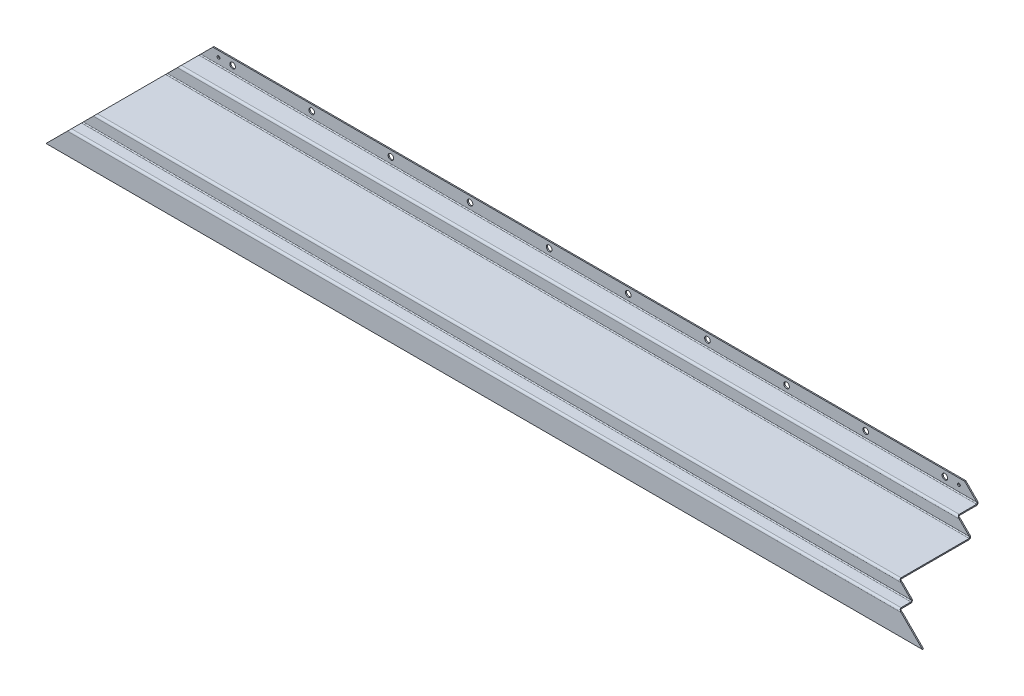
ISO-10303-21;
HEADER;
FILE_DESCRIPTION(('STEP AP214'),'2;1');
FILE_NAME('part.step','',(''),(''),'','','');
FILE_SCHEMA(('AUTOMOTIVE_DESIGN { 1 0 10303 214 1 1 1 1 }'));
ENDSEC;
DATA;
#1=APPLICATION_CONTEXT('core data for automotive mechanical design processes');
#2=APPLICATION_PROTOCOL_DEFINITION('international standard','automotive_design',2000,#1);
#3=PRODUCT_CONTEXT('',#1,'mechanical');
#4=PRODUCT('Part','Part','',(#3));
#5=PRODUCT_RELATED_PRODUCT_CATEGORY('part','',(#4));
#6=PRODUCT_DEFINITION_FORMATION('','',#4);
#7=PRODUCT_DEFINITION_CONTEXT('part definition',#1,'design');
#8=PRODUCT_DEFINITION('design','',#6,#7);
#9=PRODUCT_DEFINITION_SHAPE('','',#8);
#10=(LENGTH_UNIT() NAMED_UNIT(*) SI_UNIT(.MILLI.,.METRE.));
#11=(NAMED_UNIT(*) PLANE_ANGLE_UNIT() SI_UNIT($,.RADIAN.));
#12=(NAMED_UNIT(*) SI_UNIT($,.STERADIAN.) SOLID_ANGLE_UNIT());
#13=UNCERTAINTY_MEASURE_WITH_UNIT(LENGTH_MEASURE(1.E-05),#10,'distance_accuracy_value','');
#14=(GEOMETRIC_REPRESENTATION_CONTEXT(3) GLOBAL_UNCERTAINTY_ASSIGNED_CONTEXT((#13)) GLOBAL_UNIT_ASSIGNED_CONTEXT((#10,
#11,#12)) REPRESENTATION_CONTEXT('',''));
#15=CARTESIAN_POINT('',(0.,0.,0.));
#16=DIRECTION('',(0.,0.,1.));
#17=DIRECTION('',(1.,0.,0.));
#18=AXIS2_PLACEMENT_3D('',#15,#16,#17);
#19=CARTESIAN_POINT('',(0.,-977.2,-4.97246132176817E-12));
#20=DIRECTION('',(0.,-1.,0.));
#21=DIRECTION('',(0.,0.,-1.));
#22=AXIS2_PLACEMENT_3D('',#19,#20,#21);
#23=PLANE('',#22);
#24=DIRECTION('',(0.,0.,1.));
#25=VECTOR('',#24,1.);
#26=CARTESIAN_POINT('',(414.5,-977.199999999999,-112.601));
#27=LINE('',#26,#25);
#28=CARTESIAN_POINT('',(414.5,-977.199999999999,-110.400000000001));
#29=VERTEX_POINT('',#28);
#30=CARTESIAN_POINT('',(414.5,-977.199999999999,-91.800000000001));
#31=VERTEX_POINT('',#30);
#32=EDGE_CURVE('E658',#29,#31,#27,.T.);
#33=ORIENTED_EDGE('',*,*,#32,.F.);
#34=DIRECTION('',(-1.,0.,0.));
#35=VECTOR('',#34,1.);
#36=CARTESIAN_POINT('',(-417.,-977.199999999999,-110.400000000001));
#37=LINE('',#36,#35);
#38=CARTESIAN_POINT('',(-414.5,-977.199999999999,-110.400000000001));
#39=VERTEX_POINT('',#38);
#40=EDGE_CURVE('E372',#39,#29,#37,.F.);
#41=ORIENTED_EDGE('',*,*,#40,.F.);
#42=DIRECTION('',(0.,0.,-1.));
#43=VECTOR('',#42,1.);
#44=CARTESIAN_POINT('',(-414.5,-977.199999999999,-112.601));
#45=LINE('',#44,#43);
#46=CARTESIAN_POINT('',(-414.5,-977.199999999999,-91.800000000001));
#47=VERTEX_POINT('',#46);
#48=EDGE_CURVE('E556',#47,#39,#45,.T.);
#49=ORIENTED_EDGE('',*,*,#48,.F.);
#50=DIRECTION('',(1.,0.,0.));
#51=VECTOR('',#50,1.);
#52=CARTESIAN_POINT('',(-417.,-977.199999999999,-91.800000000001));
#53=LINE('',#52,#51);
#54=EDGE_CURVE('E392',#31,#47,#53,.F.);
#55=ORIENTED_EDGE('',*,*,#54,.F.);
#56=EDGE_LOOP('',(#33,#41,#49,#55));
#57=FACE_BOUND('',#56,.T.);
#58=ADVANCED_FACE('F161',(#57),#23,.F.);
#59=CARTESIAN_POINT('',(0.,-978.4,-4.97665109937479E-12));
#60=DIRECTION('',(0.,-1.,0.));
#61=DIRECTION('',(0.,0.,-1.));
#62=AXIS2_PLACEMENT_3D('',#59,#60,#61);
#63=PLANE('',#62);
#64=DIRECTION('',(-1.,0.,0.));
#65=VECTOR('',#64,1.);
#66=CARTESIAN_POINT('',(-417.,-978.399999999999,-110.400000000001));
#67=LINE('',#66,#65);
#68=CARTESIAN_POINT('',(-414.5,-978.399999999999,-110.400000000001));
#69=VERTEX_POINT('',#68);
#70=CARTESIAN_POINT('',(414.5,-978.399999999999,-110.400000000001));
#71=VERTEX_POINT('',#70);
#72=EDGE_CURVE('E387',#69,#71,#67,.F.);
#73=ORIENTED_EDGE('',*,*,#72,.T.);
#74=DIRECTION('',(0.,0.,-1.));
#75=VECTOR('',#74,1.);
#76=CARTESIAN_POINT('',(414.5,-978.4,-4.97857264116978E-12));
#77=LINE('',#76,#75);
#78=CARTESIAN_POINT('',(414.5,-978.399999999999,-91.800000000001));
#79=VERTEX_POINT('',#78);
#80=EDGE_CURVE('E655',#71,#79,#77,.F.);
#81=ORIENTED_EDGE('',*,*,#80,.T.);
#82=DIRECTION('',(1.,0.,0.));
#83=VECTOR('',#82,1.);
#84=CARTESIAN_POINT('',(-417.,-978.399999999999,-91.800000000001));
#85=LINE('',#84,#83);
#86=CARTESIAN_POINT('',(-414.5,-978.399999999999,-91.800000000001));
#87=VERTEX_POINT('',#86);
#88=EDGE_CURVE('E391',#87,#79,#85,.T.);
#89=ORIENTED_EDGE('',*,*,#88,.F.);
#90=DIRECTION('',(0.,0.,-1.));
#91=VECTOR('',#90,1.);
#92=CARTESIAN_POINT('',(-414.5,-978.4,-4.97857264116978E-12));
#93=LINE('',#92,#91);
#94=EDGE_CURVE('E722',#87,#69,#93,.T.);
#95=ORIENTED_EDGE('',*,*,#94,.T.);
#96=EDGE_LOOP('',(#73,#81,#89,#95));
#97=FACE_BOUND('',#96,.T.);
#98=ADVANCED_FACE('F741',(#97),#63,.T.);
#99=CARTESIAN_POINT('',(0.,0.,-90.800000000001));
#100=DIRECTION('',(0.,0.,-1.));
#101=DIRECTION('',(-1.,0.,0.));
#102=AXIS2_PLACEMENT_3D('',#99,#100,#101);
#103=PLANE('',#102);
#104=DIRECTION('',(1.,0.,0.));
#105=VECTOR('',#104,1.);
#106=CARTESIAN_POINT('',(417.,-979.399999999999,-90.800000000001));
#107=LINE('',#106,#105);
#108=CARTESIAN_POINT('',(416.7,-979.399999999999,-90.800000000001));
#109=VERTEX_POINT('',#108);
#110=CARTESIAN_POINT('',(-416.7,-979.399999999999,-90.800000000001));
#111=VERTEX_POINT('',#110);
#112=EDGE_CURVE('E395',#109,#111,#107,.F.);
#113=ORIENTED_EDGE('',*,*,#112,.F.);
#114=DIRECTION('',(0.707106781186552,-0.707106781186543,0.));
#115=VECTOR('',#114,1.);
#116=CARTESIAN_POINT('',(474.6,-1037.3,-90.800000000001));
#117=LINE('',#116,#115);
#118=CARTESIAN_POINT('',(427.300000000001,-989.999999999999,-90.800000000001));
#119=VERTEX_POINT('',#118);
#120=EDGE_CURVE('E640',#109,#119,#117,.T.);
#121=ORIENTED_EDGE('',*,*,#120,.T.);
#122=DIRECTION('',(-1.,0.,0.));
#123=VECTOR('',#122,1.);
#124=CARTESIAN_POINT('',(0.,-989.999999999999,-90.800000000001));
#125=LINE('',#124,#123);
#126=CARTESIAN_POINT('',(-427.3,-989.999999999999,-90.800000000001));
#127=VERTEX_POINT('',#126);
#128=EDGE_CURVE('E404',#119,#127,#125,.T.);
#129=ORIENTED_EDGE('',*,*,#128,.T.);
#130=DIRECTION('',(0.707106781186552,0.707106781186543,0.));
#131=VECTOR('',#130,1.);
#132=CARTESIAN_POINT('',(-474.6,-1037.3,-90.800000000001));
#133=LINE('',#132,#131);
#134=EDGE_CURVE('E607',#127,#111,#133,.T.);
#135=ORIENTED_EDGE('',*,*,#134,.T.);
#136=EDGE_LOOP('',(#113,#121,#129,#135));
#137=FACE_BOUND('',#136,.T.);
#138=ADVANCED_FACE('F752',(#137),#103,.T.);
#139=CARTESIAN_POINT('',(0.,0.,-89.600000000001));
#140=DIRECTION('',(0.,0.,-1.));
#141=DIRECTION('',(-1.,0.,0.));
#142=AXIS2_PLACEMENT_3D('',#139,#140,#141);
#143=PLANE('',#142);
#144=DIRECTION('',(0.707106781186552,-0.707106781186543,0.));
#145=VECTOR('',#144,1.);
#146=CARTESIAN_POINT('',(474.6,-1037.3,-89.600000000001));
#147=LINE('',#146,#145);
#148=CARTESIAN_POINT('',(416.7,-979.399999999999,-89.600000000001));
#149=VERTEX_POINT('',#148);
#150=CARTESIAN_POINT('',(427.300000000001,-989.999999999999,-89.600000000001));
#151=VERTEX_POINT('',#150);
#152=EDGE_CURVE('E636',#149,#151,#147,.T.);
#153=ORIENTED_EDGE('',*,*,#152,.F.);
#154=DIRECTION('',(1.,0.,0.));
#155=VECTOR('',#154,1.);
#156=CARTESIAN_POINT('',(417.,-979.399999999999,-89.600000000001));
#157=LINE('',#156,#155);
#158=CARTESIAN_POINT('',(-416.7,-979.399999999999,-89.600000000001));
#159=VERTEX_POINT('',#158);
#160=EDGE_CURVE('E398',#149,#159,#157,.F.);
#161=ORIENTED_EDGE('',*,*,#160,.T.);
#162=DIRECTION('',(0.707106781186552,0.707106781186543,0.));
#163=VECTOR('',#162,1.);
#164=CARTESIAN_POINT('',(-474.6,-1037.3,-89.600000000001));
#165=LINE('',#164,#163);
#166=CARTESIAN_POINT('',(-427.3,-989.999999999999,-89.600000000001));
#167=VERTEX_POINT('',#166);
#168=EDGE_CURVE('E605',#167,#159,#165,.T.);
#169=ORIENTED_EDGE('',*,*,#168,.F.);
#170=DIRECTION('',(1.,0.,0.));
#171=VECTOR('',#170,1.);
#172=CARTESIAN_POINT('',(429.8,-989.999999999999,-89.600000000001));
#173=LINE('',#172,#171);
#174=EDGE_CURVE('E401',#151,#167,#173,.F.);
#175=ORIENTED_EDGE('',*,*,#174,.F.);
#176=EDGE_LOOP('',(#153,#161,#169,#175));
#177=FACE_BOUND('',#176,.T.);
#178=ADVANCED_FACE('F633',(#177),#143,.F.);
#179=CARTESIAN_POINT('',(0.,-991.,-2.89879443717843E-12));
#180=DIRECTION('',(0.,-1.,0.));
#181=DIRECTION('',(0.,0.,-1.));
#182=AXIS2_PLACEMENT_3D('',#179,#180,#181);
#183=PLANE('',#182);
#184=DIRECTION('',(0.,0.,1.));
#185=VECTOR('',#184,1.);
#186=CARTESIAN_POINT('',(428.3,-990.999999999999,-112.601000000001));
#187=LINE('',#186,#185);
#188=CARTESIAN_POINT('',(428.300000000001,-990.999999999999,-88.600000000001));
#189=VERTEX_POINT('',#188);
#190=CARTESIAN_POINT('',(428.300000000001,-991.,-16.000000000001));
#191=VERTEX_POINT('',#190);
#192=EDGE_CURVE('E653',#189,#191,#187,.T.);
#193=ORIENTED_EDGE('',*,*,#192,.F.);
#194=DIRECTION('',(-1.,0.,0.));
#195=VECTOR('',#194,1.);
#196=CARTESIAN_POINT('',(-430.8,-990.999999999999,-88.600000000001));
#197=LINE('',#196,#195);
#198=CARTESIAN_POINT('',(-428.3,-990.999999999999,-88.600000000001));
#199=VERTEX_POINT('',#198);
#200=EDGE_CURVE('E407',#199,#189,#197,.F.);
#201=ORIENTED_EDGE('',*,*,#200,.F.);
#202=DIRECTION('',(0.,0.,-1.));
#203=VECTOR('',#202,1.);
#204=CARTESIAN_POINT('',(-428.3,-990.999999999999,-112.601000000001));
#205=LINE('',#204,#203);
#206=CARTESIAN_POINT('',(-428.300000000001,-991.,-16.000000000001));
#207=VERTEX_POINT('',#206);
#208=EDGE_CURVE('E598',#207,#199,#205,.T.);
#209=ORIENTED_EDGE('',*,*,#208,.F.);
#210=DIRECTION('',(1.,0.,0.));
#211=VECTOR('',#210,1.);
#212=CARTESIAN_POINT('',(-430.8,-991.,-16.000000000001));
#213=LINE('',#212,#211);
#214=EDGE_CURVE('E416',#191,#207,#213,.F.);
#215=ORIENTED_EDGE('',*,*,#214,.F.);
#216=EDGE_LOOP('',(#193,#201,#209,#215));
#217=FACE_BOUND('',#216,.T.);
#218=ADVANCED_FACE('F852',(#217),#183,.F.);
#219=CARTESIAN_POINT('',(0.,-992.199999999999,-2.90298421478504E-12));
#220=DIRECTION('',(0.,-1.,0.));
#221=DIRECTION('',(0.,0.,-1.));
#222=AXIS2_PLACEMENT_3D('',#219,#220,#221);
#223=PLANE('',#222);
#224=DIRECTION('',(-1.,0.,0.));
#225=VECTOR('',#224,1.);
#226=CARTESIAN_POINT('',(-430.8,-992.199999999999,-88.600000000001));
#227=LINE('',#226,#225);
#228=CARTESIAN_POINT('',(-428.3,-992.199999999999,-88.600000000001));
#229=VERTEX_POINT('',#228);
#230=CARTESIAN_POINT('',(428.300000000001,-992.199999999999,-88.600000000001));
#231=VERTEX_POINT('',#230);
#232=EDGE_CURVE('E412',#229,#231,#227,.F.);
#233=ORIENTED_EDGE('',*,*,#232,.T.);
#234=DIRECTION('',(0.,0.,-1.));
#235=VECTOR('',#234,1.);
#236=CARTESIAN_POINT('',(428.300000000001,-992.199999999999,-2.90230965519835E-12));
#237=LINE('',#236,#235);
#238=CARTESIAN_POINT('',(428.300000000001,-992.199999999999,-16.000000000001));
#239=VERTEX_POINT('',#238);
#240=EDGE_CURVE('E712',#231,#239,#237,.F.);
#241=ORIENTED_EDGE('',*,*,#240,.T.);
#242=DIRECTION('',(1.,0.,0.));
#243=VECTOR('',#242,1.);
#244=CARTESIAN_POINT('',(-430.8,-992.199999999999,-16.000000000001));
#245=LINE('',#244,#243);
#246=CARTESIAN_POINT('',(-428.300000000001,-992.199999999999,-16.000000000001));
#247=VERTEX_POINT('',#246);
#248=EDGE_CURVE('E415',#247,#239,#245,.T.);
#249=ORIENTED_EDGE('',*,*,#248,.F.);
#250=DIRECTION('',(0.,0.,-1.));
#251=VECTOR('',#250,1.);
#252=CARTESIAN_POINT('',(-428.300000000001,-992.199999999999,-2.90230965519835E-12));
#253=LINE('',#252,#251);
#254=EDGE_CURVE('E594',#247,#229,#253,.T.);
#255=ORIENTED_EDGE('',*,*,#254,.T.);
#256=EDGE_LOOP('',(#233,#241,#249,#255));
#257=FACE_BOUND('',#256,.T.);
#258=ADVANCED_FACE('F765',(#257),#223,.T.);
#259=CARTESIAN_POINT('',(0.,0.,-15.000000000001));
#260=DIRECTION('',(0.,0.,-1.));
#261=DIRECTION('',(-1.,0.,0.));
#262=AXIS2_PLACEMENT_3D('',#259,#260,#261);
#263=PLANE('',#262);
#264=DIRECTION('',(1.,0.,0.));
#265=VECTOR('',#264,1.);
#266=CARTESIAN_POINT('',(430.8,-993.199999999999,-15.000000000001));
#267=LINE('',#266,#265);
#268=CARTESIAN_POINT('',(430.500000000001,-993.199999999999,-15.000000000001));
#269=VERTEX_POINT('',#268);
#270=CARTESIAN_POINT('',(-430.500000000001,-993.199999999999,-15.000000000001));
#271=VERTEX_POINT('',#270);
#272=EDGE_CURVE('E419',#269,#271,#267,.F.);
#273=ORIENTED_EDGE('',*,*,#272,.F.);
#274=DIRECTION('',(0.707106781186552,-0.707106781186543,0.));
#275=VECTOR('',#274,1.);
#276=CARTESIAN_POINT('',(474.6,-1037.3,-15.000000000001));
#277=LINE('',#276,#275);
#278=CARTESIAN_POINT('',(441.100000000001,-1003.8,-15.000000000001));
#279=VERTEX_POINT('',#278);
#280=EDGE_CURVE('E700',#269,#279,#277,.T.);
#281=ORIENTED_EDGE('',*,*,#280,.T.);
#282=DIRECTION('',(-1.,0.,0.));
#283=VECTOR('',#282,1.);
#284=CARTESIAN_POINT('',(0.,-1003.8,-15.000000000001));
#285=LINE('',#284,#283);
#286=CARTESIAN_POINT('',(-441.100000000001,-1003.8,-15.000000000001));
#287=VERTEX_POINT('',#286);
#288=EDGE_CURVE('E428',#279,#287,#285,.T.);
#289=ORIENTED_EDGE('',*,*,#288,.T.);
#290=DIRECTION('',(0.707106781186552,0.707106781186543,0.));
#291=VECTOR('',#290,1.);
#292=CARTESIAN_POINT('',(-474.6,-1037.3,-15.000000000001));
#293=LINE('',#292,#291);
#294=EDGE_CURVE('E587',#287,#271,#293,.T.);
#295=ORIENTED_EDGE('',*,*,#294,.T.);
#296=EDGE_LOOP('',(#273,#281,#289,#295));
#297=FACE_BOUND('',#296,.T.);
#298=ADVANCED_FACE('F781',(#297),#263,.T.);
#299=CARTESIAN_POINT('',(0.,0.,-13.800000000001));
#300=DIRECTION('',(0.,0.,-1.));
#301=DIRECTION('',(-1.,0.,0.));
#302=AXIS2_PLACEMENT_3D('',#299,#300,#301);
#303=PLANE('',#302);
#304=DIRECTION('',(0.707106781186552,-0.707106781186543,0.));
#305=VECTOR('',#304,1.);
#306=CARTESIAN_POINT('',(474.6,-1037.3,-13.800000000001));
#307=LINE('',#306,#305);
#308=CARTESIAN_POINT('',(430.500000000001,-993.199999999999,-13.800000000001));
#309=VERTEX_POINT('',#308);
#310=CARTESIAN_POINT('',(441.100000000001,-1003.8,-13.800000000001));
#311=VERTEX_POINT('',#310);
#312=EDGE_CURVE('E704',#309,#311,#307,.T.);
#313=ORIENTED_EDGE('',*,*,#312,.F.);
#314=DIRECTION('',(1.,0.,0.));
#315=VECTOR('',#314,1.);
#316=CARTESIAN_POINT('',(430.8,-993.199999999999,-13.800000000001));
#317=LINE('',#316,#315);
#318=CARTESIAN_POINT('',(-430.500000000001,-993.199999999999,-13.800000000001));
#319=VERTEX_POINT('',#318);
#320=EDGE_CURVE('E422',#309,#319,#317,.F.);
#321=ORIENTED_EDGE('',*,*,#320,.T.);
#322=DIRECTION('',(0.707106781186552,0.707106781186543,0.));
#323=VECTOR('',#322,1.);
#324=CARTESIAN_POINT('',(-474.6,-1037.3,-13.800000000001));
#325=LINE('',#324,#323);
#326=CARTESIAN_POINT('',(-441.100000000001,-1003.8,-13.800000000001));
#327=VERTEX_POINT('',#326);
#328=EDGE_CURVE('E584',#327,#319,#325,.T.);
#329=ORIENTED_EDGE('',*,*,#328,.F.);
#330=DIRECTION('',(1.,0.,0.));
#331=VECTOR('',#330,1.);
#332=CARTESIAN_POINT('',(443.6,-1003.8,-13.800000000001));
#333=LINE('',#332,#331);
#334=EDGE_CURVE('E425',#311,#327,#333,.F.);
#335=ORIENTED_EDGE('',*,*,#334,.F.);
#336=EDGE_LOOP('',(#313,#321,#329,#335));
#337=FACE_BOUND('',#336,.T.);
#338=ADVANCED_FACE('F872',(#337),#303,.F.);
#339=CARTESIAN_POINT('',(0.,-1004.8,0.));
#340=DIRECTION('',(0.,1.,0.));
#341=DIRECTION('',(0.,0.,1.));
#342=AXIS2_PLACEMENT_3D('',#339,#340,#341);
#343=PLANE('',#342);
#344=DIRECTION('',(1.,0.,0.));
#345=VECTOR('',#344,1.);
#346=CARTESIAN_POINT('',(0.,-1004.8,-2.19999999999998));
#347=LINE('',#346,#345);
#348=CARTESIAN_POINT('',(-442.100000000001,-1004.8,-2.19999999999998));
#349=VERTEX_POINT('',#348);
#350=CARTESIAN_POINT('',(442.100000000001,-1004.8,-2.19999999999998));
#351=VERTEX_POINT('',#350);
#352=EDGE_CURVE('E440',#349,#351,#347,.T.);
#353=ORIENTED_EDGE('',*,*,#352,.T.);
#354=DIRECTION('',(0.,0.,-1.));
#355=VECTOR('',#354,1.);
#356=CARTESIAN_POINT('',(442.100000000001,-1004.8,-112.601000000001));
#357=LINE('',#356,#355);
#358=CARTESIAN_POINT('',(442.100000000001,-1004.8,-12.800000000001));
#359=VERTEX_POINT('',#358);
#360=EDGE_CURVE('E692',#351,#359,#357,.T.);
#361=ORIENTED_EDGE('',*,*,#360,.T.);
#362=DIRECTION('',(-1.,0.,0.));
#363=VECTOR('',#362,1.);
#364=CARTESIAN_POINT('',(-444.6,-1004.8,-12.800000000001));
#365=LINE('',#364,#363);
#366=CARTESIAN_POINT('',(-442.100000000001,-1004.8,-12.800000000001));
#367=VERTEX_POINT('',#366);
#368=EDGE_CURVE('E431',#367,#359,#365,.F.);
#369=ORIENTED_EDGE('',*,*,#368,.F.);
#370=DIRECTION('',(0.,0.,1.));
#371=VECTOR('',#370,1.);
#372=CARTESIAN_POINT('',(-442.100000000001,-1004.8,-112.601000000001));
#373=LINE('',#372,#371);
#374=EDGE_CURVE('E576',#367,#349,#373,.T.);
#375=ORIENTED_EDGE('',*,*,#374,.T.);
#376=EDGE_LOOP('',(#353,#361,#369,#375));
#377=FACE_BOUND('',#376,.T.);
#378=ADVANCED_FACE('F875',(#377),#343,.T.);
#379=CARTESIAN_POINT('',(0.,-1006.,0.));
#380=DIRECTION('',(0.,1.,0.));
#381=DIRECTION('',(0.,0.,1.));
#382=AXIS2_PLACEMENT_3D('',#379,#380,#381);
#383=PLANE('',#382);
#384=DIRECTION('',(0.,0.,1.));
#385=VECTOR('',#384,1.);
#386=CARTESIAN_POINT('',(442.100000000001,-1006.,0.));
#387=LINE('',#386,#385);
#388=CARTESIAN_POINT('',(442.100000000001,-1006.,-2.19999999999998));
#389=VERTEX_POINT('',#388);
#390=CARTESIAN_POINT('',(442.100000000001,-1006.,-12.800000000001));
#391=VERTEX_POINT('',#390);
#392=EDGE_CURVE('E689',#389,#391,#387,.F.);
#393=ORIENTED_EDGE('',*,*,#392,.F.);
#394=DIRECTION('',(-1.,0.,0.));
#395=VECTOR('',#394,1.);
#396=CARTESIAN_POINT('',(-444.6,-1006.,-2.19999999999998));
#397=LINE('',#396,#395);
#398=CARTESIAN_POINT('',(-442.100000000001,-1006.,-2.19999999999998));
#399=VERTEX_POINT('',#398);
#400=EDGE_CURVE('E439',#399,#389,#397,.F.);
#401=ORIENTED_EDGE('',*,*,#400,.F.);
#402=DIRECTION('',(0.,0.,1.));
#403=VECTOR('',#402,1.);
#404=CARTESIAN_POINT('',(-442.100000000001,-1006.,0.));
#405=LINE('',#404,#403);
#406=CARTESIAN_POINT('',(-442.100000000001,-1006.,-12.800000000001));
#407=VERTEX_POINT('',#406);
#408=EDGE_CURVE('E573',#407,#399,#405,.T.);
#409=ORIENTED_EDGE('',*,*,#408,.F.);
#410=DIRECTION('',(-1.,0.,0.));
#411=VECTOR('',#410,1.);
#412=CARTESIAN_POINT('',(-444.6,-1006.,-12.800000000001));
#413=LINE('',#412,#411);
#414=EDGE_CURVE('E436',#407,#391,#413,.F.);
#415=ORIENTED_EDGE('',*,*,#414,.T.);
#416=EDGE_LOOP('',(#393,#401,#409,#415));
#417=FACE_BOUND('',#416,.T.);
#418=ADVANCED_FACE('F799',(#417),#383,.F.);
#419=CARTESIAN_POINT('',(0.,0.,-1.2));
#420=DIRECTION('',(0.,0.,1.));
#421=DIRECTION('',(1.,0.,0.));
#422=AXIS2_PLACEMENT_3D('',#419,#420,#421);
#423=PLANE('',#422);
#424=DIRECTION('',(-0.707106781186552,0.707106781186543,0.));
#425=VECTOR('',#424,1.);
#426=CARTESIAN_POINT('',(474.6,-1037.3,-1.20000000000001));
#427=LINE('',#426,#425);
#428=CARTESIAN_POINT('',(467.100000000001,-1029.8,-1.20000000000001));
#429=VERTEX_POINT('',#428);
#430=CARTESIAN_POINT('',(444.300000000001,-1007.,-1.20000000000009));
#431=VERTEX_POINT('',#430);
#432=EDGE_CURVE('E463',#429,#431,#427,.T.);
#433=ORIENTED_EDGE('',*,*,#432,.F.);
#434=DIRECTION('',(1.,0.,0.));
#435=VECTOR('',#434,1.);
#436=CARTESIAN_POINT('',(-469.6,-1029.8,-1.2));
#437=LINE('',#436,#435);
#438=CARTESIAN_POINT('',(-467.100000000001,-1029.8,-1.2));
#439=VERTEX_POINT('',#438);
#440=EDGE_CURVE('E13',#439,#429,#437,.T.);
#441=ORIENTED_EDGE('',*,*,#440,.F.);
#442=DIRECTION('',(0.707106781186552,0.707106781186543,0.));
#443=VECTOR('',#442,1.);
#444=CARTESIAN_POINT('',(-474.6,-1037.3,-1.2));
#445=LINE('',#444,#443);
#446=CARTESIAN_POINT('',(-444.300000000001,-1007.,-1.20000000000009));
#447=VERTEX_POINT('',#446);
#448=EDGE_CURVE('E464',#439,#447,#445,.T.);
#449=ORIENTED_EDGE('',*,*,#448,.T.);
#450=DIRECTION('',(1.,0.,0.));
#451=VECTOR('',#450,1.);
#452=CARTESIAN_POINT('',(444.6,-1007.,-1.20000000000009));
#453=LINE('',#452,#451);
#454=EDGE_CURVE('E443',#431,#447,#453,.F.);
#455=ORIENTED_EDGE('',*,*,#454,.F.);
#456=EDGE_LOOP('',(#433,#441,#449,#455));
#457=FACE_BOUND('',#456,.T.);
#458=ADVANCED_FACE('F460',(#457),#423,.F.);
#459=CARTESIAN_POINT('',(0.,0.,0.));
#460=DIRECTION('',(0.,0.,1.));
#461=DIRECTION('',(1.,0.,0.));
#462=AXIS2_PLACEMENT_3D('',#459,#460,#461);
#463=PLANE('',#462);
#464=DIRECTION('',(1.,0.,0.));
#465=VECTOR('',#464,1.);
#466=CARTESIAN_POINT('',(-469.6,-1029.8,0.));
#467=LINE('',#466,#465);
#468=CARTESIAN_POINT('',(-467.100000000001,-1029.8,0.));
#469=VERTEX_POINT('',#468);
#470=CARTESIAN_POINT('',(467.100000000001,-1029.8,0.));
#471=VERTEX_POINT('',#470);
#472=EDGE_CURVE('E165',#469,#471,#467,.T.);
#473=ORIENTED_EDGE('',*,*,#472,.T.);
#474=DIRECTION('',(-0.707106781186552,0.707106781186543,0.));
#475=VECTOR('',#474,1.);
#476=CARTESIAN_POINT('',(474.6,-1037.3,0.));
#477=LINE('',#476,#475);
#478=CARTESIAN_POINT('',(444.300000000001,-1007.,0.));
#479=VERTEX_POINT('',#478);
#480=EDGE_CURVE('E679',#471,#479,#477,.T.);
#481=ORIENTED_EDGE('',*,*,#480,.T.);
#482=DIRECTION('',(1.,0.,0.));
#483=VECTOR('',#482,1.);
#484=CARTESIAN_POINT('',(444.6,-1007.,0.));
#485=LINE('',#484,#483);
#486=CARTESIAN_POINT('',(-444.300000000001,-1007.,0.));
#487=VERTEX_POINT('',#486);
#488=EDGE_CURVE('E446',#479,#487,#485,.F.);
#489=ORIENTED_EDGE('',*,*,#488,.T.);
#490=DIRECTION('',(0.707106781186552,0.707106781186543,0.));
#491=VECTOR('',#490,1.);
#492=CARTESIAN_POINT('',(-474.6,-1037.3,0.));
#493=LINE('',#492,#491);
#494=EDGE_CURVE('E469',#469,#487,#493,.T.);
#495=ORIENTED_EDGE('',*,*,#494,.F.);
#496=EDGE_LOOP('',(#473,#481,#489,#495));
#497=FACE_BOUND('',#496,.T.);
#498=ADVANCED_FACE('F814',(#497),#463,.T.);
#499=CARTESIAN_POINT('',(-469.6,-1029.8,-1.2));
#500=DIRECTION('',(0.,-1.,0.));
#501=DIRECTION('',(0.,0.,-1.));
#502=AXIS2_PLACEMENT_3D('',#499,#500,#501);
#503=PLANE('',#502);
#504=ORIENTED_EDGE('',*,*,#440,.T.);
#505=DIRECTION('',(0.,0.,-1.));
#506=VECTOR('',#505,1.);
#507=CARTESIAN_POINT('',(467.100000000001,-1029.8,-1.20000000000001));
#508=LINE('',#507,#506);
#509=EDGE_CURVE('E678',#429,#471,#508,.F.);
#510=ORIENTED_EDGE('',*,*,#509,.T.);
#511=ORIENTED_EDGE('',*,*,#472,.F.);
#512=DIRECTION('',(0.,0.,1.));
#513=VECTOR('',#512,1.);
#514=CARTESIAN_POINT('',(-467.100000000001,-1029.8,0.));
#515=LINE('',#514,#513);
#516=EDGE_CURVE('E468',#469,#439,#515,.F.);
#517=ORIENTED_EDGE('',*,*,#516,.T.);
#518=EDGE_LOOP('',(#504,#510,#511,#517));
#519=FACE_BOUND('',#518,.T.);
#520=ADVANCED_FACE('F163',(#519),#503,.T.);
#521=CARTESIAN_POINT('',(444.6,-1007.,-2.19999999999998));
#522=DIRECTION('',(1.,0.,0.));
#523=DIRECTION('',(0.,1.,0.));
#524=AXIS2_PLACEMENT_3D('',#521,#522,#523);
#525=CYLINDRICAL_SURFACE('',#524,2.19999999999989);
#526=ORIENTED_EDGE('',*,*,#488,.F.);
#527=CARTESIAN_POINT('',(444.300000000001,-1007.,-2.19999999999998));
#528=DIRECTION('',(-0.707106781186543,-0.707106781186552,0.));
#529=DIRECTION('',(0.707106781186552,-0.707106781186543,0.));
#530=AXIS2_PLACEMENT_3D('',#527,#528,#529);
#531=ELLIPSE('',#530,3.11126983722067,2.19999999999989);
#532=EDGE_CURVE('E1763',#479,#351,#531,.T.);
#533=ORIENTED_EDGE('',*,*,#532,.T.);
#534=ORIENTED_EDGE('',*,*,#352,.F.);
#535=CARTESIAN_POINT('',(-444.300000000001,-1007.,-2.19999999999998));
#536=DIRECTION('',(0.707106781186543,-0.707106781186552,0.));
#537=DIRECTION('',(0.707106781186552,0.707106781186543,0.));
#538=AXIS2_PLACEMENT_3D('',#535,#536,#537);
#539=ELLIPSE('',#538,3.11126983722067,2.19999999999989);
#540=EDGE_CURVE('E563',#349,#487,#539,.T.);
#541=ORIENTED_EDGE('',*,*,#540,.T.);
#542=EDGE_LOOP('',(#526,#533,#534,#541));
#543=FACE_BOUND('',#542,.T.);
#544=ADVANCED_FACE('F809',(#543),#525,.T.);
#545=CARTESIAN_POINT('',(444.6,-1007.,-2.19999999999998));
#546=DIRECTION('',(1.,0.,0.));
#547=DIRECTION('',(0.,1.,0.));
#548=AXIS2_PLACEMENT_3D('',#545,#546,#547);
#549=CYLINDRICAL_SURFACE('',#548,0.99999999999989);
#550=CARTESIAN_POINT('',(444.300000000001,-1007.,-2.19999999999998));
#551=DIRECTION('',(-0.413802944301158,-0.910366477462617,0.));
#552=DIRECTION('',(0.910366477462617,-0.413802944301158,0.));
#553=AXIS2_PLACEMENT_3D('',#550,#551,#552);
#554=ELLIPSE('',#553,2.4166091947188,0.99999999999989);
#555=EDGE_CURVE('E363',#431,#389,#554,.T.);
#556=ORIENTED_EDGE('',*,*,#555,.F.);
#557=ORIENTED_EDGE('',*,*,#454,.T.);
#558=CARTESIAN_POINT('',(-444.300000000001,-1007.,-2.19999999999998));
#559=DIRECTION('',(0.413802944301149,-0.91036647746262,0.));
#560=DIRECTION('',(0.91036647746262,0.413802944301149,0.));
#561=AXIS2_PLACEMENT_3D('',#558,#559,#560);
#562=ELLIPSE('',#561,2.41660919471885,0.99999999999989);
#563=EDGE_CURVE('E455',#399,#447,#562,.T.);
#564=ORIENTED_EDGE('',*,*,#563,.F.);
#565=ORIENTED_EDGE('',*,*,#400,.T.);
#566=EDGE_LOOP('',(#556,#557,#564,#565));
#567=FACE_BOUND('',#566,.T.);
#568=ADVANCED_FACE('F454',(#567),#549,.F.);
#569=CARTESIAN_POINT('',(-444.6,-1003.8,-12.800000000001));
#570=DIRECTION('',(-1.,0.,0.));
#571=DIRECTION('',(0.,0.,-1.));
#572=AXIS2_PLACEMENT_3D('',#569,#570,#571);
#573=CYLINDRICAL_SURFACE('',#572,2.20000000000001);
#574=ORIENTED_EDGE('',*,*,#288,.F.);
#575=CARTESIAN_POINT('',(441.100000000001,-1003.8,-12.800000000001));
#576=DIRECTION('',(-0.910366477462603,-0.413802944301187,0.));
#577=DIRECTION('',(-0.413802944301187,0.910366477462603,0.));
#578=AXIS2_PLACEMENT_3D('',#575,#576,#577);
#579=ELLIPSE('',#578,2.4166091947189,2.20000000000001);
#580=EDGE_CURVE('E795',#279,#391,#579,.T.);
#581=ORIENTED_EDGE('',*,*,#580,.T.);
#582=ORIENTED_EDGE('',*,*,#414,.F.);
#583=CARTESIAN_POINT('',(-441.100000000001,-1003.8,-12.800000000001));
#584=DIRECTION('',(0.910366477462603,-0.413802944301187,0.));
#585=DIRECTION('',(-0.413802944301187,-0.910366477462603,0.));
#586=AXIS2_PLACEMENT_3D('',#583,#584,#585);
#587=ELLIPSE('',#586,2.4166091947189,2.20000000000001);
#588=EDGE_CURVE('E566',#407,#287,#587,.T.);
#589=ORIENTED_EDGE('',*,*,#588,.T.);
#590=EDGE_LOOP('',(#574,#581,#582,#589));
#591=FACE_BOUND('',#590,.T.);
#592=ADVANCED_FACE('F793',(#591),#573,.T.);
#593=CARTESIAN_POINT('',(-444.6,-1003.8,-12.800000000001));
#594=DIRECTION('',(-1.,0.,0.));
#595=DIRECTION('',(0.,0.,-1.));
#596=AXIS2_PLACEMENT_3D('',#593,#594,#595);
#597=CYLINDRICAL_SURFACE('',#596,1.00000000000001);
#598=CARTESIAN_POINT('',(441.100000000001,-1003.8,-12.800000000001));
#599=DIRECTION('',(-0.707106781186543,-0.707106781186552,0.));
#600=DIRECTION('',(-0.707106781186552,0.707106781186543,0.));
#601=AXIS2_PLACEMENT_3D('',#598,#599,#600);
#602=ELLIPSE('',#601,1.41421356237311,1.00000000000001);
#603=EDGE_CURVE('E1764',#311,#359,#602,.T.);
#604=ORIENTED_EDGE('',*,*,#603,.F.);
#605=ORIENTED_EDGE('',*,*,#334,.T.);
#606=CARTESIAN_POINT('',(-441.100000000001,-1003.8,-12.800000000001));
#607=DIRECTION('',(0.707106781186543,-0.707106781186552,0.));
#608=DIRECTION('',(-0.707106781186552,-0.707106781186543,0.));
#609=AXIS2_PLACEMENT_3D('',#606,#607,#608);
#610=ELLIPSE('',#609,1.41421356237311,1.00000000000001);
#611=EDGE_CURVE('E569',#367,#327,#610,.T.);
#612=ORIENTED_EDGE('',*,*,#611,.F.);
#613=ORIENTED_EDGE('',*,*,#368,.T.);
#614=EDGE_LOOP('',(#604,#605,#612,#613));
#615=FACE_BOUND('',#614,.T.);
#616=ADVANCED_FACE('F866',(#615),#597,.F.);
#617=CARTESIAN_POINT('',(430.8,-993.199999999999,-16.000000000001));
#618=DIRECTION('',(1.,0.,0.));
#619=DIRECTION('',(0.,1.,0.));
#620=AXIS2_PLACEMENT_3D('',#617,#618,#619);
#621=CYLINDRICAL_SURFACE('',#620,2.2);
#622=ORIENTED_EDGE('',*,*,#320,.F.);
#623=CARTESIAN_POINT('',(430.500000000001,-993.199999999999,-16.000000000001));
#624=DIRECTION('',(-0.707106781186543,-0.707106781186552,0.));
#625=DIRECTION('',(0.707106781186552,-0.707106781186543,0.));
#626=AXIS2_PLACEMENT_3D('',#623,#624,#625);
#627=ELLIPSE('',#626,3.11126983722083,2.2);
#628=EDGE_CURVE('E1770',#309,#191,#627,.T.);
#629=ORIENTED_EDGE('',*,*,#628,.T.);
#630=ORIENTED_EDGE('',*,*,#214,.T.);
#631=CARTESIAN_POINT('',(-430.500000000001,-993.199999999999,-16.000000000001));
#632=DIRECTION('',(0.707106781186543,-0.707106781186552,0.));
#633=DIRECTION('',(0.707106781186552,0.707106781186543,0.));
#634=AXIS2_PLACEMENT_3D('',#631,#632,#633);
#635=ELLIPSE('',#634,3.11126983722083,2.2);
#636=EDGE_CURVE('E664',#207,#319,#635,.T.);
#637=ORIENTED_EDGE('',*,*,#636,.T.);
#638=EDGE_LOOP('',(#622,#629,#630,#637));
#639=FACE_BOUND('',#638,.T.);
#640=ADVANCED_FACE('F863',(#639),#621,.T.);
#641=CARTESIAN_POINT('',(430.8,-993.199999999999,-16.000000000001));
#642=DIRECTION('',(1.,0.,0.));
#643=DIRECTION('',(0.,1.,0.));
#644=AXIS2_PLACEMENT_3D('',#641,#642,#643);
#645=CYLINDRICAL_SURFACE('',#644,1.);
#646=CARTESIAN_POINT('',(430.500000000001,-993.199999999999,-16.000000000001));
#647=DIRECTION('',(-0.413802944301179,-0.910366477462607,0.));
#648=DIRECTION('',(0.910366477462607,-0.413802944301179,0.));
#649=AXIS2_PLACEMENT_3D('',#646,#647,#648);
#650=ELLIPSE('',#649,2.41660919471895,1.);
#651=EDGE_CURVE('E779',#269,#239,#650,.T.);
#652=ORIENTED_EDGE('',*,*,#651,.F.);
#653=ORIENTED_EDGE('',*,*,#272,.T.);
#654=CARTESIAN_POINT('',(-430.500000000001,-993.199999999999,-16.000000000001));
#655=DIRECTION('',(0.413802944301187,-0.910366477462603,0.));
#656=DIRECTION('',(0.910366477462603,0.413802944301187,0.));
#657=AXIS2_PLACEMENT_3D('',#654,#655,#656);
#658=ELLIPSE('',#657,2.4166091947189,1.);
#659=EDGE_CURVE('E572',#247,#271,#658,.T.);
#660=ORIENTED_EDGE('',*,*,#659,.F.);
#661=ORIENTED_EDGE('',*,*,#248,.T.);
#662=EDGE_LOOP('',(#652,#653,#660,#661));
#663=FACE_BOUND('',#662,.T.);
#664=ADVANCED_FACE('F777',(#663),#645,.F.);
#665=CARTESIAN_POINT('',(-430.8,-989.999999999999,-88.600000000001));
#666=DIRECTION('',(-1.,0.,0.));
#667=DIRECTION('',(0.,0.,-1.));
#668=AXIS2_PLACEMENT_3D('',#665,#666,#667);
#669=CYLINDRICAL_SURFACE('',#668,2.2);
#670=ORIENTED_EDGE('',*,*,#128,.F.);
#671=CARTESIAN_POINT('',(427.3,-989.999999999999,-88.600000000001));
#672=DIRECTION('',(-0.910366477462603,-0.413802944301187,0.));
#673=DIRECTION('',(-0.413802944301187,0.910366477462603,0.));
#674=AXIS2_PLACEMENT_3D('',#671,#672,#673);
#675=ELLIPSE('',#674,2.4166091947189,2.2);
#676=EDGE_CURVE('E763',#119,#231,#675,.T.);
#677=ORIENTED_EDGE('',*,*,#676,.T.);
#678=ORIENTED_EDGE('',*,*,#232,.F.);
#679=CARTESIAN_POINT('',(-427.3,-989.999999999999,-88.600000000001));
#680=DIRECTION('',(0.910366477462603,-0.413802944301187,0.));
#681=DIRECTION('',(-0.413802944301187,-0.910366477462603,0.));
#682=AXIS2_PLACEMENT_3D('',#679,#680,#681);
#683=ELLIPSE('',#682,2.4166091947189,2.2);
#684=EDGE_CURVE('E667',#229,#127,#683,.T.);
#685=ORIENTED_EDGE('',*,*,#684,.T.);
#686=EDGE_LOOP('',(#670,#677,#678,#685));
#687=FACE_BOUND('',#686,.T.);
#688=ADVANCED_FACE('F761',(#687),#669,.T.);
#689=CARTESIAN_POINT('',(-430.8,-989.999999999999,-88.600000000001));
#690=DIRECTION('',(-1.,0.,0.));
#691=DIRECTION('',(0.,0.,-1.));
#692=AXIS2_PLACEMENT_3D('',#689,#690,#691);
#693=CYLINDRICAL_SURFACE('',#692,1.);
#694=CARTESIAN_POINT('',(427.3,-989.999999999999,-88.600000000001));
#695=DIRECTION('',(-0.707106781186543,-0.707106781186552,0.));
#696=DIRECTION('',(-0.707106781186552,0.707106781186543,0.));
#697=AXIS2_PLACEMENT_3D('',#694,#695,#696);
#698=ELLIPSE('',#697,1.4142135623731,1.);
#699=EDGE_CURVE('E1755',#151,#189,#698,.T.);
#700=ORIENTED_EDGE('',*,*,#699,.F.);
#701=ORIENTED_EDGE('',*,*,#174,.T.);
#702=CARTESIAN_POINT('',(-427.3,-989.999999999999,-88.600000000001));
#703=DIRECTION('',(0.707106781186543,-0.707106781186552,0.));
#704=DIRECTION('',(-0.707106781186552,-0.707106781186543,0.));
#705=AXIS2_PLACEMENT_3D('',#702,#703,#704);
#706=ELLIPSE('',#705,1.41421356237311,1.);
#707=EDGE_CURVE('E670',#199,#167,#706,.T.);
#708=ORIENTED_EDGE('',*,*,#707,.F.);
#709=ORIENTED_EDGE('',*,*,#200,.T.);
#710=EDGE_LOOP('',(#700,#701,#708,#709));
#711=FACE_BOUND('',#710,.T.);
#712=ADVANCED_FACE('F845',(#711),#693,.F.);
#713=CARTESIAN_POINT('',(417.,-979.399999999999,-91.800000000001));
#714=DIRECTION('',(1.,0.,0.));
#715=DIRECTION('',(0.,1.,0.));
#716=AXIS2_PLACEMENT_3D('',#713,#714,#715);
#717=CYLINDRICAL_SURFACE('',#716,2.2);
#718=ORIENTED_EDGE('',*,*,#160,.F.);
#719=CARTESIAN_POINT('',(416.7,-979.399999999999,-91.800000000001));
#720=DIRECTION('',(-0.707106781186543,-0.707106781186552,0.));
#721=DIRECTION('',(0.707106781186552,-0.707106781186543,0.));
#722=AXIS2_PLACEMENT_3D('',#719,#720,#721);
#723=ELLIPSE('',#722,3.11126983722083,2.2);
#724=EDGE_CURVE('E1754',#149,#31,#723,.T.);
#725=ORIENTED_EDGE('',*,*,#724,.T.);
#726=ORIENTED_EDGE('',*,*,#54,.T.);
#727=CARTESIAN_POINT('',(-416.7,-979.399999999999,-91.800000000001));
#728=DIRECTION('',(0.707106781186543,-0.707106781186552,0.));
#729=DIRECTION('',(0.707106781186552,0.707106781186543,0.));
#730=AXIS2_PLACEMENT_3D('',#727,#728,#729);
#731=ELLIPSE('',#730,3.11126983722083,2.2);
#732=EDGE_CURVE('E619',#47,#159,#731,.T.);
#733=ORIENTED_EDGE('',*,*,#732,.T.);
#734=EDGE_LOOP('',(#718,#725,#726,#733));
#735=FACE_BOUND('',#734,.T.);
#736=ADVANCED_FACE('F625',(#735),#717,.T.);
#737=CARTESIAN_POINT('',(417.,-979.399999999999,-91.800000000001));
#738=DIRECTION('',(1.,0.,0.));
#739=DIRECTION('',(0.,1.,0.));
#740=AXIS2_PLACEMENT_3D('',#737,#738,#739);
#741=CYLINDRICAL_SURFACE('',#740,1.);
#742=CARTESIAN_POINT('',(416.7,-979.399999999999,-91.800000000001));
#743=DIRECTION('',(-0.413802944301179,-0.910366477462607,0.));
#744=DIRECTION('',(0.910366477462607,-0.413802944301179,0.));
#745=AXIS2_PLACEMENT_3D('',#742,#743,#744);
#746=ELLIPSE('',#745,2.41660919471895,1.);
#747=EDGE_CURVE('E750',#109,#79,#746,.T.);
#748=ORIENTED_EDGE('',*,*,#747,.F.);
#749=ORIENTED_EDGE('',*,*,#112,.T.);
#750=CARTESIAN_POINT('',(-416.7,-979.399999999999,-91.800000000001));
#751=DIRECTION('',(0.41380294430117,-0.910366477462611,0.));
#752=DIRECTION('',(0.910366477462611,0.41380294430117,0.));
#753=AXIS2_PLACEMENT_3D('',#750,#751,#752);
#754=ELLIPSE('',#753,2.416609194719,1.);
#755=EDGE_CURVE('E622',#87,#111,#754,.T.);
#756=ORIENTED_EDGE('',*,*,#755,.F.);
#757=ORIENTED_EDGE('',*,*,#88,.T.);
#758=EDGE_LOOP('',(#748,#749,#756,#757));
#759=FACE_BOUND('',#758,.T.);
#760=ADVANCED_FACE('F748',(#759),#741,.F.);
#761=CARTESIAN_POINT('',(-417.,-976.199999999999,-110.400000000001));
#762=DIRECTION('',(-1.,0.,0.));
#763=DIRECTION('',(0.,0.,-1.));
#764=AXIS2_PLACEMENT_3D('',#761,#762,#763);
#765=CYLINDRICAL_SURFACE('',#764,2.2);
#766=DIRECTION('',(-1.,0.,0.));
#767=VECTOR('',#766,1.);
#768=CARTESIAN_POINT('',(0.,-976.199999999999,-112.600000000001));
#769=LINE('',#768,#767);
#770=CARTESIAN_POINT('',(413.5,-976.199999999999,-112.600000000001));
#771=VERTEX_POINT('',#770);
#772=CARTESIAN_POINT('',(-413.5,-976.199999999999,-112.600000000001));
#773=VERTEX_POINT('',#772);
#774=EDGE_CURVE('E375',#771,#773,#769,.T.);
#775=ORIENTED_EDGE('',*,*,#774,.F.);
#776=CARTESIAN_POINT('',(413.5,-976.199999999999,-110.400000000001));
#777=DIRECTION('',(-0.910366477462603,-0.413802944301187,0.));
#778=DIRECTION('',(-0.413802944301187,0.910366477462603,0.));
#779=AXIS2_PLACEMENT_3D('',#776,#777,#778);
#780=ELLIPSE('',#779,2.4166091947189,2.2);
#781=EDGE_CURVE('E353',#771,#71,#780,.T.);
#782=ORIENTED_EDGE('',*,*,#781,.T.);
#783=ORIENTED_EDGE('',*,*,#72,.F.);
#784=CARTESIAN_POINT('',(-413.5,-976.199999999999,-110.400000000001));
#785=DIRECTION('',(0.910366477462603,-0.413802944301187,0.));
#786=DIRECTION('',(-0.413802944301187,-0.910366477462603,0.));
#787=AXIS2_PLACEMENT_3D('',#784,#785,#786);
#788=ELLIPSE('',#787,2.4166091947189,2.2);
#789=EDGE_CURVE('E628',#69,#773,#788,.T.);
#790=ORIENTED_EDGE('',*,*,#789,.T.);
#791=EDGE_LOOP('',(#775,#782,#783,#790));
#792=FACE_BOUND('',#791,.T.);
#793=ADVANCED_FACE('F739',(#792),#765,.T.);
#794=CARTESIAN_POINT('',(-417.,-976.199999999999,-110.400000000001));
#795=DIRECTION('',(-1.,0.,0.));
#796=DIRECTION('',(0.,0.,-1.));
#797=AXIS2_PLACEMENT_3D('',#794,#795,#796);
#798=CYLINDRICAL_SURFACE('',#797,1.);
#799=CARTESIAN_POINT('',(413.5,-976.199999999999,-110.400000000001));
#800=DIRECTION('',(-0.707106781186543,-0.707106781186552,0.));
#801=DIRECTION('',(-0.707106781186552,0.707106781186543,0.));
#802=AXIS2_PLACEMENT_3D('',#799,#800,#801);
#803=ELLIPSE('',#802,1.4142135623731,1.);
#804=CARTESIAN_POINT('',(413.5,-976.199999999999,-111.400000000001));
#805=VERTEX_POINT('',#804);
#806=EDGE_CURVE('E350',#805,#29,#803,.T.);
#807=ORIENTED_EDGE('',*,*,#806,.F.);
#808=DIRECTION('',(1.,0.,0.));
#809=VECTOR('',#808,1.);
#810=CARTESIAN_POINT('',(416.,-976.199999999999,-111.400000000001));
#811=LINE('',#810,#809);
#812=CARTESIAN_POINT('',(-413.5,-976.199999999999,-111.400000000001));
#813=VERTEX_POINT('',#812);
#814=EDGE_CURVE('E370',#805,#813,#811,.F.);
#815=ORIENTED_EDGE('',*,*,#814,.T.);
#816=CARTESIAN_POINT('',(-413.5,-976.199999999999,-110.400000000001));
#817=DIRECTION('',(0.707106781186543,-0.707106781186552,0.));
#818=DIRECTION('',(-0.707106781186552,-0.707106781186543,0.));
#819=AXIS2_PLACEMENT_3D('',#816,#817,#818);
#820=ELLIPSE('',#819,1.41421356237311,1.);
#821=EDGE_CURVE('E675',#39,#813,#820,.T.);
#822=ORIENTED_EDGE('',*,*,#821,.F.);
#823=ORIENTED_EDGE('',*,*,#40,.T.);
#824=EDGE_LOOP('',(#807,#815,#822,#823));
#825=FACE_BOUND('',#824,.T.);
#826=ADVANCED_FACE('F368',(#825),#798,.F.);
#827=CARTESIAN_POINT('',(0.,0.,-112.600000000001));
#828=DIRECTION('',(0.,0.,-1.));
#829=DIRECTION('',(-1.,0.,0.));
#830=AXIS2_PLACEMENT_3D('',#827,#828,#829);
#831=PLANE('',#830);
#832=CARTESIAN_POINT('',(379.6,-969.799999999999,-112.600000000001));
#833=DIRECTION('',(0.,0.,-1.));
#834=DIRECTION('',(-1.,0.,0.));
#835=AXIS2_PLACEMENT_3D('',#832,#833,#834);
#836=CIRCLE('',#835,2.99999999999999);
#837=CARTESIAN_POINT('',(376.6,-969.799999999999,-112.600000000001));
#838=VERTEX_POINT('',#837);
#839=EDGE_CURVE('E481',#838,#838,#836,.T.);
#840=ORIENTED_EDGE('',*,*,#839,.F.);
#841=EDGE_LOOP('',(#840));
#842=FACE_BOUND('',#841,.T.);
#843=CARTESIAN_POINT('',(295.244444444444,-969.799999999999,-112.600000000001));
#844=DIRECTION('',(0.,0.,-1.));
#845=DIRECTION('',(-1.,0.,0.));
#846=AXIS2_PLACEMENT_3D('',#843,#844,#845);
#847=CIRCLE('',#846,2.99999999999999);
#848=CARTESIAN_POINT('',(292.244444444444,-969.799999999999,-112.600000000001));
#849=VERTEX_POINT('',#848);
#850=EDGE_CURVE('E489',#849,#849,#847,.T.);
#851=ORIENTED_EDGE('',*,*,#850,.F.);
#852=EDGE_LOOP('',(#851));
#853=FACE_BOUND('',#852,.T.);
#854=CARTESIAN_POINT('',(210.888888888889,-969.799999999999,-112.600000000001));
#855=DIRECTION('',(0.,0.,-1.));
#856=DIRECTION('',(-1.,0.,0.));
#857=AXIS2_PLACEMENT_3D('',#854,#855,#856);
#858=CIRCLE('',#857,2.99999999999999);
#859=CARTESIAN_POINT('',(207.888888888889,-969.799999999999,-112.600000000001));
#860=VERTEX_POINT('',#859);
#861=EDGE_CURVE('E495',#860,#860,#858,.T.);
#862=ORIENTED_EDGE('',*,*,#861,.F.);
#863=EDGE_LOOP('',(#862));
#864=FACE_BOUND('',#863,.T.);
#865=CARTESIAN_POINT('',(126.533333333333,-969.799999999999,-112.600000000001));
#866=DIRECTION('',(0.,0.,-1.));
#867=DIRECTION('',(-1.,0.,0.));
#868=AXIS2_PLACEMENT_3D('',#865,#866,#867);
#869=CIRCLE('',#868,2.99999999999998);
#870=CARTESIAN_POINT('',(123.533333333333,-969.799999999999,-112.600000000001));
#871=VERTEX_POINT('',#870);
#872=EDGE_CURVE('E501',#871,#871,#869,.T.);
#873=ORIENTED_EDGE('',*,*,#872,.F.);
#874=EDGE_LOOP('',(#873));
#875=FACE_BOUND('',#874,.T.);
#876=CARTESIAN_POINT('',(42.1777777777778,-969.799999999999,-112.600000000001));
#877=DIRECTION('',(0.,0.,-1.));
#878=DIRECTION('',(-1.,0.,0.));
#879=AXIS2_PLACEMENT_3D('',#876,#877,#878);
#880=CIRCLE('',#879,2.99999999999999);
#881=CARTESIAN_POINT('',(39.1777777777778,-969.799999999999,-112.600000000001));
#882=VERTEX_POINT('',#881);
#883=EDGE_CURVE('E507',#882,#882,#880,.T.);
#884=ORIENTED_EDGE('',*,*,#883,.F.);
#885=EDGE_LOOP('',(#884));
#886=FACE_BOUND('',#885,.T.);
#887=CARTESIAN_POINT('',(-42.1777777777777,-969.799999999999,-112.600000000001));
#888=DIRECTION('',(0.,0.,-1.));
#889=DIRECTION('',(-1.,0.,0.));
#890=AXIS2_PLACEMENT_3D('',#887,#888,#889);
#891=CIRCLE('',#890,2.99999999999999);
#892=CARTESIAN_POINT('',(-45.1777777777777,-969.799999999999,-112.600000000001));
#893=VERTEX_POINT('',#892);
#894=EDGE_CURVE('E513',#893,#893,#891,.T.);
#895=ORIENTED_EDGE('',*,*,#894,.F.);
#896=EDGE_LOOP('',(#895));
#897=FACE_BOUND('',#896,.T.);
#898=CARTESIAN_POINT('',(-126.533333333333,-969.799999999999,-112.600000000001));
#899=DIRECTION('',(0.,0.,-1.));
#900=DIRECTION('',(-1.,0.,0.));
#901=AXIS2_PLACEMENT_3D('',#898,#899,#900);
#902=CIRCLE('',#901,2.99999999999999);
#903=CARTESIAN_POINT('',(-129.533333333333,-969.799999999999,-112.600000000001));
#904=VERTEX_POINT('',#903);
#905=EDGE_CURVE('E519',#904,#904,#902,.T.);
#906=ORIENTED_EDGE('',*,*,#905,.F.);
#907=EDGE_LOOP('',(#906));
#908=FACE_BOUND('',#907,.T.);
#909=CARTESIAN_POINT('',(-210.888888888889,-969.799999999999,-112.600000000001));
#910=DIRECTION('',(0.,0.,-1.));
#911=DIRECTION('',(-1.,0.,0.));
#912=AXIS2_PLACEMENT_3D('',#909,#910,#911);
#913=CIRCLE('',#912,2.99999999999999);
#914=CARTESIAN_POINT('',(-213.888888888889,-969.799999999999,-112.600000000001));
#915=VERTEX_POINT('',#914);
#916=EDGE_CURVE('E525',#915,#915,#913,.T.);
#917=ORIENTED_EDGE('',*,*,#916,.F.);
#918=EDGE_LOOP('',(#917));
#919=FACE_BOUND('',#918,.T.);
#920=CARTESIAN_POINT('',(-295.244444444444,-969.799999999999,-112.600000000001));
#921=DIRECTION('',(0.,0.,-1.));
#922=DIRECTION('',(-1.,0.,0.));
#923=AXIS2_PLACEMENT_3D('',#920,#921,#922);
#924=CIRCLE('',#923,2.99999999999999);
#925=CARTESIAN_POINT('',(-298.244444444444,-969.799999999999,-112.600000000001));
#926=VERTEX_POINT('',#925);
#927=EDGE_CURVE('E531',#926,#926,#924,.T.);
#928=ORIENTED_EDGE('',*,*,#927,.F.);
#929=EDGE_LOOP('',(#928));
#930=FACE_BOUND('',#929,.T.);
#931=CARTESIAN_POINT('',(-379.6,-969.799999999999,-112.600000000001));
#932=DIRECTION('',(0.,0.,-1.));
#933=DIRECTION('',(-1.,0.,0.));
#934=AXIS2_PLACEMENT_3D('',#931,#932,#933);
#935=CIRCLE('',#934,3.00000000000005);
#936=CARTESIAN_POINT('',(-382.6,-969.799999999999,-112.600000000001));
#937=VERTEX_POINT('',#936);
#938=EDGE_CURVE('E479',#937,#937,#935,.T.);
#939=ORIENTED_EDGE('',*,*,#938,.F.);
#940=EDGE_LOOP('',(#939));
#941=FACE_BOUND('',#940,.T.);
#942=CARTESIAN_POINT('',(394.6,-969.799999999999,-112.600000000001));
#943=DIRECTION('',(0.,0.,-1.));
#944=DIRECTION('',(-1.,0.,0.));
#945=AXIS2_PLACEMENT_3D('',#942,#943,#944);
#946=CIRCLE('',#945,1.50000000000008);
#947=CARTESIAN_POINT('',(393.1,-969.799999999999,-112.600000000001));
#948=VERTEX_POINT('',#947);
#949=EDGE_CURVE('E382',#948,#948,#946,.T.);
#950=ORIENTED_EDGE('',*,*,#949,.F.);
#951=EDGE_LOOP('',(#950));
#952=FACE_BOUND('',#951,.T.);
#953=CARTESIAN_POINT('',(-394.6,-969.799999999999,-112.600000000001));
#954=DIRECTION('',(0.,0.,-1.));
#955=DIRECTION('',(-1.,0.,0.));
#956=AXIS2_PLACEMENT_3D('',#953,#954,#955);
#957=CIRCLE('',#956,1.50000000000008);
#958=CARTESIAN_POINT('',(-396.1,-969.799999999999,-112.600000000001));
#959=VERTEX_POINT('',#958);
#960=EDGE_CURVE('E488',#959,#959,#957,.T.);
#961=ORIENTED_EDGE('',*,*,#960,.F.);
#962=EDGE_LOOP('',(#961));
#963=FACE_BOUND('',#962,.T.);
#964=DIRECTION('',(-1.,0.,0.));
#965=VECTOR('',#964,1.);
#966=CARTESIAN_POINT('',(-403.2,-963.399999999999,-112.600000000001));
#967=LINE('',#966,#965);
#968=CARTESIAN_POINT('',(400.7,-963.399999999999,-112.600000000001));
#969=VERTEX_POINT('',#968);
#970=CARTESIAN_POINT('',(-400.7,-963.399999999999,-112.600000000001));
#971=VERTEX_POINT('',#970);
#972=EDGE_CURVE('E388',#969,#971,#967,.T.);
#973=ORIENTED_EDGE('',*,*,#972,.F.);
#974=DIRECTION('',(0.707106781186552,-0.707106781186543,0.));
#975=VECTOR('',#974,1.);
#976=CARTESIAN_POINT('',(474.6,-1037.3,-112.600000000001));
#977=LINE('',#976,#975);
#978=EDGE_CURVE('E176',#969,#771,#977,.T.);
#979=ORIENTED_EDGE('',*,*,#978,.T.);
#980=ORIENTED_EDGE('',*,*,#774,.T.);
#981=DIRECTION('',(0.707106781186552,0.707106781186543,0.));
#982=VECTOR('',#981,1.);
#983=CARTESIAN_POINT('',(-474.6,-1037.3,-112.600000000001));
#984=LINE('',#983,#982);
#985=EDGE_CURVE('E558',#773,#971,#984,.T.);
#986=ORIENTED_EDGE('',*,*,#985,.T.);
#987=EDGE_LOOP('',(#973,#979,#980,#986));
#988=FACE_BOUND('',#987,.T.);
#989=ADVANCED_FACE('F730',(#842,#853,#864,#875,#886,#897,#908,#919,#930,#941,#952,#963,#988),
#831,.T.);
#990=CARTESIAN_POINT('',(0.,0.,-111.400000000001));
#991=DIRECTION('',(0.,0.,-1.));
#992=DIRECTION('',(-1.,0.,0.));
#993=AXIS2_PLACEMENT_3D('',#990,#991,#992);
#994=PLANE('',#993);
#995=CARTESIAN_POINT('',(379.6,-969.799999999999,-111.400000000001));
#996=DIRECTION('',(0.,0.,-1.));
#997=DIRECTION('',(-1.,0.,0.));
#998=AXIS2_PLACEMENT_3D('',#995,#996,#997);
#999=CIRCLE('',#998,2.99999999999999);
#1000=CARTESIAN_POINT('',(376.6,-969.799999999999,-111.400000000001));
#1001=VERTEX_POINT('',#1000);
#1002=EDGE_CURVE('E484',#1001,#1001,#999,.F.);
#1003=ORIENTED_EDGE('',*,*,#1002,.F.);
#1004=EDGE_LOOP('',(#1003));
#1005=FACE_BOUND('',#1004,.T.);
#1006=CARTESIAN_POINT('',(295.244444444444,-969.799999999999,-111.400000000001));
#1007=DIRECTION('',(0.,0.,-1.));
#1008=DIRECTION('',(-1.,0.,0.));
#1009=AXIS2_PLACEMENT_3D('',#1006,#1007,#1008);
#1010=CIRCLE('',#1009,2.99999999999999);
#1011=CARTESIAN_POINT('',(292.244444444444,-969.799999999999,-111.400000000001));
#1012=VERTEX_POINT('',#1011);
#1013=EDGE_CURVE('E485',#1012,#1012,#1010,.F.);
#1014=ORIENTED_EDGE('',*,*,#1013,.F.);
#1015=EDGE_LOOP('',(#1014));
#1016=FACE_BOUND('',#1015,.T.);
#1017=CARTESIAN_POINT('',(210.888888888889,-969.799999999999,-111.400000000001));
#1018=DIRECTION('',(0.,0.,-1.));
#1019=DIRECTION('',(-1.,0.,0.));
#1020=AXIS2_PLACEMENT_3D('',#1017,#1018,#1019);
#1021=CIRCLE('',#1020,2.99999999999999);
#1022=CARTESIAN_POINT('',(207.888888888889,-969.799999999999,-111.400000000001));
#1023=VERTEX_POINT('',#1022);
#1024=EDGE_CURVE('E492',#1023,#1023,#1021,.F.);
#1025=ORIENTED_EDGE('',*,*,#1024,.F.);
#1026=EDGE_LOOP('',(#1025));
#1027=FACE_BOUND('',#1026,.T.);
#1028=CARTESIAN_POINT('',(126.533333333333,-969.799999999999,-111.400000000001));
#1029=DIRECTION('',(0.,0.,-1.));
#1030=DIRECTION('',(-1.,0.,0.));
#1031=AXIS2_PLACEMENT_3D('',#1028,#1029,#1030);
#1032=CIRCLE('',#1031,2.99999999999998);
#1033=CARTESIAN_POINT('',(123.533333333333,-969.799999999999,-111.400000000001));
#1034=VERTEX_POINT('',#1033);
#1035=EDGE_CURVE('E498',#1034,#1034,#1032,.F.);
#1036=ORIENTED_EDGE('',*,*,#1035,.F.);
#1037=EDGE_LOOP('',(#1036));
#1038=FACE_BOUND('',#1037,.T.);
#1039=CARTESIAN_POINT('',(42.1777777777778,-969.799999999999,-111.400000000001));
#1040=DIRECTION('',(0.,0.,-1.));
#1041=DIRECTION('',(-1.,0.,0.));
#1042=AXIS2_PLACEMENT_3D('',#1039,#1040,#1041);
#1043=CIRCLE('',#1042,2.99999999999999);
#1044=CARTESIAN_POINT('',(39.1777777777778,-969.799999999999,-111.400000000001));
#1045=VERTEX_POINT('',#1044);
#1046=EDGE_CURVE('E504',#1045,#1045,#1043,.F.);
#1047=ORIENTED_EDGE('',*,*,#1046,.F.);
#1048=EDGE_LOOP('',(#1047));
#1049=FACE_BOUND('',#1048,.T.);
#1050=CARTESIAN_POINT('',(-42.1777777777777,-969.799999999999,-111.400000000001));
#1051=DIRECTION('',(0.,0.,-1.));
#1052=DIRECTION('',(-1.,0.,0.));
#1053=AXIS2_PLACEMENT_3D('',#1050,#1051,#1052);
#1054=CIRCLE('',#1053,2.99999999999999);
#1055=CARTESIAN_POINT('',(-45.1777777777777,-969.799999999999,-111.400000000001));
#1056=VERTEX_POINT('',#1055);
#1057=EDGE_CURVE('E510',#1056,#1056,#1054,.F.);
#1058=ORIENTED_EDGE('',*,*,#1057,.F.);
#1059=EDGE_LOOP('',(#1058));
#1060=FACE_BOUND('',#1059,.T.);
#1061=CARTESIAN_POINT('',(-126.533333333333,-969.799999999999,-111.400000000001));
#1062=DIRECTION('',(0.,0.,-1.));
#1063=DIRECTION('',(-1.,0.,0.));
#1064=AXIS2_PLACEMENT_3D('',#1061,#1062,#1063);
#1065=CIRCLE('',#1064,2.99999999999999);
#1066=CARTESIAN_POINT('',(-129.533333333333,-969.799999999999,-111.400000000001));
#1067=VERTEX_POINT('',#1066);
#1068=EDGE_CURVE('E516',#1067,#1067,#1065,.F.);
#1069=ORIENTED_EDGE('',*,*,#1068,.F.);
#1070=EDGE_LOOP('',(#1069));
#1071=FACE_BOUND('',#1070,.T.);
#1072=CARTESIAN_POINT('',(-210.888888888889,-969.799999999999,-111.400000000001));
#1073=DIRECTION('',(0.,0.,-1.));
#1074=DIRECTION('',(-1.,0.,0.));
#1075=AXIS2_PLACEMENT_3D('',#1072,#1073,#1074);
#1076=CIRCLE('',#1075,2.99999999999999);
#1077=CARTESIAN_POINT('',(-213.888888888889,-969.799999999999,-111.400000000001));
#1078=VERTEX_POINT('',#1077);
#1079=EDGE_CURVE('E522',#1078,#1078,#1076,.F.);
#1080=ORIENTED_EDGE('',*,*,#1079,.F.);
#1081=EDGE_LOOP('',(#1080));
#1082=FACE_BOUND('',#1081,.T.);
#1083=CARTESIAN_POINT('',(-295.244444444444,-969.799999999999,-111.400000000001));
#1084=DIRECTION('',(0.,0.,-1.));
#1085=DIRECTION('',(-1.,0.,0.));
#1086=AXIS2_PLACEMENT_3D('',#1083,#1084,#1085);
#1087=CIRCLE('',#1086,2.99999999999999);
#1088=CARTESIAN_POINT('',(-298.244444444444,-969.799999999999,-111.400000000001));
#1089=VERTEX_POINT('',#1088);
#1090=EDGE_CURVE('E528',#1089,#1089,#1087,.F.);
#1091=ORIENTED_EDGE('',*,*,#1090,.F.);
#1092=EDGE_LOOP('',(#1091));
#1093=FACE_BOUND('',#1092,.T.);
#1094=CARTESIAN_POINT('',(-379.6,-969.799999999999,-111.400000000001));
#1095=DIRECTION('',(0.,0.,-1.));
#1096=DIRECTION('',(-1.,0.,0.));
#1097=AXIS2_PLACEMENT_3D('',#1094,#1095,#1096);
#1098=CIRCLE('',#1097,3.00000000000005);
#1099=CARTESIAN_POINT('',(-382.6,-969.799999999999,-111.400000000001));
#1100=VERTEX_POINT('',#1099);
#1101=EDGE_CURVE('E534',#1100,#1100,#1098,.F.);
#1102=ORIENTED_EDGE('',*,*,#1101,.F.);
#1103=EDGE_LOOP('',(#1102));
#1104=FACE_BOUND('',#1103,.T.);
#1105=CARTESIAN_POINT('',(394.6,-969.799999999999,-111.400000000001));
#1106=DIRECTION('',(0.,0.,-1.));
#1107=DIRECTION('',(-1.,0.,0.));
#1108=AXIS2_PLACEMENT_3D('',#1105,#1106,#1107);
#1109=CIRCLE('',#1108,1.50000000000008);
#1110=CARTESIAN_POINT('',(393.1,-969.799999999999,-111.400000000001));
#1111=VERTEX_POINT('',#1110);
#1112=EDGE_CURVE('E376',#1111,#1111,#1109,.T.);
#1113=ORIENTED_EDGE('',*,*,#1112,.T.);
#1114=EDGE_LOOP('',(#1113));
#1115=FACE_BOUND('',#1114,.T.);
#1116=CARTESIAN_POINT('',(-394.6,-969.799999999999,-111.400000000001));
#1117=DIRECTION('',(0.,0.,-1.));
#1118=DIRECTION('',(-1.,0.,0.));
#1119=AXIS2_PLACEMENT_3D('',#1116,#1117,#1118);
#1120=CIRCLE('',#1119,1.50000000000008);
#1121=CARTESIAN_POINT('',(-396.1,-969.799999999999,-111.400000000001));
#1122=VERTEX_POINT('',#1121);
#1123=EDGE_CURVE('E543',#1122,#1122,#1120,.T.);
#1124=ORIENTED_EDGE('',*,*,#1123,.T.);
#1125=EDGE_LOOP('',(#1124));
#1126=FACE_BOUND('',#1125,.T.);
#1127=DIRECTION('',(0.707106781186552,-0.707106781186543,0.));
#1128=VECTOR('',#1127,1.);
#1129=CARTESIAN_POINT('',(474.6,-1037.3,-111.400000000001));
#1130=LINE('',#1129,#1128);
#1131=CARTESIAN_POINT('',(400.7,-963.399999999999,-111.400000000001));
#1132=VERTEX_POINT('',#1131);
#1133=EDGE_CURVE('E357',#1132,#805,#1130,.T.);
#1134=ORIENTED_EDGE('',*,*,#1133,.F.);
#1135=DIRECTION('',(1.,0.,0.));
#1136=VECTOR('',#1135,1.);
#1137=CARTESIAN_POINT('',(0.,-963.399999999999,-111.400000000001));
#1138=LINE('',#1137,#1136);
#1139=CARTESIAN_POINT('',(-400.7,-963.399999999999,-111.400000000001));
#1140=VERTEX_POINT('',#1139);
#1141=EDGE_CURVE('E379',#1132,#1140,#1138,.F.);
#1142=ORIENTED_EDGE('',*,*,#1141,.T.);
#1143=DIRECTION('',(0.707106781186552,0.707106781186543,0.));
#1144=VECTOR('',#1143,1.);
#1145=CARTESIAN_POINT('',(-474.6,-1037.3,-111.400000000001));
#1146=LINE('',#1145,#1144);
#1147=EDGE_CURVE('E184',#813,#1140,#1146,.T.);
#1148=ORIENTED_EDGE('',*,*,#1147,.F.);
#1149=ORIENTED_EDGE('',*,*,#814,.F.);
#1150=EDGE_LOOP('',(#1134,#1142,#1148,#1149));
#1151=FACE_BOUND('',#1150,.T.);
#1152=ADVANCED_FACE('F374',(#1005,#1016,#1027,#1038,#1049,#1060,#1071,#1082,#1093,#1104,#1115,
#1126,#1151),#994,.F.);
#1153=CARTESIAN_POINT('',(-403.2,-963.399999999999,-112.600000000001));
#1154=DIRECTION('',(0.,1.,0.));
#1155=DIRECTION('',(0.,0.,1.));
#1156=AXIS2_PLACEMENT_3D('',#1153,#1154,#1155);
#1157=PLANE('',#1156);
#1158=ORIENTED_EDGE('',*,*,#1141,.F.);
#1159=DIRECTION('',(0.,0.,1.));
#1160=VECTOR('',#1159,1.);
#1161=CARTESIAN_POINT('',(400.7,-963.399999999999,-111.400000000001));
#1162=LINE('',#1161,#1160);
#1163=EDGE_CURVE('E354',#1132,#969,#1162,.F.);
#1164=ORIENTED_EDGE('',*,*,#1163,.T.);
#1165=ORIENTED_EDGE('',*,*,#972,.T.);
#1166=DIRECTION('',(0.,0.,-1.));
#1167=VECTOR('',#1166,1.);
#1168=CARTESIAN_POINT('',(-400.7,-963.399999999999,-112.600000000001));
#1169=LINE('',#1168,#1167);
#1170=EDGE_CURVE('E552',#971,#1140,#1169,.F.);
#1171=ORIENTED_EDGE('',*,*,#1170,.T.);
#1172=EDGE_LOOP('',(#1158,#1164,#1165,#1171));
#1173=FACE_BOUND('',#1172,.T.);
#1174=ADVANCED_FACE('F550',(#1173),#1157,.T.);
#1175=CARTESIAN_POINT('',(-394.6,-969.799999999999,-111.400000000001));
#1176=DIRECTION('',(0.,0.,-1.));
#1177=DIRECTION('',(-1.,0.,0.));
#1178=AXIS2_PLACEMENT_3D('',#1175,#1176,#1177);
#1179=CYLINDRICAL_SURFACE('',#1178,1.50000000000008);
#1180=ORIENTED_EDGE('',*,*,#1123,.F.);
#1181=EDGE_LOOP('',(#1180));
#1182=FACE_BOUND('',#1181,.T.);
#1183=ORIENTED_EDGE('',*,*,#960,.T.);
#1184=EDGE_LOOP('',(#1183));
#1185=FACE_BOUND('',#1184,.T.);
#1186=ADVANCED_FACE('F968',(#1182,#1185),#1179,.F.);
#1187=CARTESIAN_POINT('',(394.6,-969.799999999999,-111.400000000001));
#1188=DIRECTION('',(0.,0.,-1.));
#1189=DIRECTION('',(-1.,0.,0.));
#1190=AXIS2_PLACEMENT_3D('',#1187,#1188,#1189);
#1191=CYLINDRICAL_SURFACE('',#1190,1.50000000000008);
#1192=ORIENTED_EDGE('',*,*,#1112,.F.);
#1193=EDGE_LOOP('',(#1192));
#1194=FACE_BOUND('',#1193,.T.);
#1195=ORIENTED_EDGE('',*,*,#949,.T.);
#1196=EDGE_LOOP('',(#1195));
#1197=FACE_BOUND('',#1196,.T.);
#1198=ADVANCED_FACE('F975',(#1194,#1197),#1191,.F.);
#1199=CARTESIAN_POINT('',(-379.6,-969.799999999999,0.001000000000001));
#1200=DIRECTION('',(0.,0.,-1.));
#1201=DIRECTION('',(-1.,0.,0.));
#1202=AXIS2_PLACEMENT_3D('',#1199,#1200,#1201);
#1203=CYLINDRICAL_SURFACE('',#1202,3.00000000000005);
#1204=CARTESIAN_POINT('',(-382.6,-969.799999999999,-112.600000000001));
#1205=CARTESIAN_POINT('',(-382.6,-969.799999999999,-112.587500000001));
#1206=CARTESIAN_POINT('',(-382.6,-969.799999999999,-112.575000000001));
#1207=CARTESIAN_POINT('',(-382.6,-969.799999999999,-112.550000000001));
#1208=CARTESIAN_POINT('',(-382.6,-969.799999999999,-112.537500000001));
#1209=CARTESIAN_POINT('',(-382.6,-969.799999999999,-112.512500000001));
#1210=CARTESIAN_POINT('',(-382.6,-969.799999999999,-112.500000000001));
#1211=CARTESIAN_POINT('',(-382.6,-969.799999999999,-112.475000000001));
#1212=CARTESIAN_POINT('',(-382.6,-969.799999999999,-112.462500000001));
#1213=CARTESIAN_POINT('',(-382.6,-969.799999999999,-112.437500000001));
#1214=CARTESIAN_POINT('',(-382.6,-969.799999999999,-112.425000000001));
#1215=CARTESIAN_POINT('',(-382.6,-969.799999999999,-112.400000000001));
#1216=CARTESIAN_POINT('',(-382.6,-969.799999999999,-112.387500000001));
#1217=CARTESIAN_POINT('',(-382.6,-969.799999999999,-112.362500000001));
#1218=CARTESIAN_POINT('',(-382.6,-969.799999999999,-112.350000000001));
#1219=CARTESIAN_POINT('',(-382.6,-969.799999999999,-112.325000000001));
#1220=CARTESIAN_POINT('',(-382.6,-969.799999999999,-112.312500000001));
#1221=CARTESIAN_POINT('',(-382.6,-969.799999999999,-112.287500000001));
#1222=CARTESIAN_POINT('',(-382.6,-969.799999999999,-112.275000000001));
#1223=CARTESIAN_POINT('',(-382.6,-969.799999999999,-112.250000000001));
#1224=CARTESIAN_POINT('',(-382.6,-969.799999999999,-112.237500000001));
#1225=CARTESIAN_POINT('',(-382.6,-969.799999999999,-112.212500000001));
#1226=CARTESIAN_POINT('',(-382.6,-969.799999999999,-112.200000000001));
#1227=CARTESIAN_POINT('',(-382.6,-969.799999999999,-112.175000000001));
#1228=CARTESIAN_POINT('',(-382.6,-969.799999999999,-112.162500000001));
#1229=CARTESIAN_POINT('',(-382.6,-969.799999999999,-112.137500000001));
#1230=CARTESIAN_POINT('',(-382.6,-969.799999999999,-112.125000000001));
#1231=CARTESIAN_POINT('',(-382.6,-969.799999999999,-112.100000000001));
#1232=CARTESIAN_POINT('',(-382.6,-969.799999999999,-112.087500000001));
#1233=CARTESIAN_POINT('',(-382.6,-969.799999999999,-112.062500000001));
#1234=CARTESIAN_POINT('',(-382.6,-969.799999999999,-112.050000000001));
#1235=CARTESIAN_POINT('',(-382.6,-969.799999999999,-112.025000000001));
#1236=CARTESIAN_POINT('',(-382.6,-969.799999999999,-112.012500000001));
#1237=CARTESIAN_POINT('',(-382.6,-969.799999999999,-111.987500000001));
#1238=CARTESIAN_POINT('',(-382.6,-969.799999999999,-111.975000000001));
#1239=CARTESIAN_POINT('',(-382.6,-969.799999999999,-111.950000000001));
#1240=CARTESIAN_POINT('',(-382.6,-969.799999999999,-111.937500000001));
#1241=CARTESIAN_POINT('',(-382.6,-969.799999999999,-111.912500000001));
#1242=CARTESIAN_POINT('',(-382.6,-969.799999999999,-111.900000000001));
#1243=CARTESIAN_POINT('',(-382.6,-969.799999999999,-111.875000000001));
#1244=CARTESIAN_POINT('',(-382.6,-969.799999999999,-111.862500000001));
#1245=CARTESIAN_POINT('',(-382.6,-969.799999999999,-111.837500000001));
#1246=CARTESIAN_POINT('',(-382.6,-969.799999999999,-111.825000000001));
#1247=CARTESIAN_POINT('',(-382.6,-969.799999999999,-111.800000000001));
#1248=CARTESIAN_POINT('',(-382.6,-969.799999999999,-111.787500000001));
#1249=CARTESIAN_POINT('',(-382.6,-969.799999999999,-111.762500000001));
#1250=CARTESIAN_POINT('',(-382.6,-969.799999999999,-111.750000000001));
#1251=CARTESIAN_POINT('',(-382.6,-969.799999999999,-111.725000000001));
#1252=CARTESIAN_POINT('',(-382.6,-969.799999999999,-111.712500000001));
#1253=CARTESIAN_POINT('',(-382.6,-969.799999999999,-111.687500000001));
#1254=CARTESIAN_POINT('',(-382.6,-969.799999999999,-111.675000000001));
#1255=CARTESIAN_POINT('',(-382.6,-969.799999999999,-111.650000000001));
#1256=CARTESIAN_POINT('',(-382.6,-969.799999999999,-111.637500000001));
#1257=CARTESIAN_POINT('',(-382.6,-969.799999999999,-111.612500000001));
#1258=CARTESIAN_POINT('',(-382.6,-969.799999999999,-111.600000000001));
#1259=CARTESIAN_POINT('',(-382.6,-969.799999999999,-111.575000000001));
#1260=CARTESIAN_POINT('',(-382.6,-969.799999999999,-111.562500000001));
#1261=CARTESIAN_POINT('',(-382.6,-969.799999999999,-111.537500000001));
#1262=CARTESIAN_POINT('',(-382.6,-969.799999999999,-111.525000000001));
#1263=CARTESIAN_POINT('',(-382.6,-969.799999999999,-111.500000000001));
#1264=CARTESIAN_POINT('',(-382.6,-969.799999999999,-111.487500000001));
#1265=CARTESIAN_POINT('',(-382.6,-969.799999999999,-111.462500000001));
#1266=CARTESIAN_POINT('',(-382.6,-969.799999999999,-111.450000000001));
#1267=CARTESIAN_POINT('',(-382.6,-969.799999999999,-111.425000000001));
#1268=CARTESIAN_POINT('',(-382.6,-969.799999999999,-111.412500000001));
#1269=CARTESIAN_POINT('',(-382.6,-969.799999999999,-111.400000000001));
#1270=B_SPLINE_CURVE_WITH_KNOTS('',3,(#1204,#1205,#1206,#1207,#1208,#1209,#1210,#1211,#1212,
#1213,#1214,#1215,#1216,#1217,#1218,#1219,#1220,#1221,#1222,#1223,#1224,#1225,#1226,#1227,#1228,
#1229,#1230,#1231,#1232,#1233,#1234,#1235,#1236,#1237,#1238,#1239,#1240,#1241,#1242,#1243,#1244,
#1245,#1246,#1247,#1248,#1249,#1250,#1251,#1252,#1253,#1254,#1255,#1256,#1257,#1258,#1259,#1260,
#1261,#1262,#1263,#1264,#1265,#1266,#1267,#1268,#1269),.UNSPECIFIED.,.F.,.F.,(4,2,2,2,2,2,2,2,2,
2,2,2,2,2,2,2,2,2,2,2,2,2,2,2,2,2,2,2,2,2,2,2,4),(0.,0.0374999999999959,0.0750000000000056,
0.112500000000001,0.149999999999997,0.187500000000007,0.225000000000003,0.262499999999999,
0.299999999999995,0.337500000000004,0.375,0.412499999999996,0.450000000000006,0.487500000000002,
0.524999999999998,0.562500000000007,0.600000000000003,0.637499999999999,0.675000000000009,
0.712500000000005,0.750000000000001,0.78750000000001,0.825000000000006,0.862500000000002,
0.900000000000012,0.937500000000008,0.975000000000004,1.0125,1.05000000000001,1.08750000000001,
1.125,1.16250000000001,1.20000000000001),.UNSPECIFIED.);
#1271=EDGE_CURVE('BSEAM983',#937,#1100,#1270,.T.);
#1272=ORIENTED_EDGE('',*,*,#938,.T.);
#1273=ORIENTED_EDGE('',*,*,#1101,.T.);
#1274=ORIENTED_EDGE('',*,*,#1271,.T.);
#1275=ORIENTED_EDGE('',*,*,#1271,.F.);
#1276=EDGE_LOOP('',(#1272,#1274,#1273,#1275));
#1277=FACE_BOUND('',#1276,.T.);
#1278=ADVANCED_FACE('F983',(#1277),#1203,.F.);
#1279=CARTESIAN_POINT('',(-295.244444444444,-969.799999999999,0.001000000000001));
#1280=DIRECTION('',(0.,0.,-1.));
#1281=DIRECTION('',(-1.,0.,0.));
#1282=AXIS2_PLACEMENT_3D('',#1279,#1280,#1281);
#1283=CYLINDRICAL_SURFACE('',#1282,2.99999999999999);
#1284=CARTESIAN_POINT('',(-298.244444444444,-969.799999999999,-112.600000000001));
#1285=CARTESIAN_POINT('',(-298.244444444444,-969.799999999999,-112.587500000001));
#1286=CARTESIAN_POINT('',(-298.244444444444,-969.799999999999,-112.575000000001));
#1287=CARTESIAN_POINT('',(-298.244444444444,-969.799999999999,-112.550000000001));
#1288=CARTESIAN_POINT('',(-298.244444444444,-969.799999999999,-112.537500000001));
#1289=CARTESIAN_POINT('',(-298.244444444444,-969.799999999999,-112.512500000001));
#1290=CARTESIAN_POINT('',(-298.244444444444,-969.799999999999,-112.500000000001));
#1291=CARTESIAN_POINT('',(-298.244444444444,-969.799999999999,-112.475000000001));
#1292=CARTESIAN_POINT('',(-298.244444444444,-969.799999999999,-112.462500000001));
#1293=CARTESIAN_POINT('',(-298.244444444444,-969.799999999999,-112.437500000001));
#1294=CARTESIAN_POINT('',(-298.244444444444,-969.799999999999,-112.425000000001));
#1295=CARTESIAN_POINT('',(-298.244444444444,-969.799999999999,-112.400000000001));
#1296=CARTESIAN_POINT('',(-298.244444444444,-969.799999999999,-112.387500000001));
#1297=CARTESIAN_POINT('',(-298.244444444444,-969.799999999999,-112.362500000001));
#1298=CARTESIAN_POINT('',(-298.244444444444,-969.799999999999,-112.350000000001));
#1299=CARTESIAN_POINT('',(-298.244444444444,-969.799999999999,-112.325000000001));
#1300=CARTESIAN_POINT('',(-298.244444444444,-969.799999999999,-112.312500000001));
#1301=CARTESIAN_POINT('',(-298.244444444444,-969.799999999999,-112.287500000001));
#1302=CARTESIAN_POINT('',(-298.244444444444,-969.799999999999,-112.275000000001));
#1303=CARTESIAN_POINT('',(-298.244444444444,-969.799999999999,-112.250000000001));
#1304=CARTESIAN_POINT('',(-298.244444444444,-969.799999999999,-112.237500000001));
#1305=CARTESIAN_POINT('',(-298.244444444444,-969.799999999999,-112.212500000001));
#1306=CARTESIAN_POINT('',(-298.244444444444,-969.799999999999,-112.200000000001));
#1307=CARTESIAN_POINT('',(-298.244444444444,-969.799999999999,-112.175000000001));
#1308=CARTESIAN_POINT('',(-298.244444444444,-969.799999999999,-112.162500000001));
#1309=CARTESIAN_POINT('',(-298.244444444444,-969.799999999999,-112.137500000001));
#1310=CARTESIAN_POINT('',(-298.244444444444,-969.799999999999,-112.125000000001));
#1311=CARTESIAN_POINT('',(-298.244444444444,-969.799999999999,-112.100000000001));
#1312=CARTESIAN_POINT('',(-298.244444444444,-969.799999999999,-112.087500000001));
#1313=CARTESIAN_POINT('',(-298.244444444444,-969.799999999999,-112.062500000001));
#1314=CARTESIAN_POINT('',(-298.244444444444,-969.799999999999,-112.050000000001));
#1315=CARTESIAN_POINT('',(-298.244444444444,-969.799999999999,-112.025000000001));
#1316=CARTESIAN_POINT('',(-298.244444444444,-969.799999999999,-112.012500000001));
#1317=CARTESIAN_POINT('',(-298.244444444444,-969.799999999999,-111.987500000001));
#1318=CARTESIAN_POINT('',(-298.244444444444,-969.799999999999,-111.975000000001));
#1319=CARTESIAN_POINT('',(-298.244444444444,-969.799999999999,-111.950000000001));
#1320=CARTESIAN_POINT('',(-298.244444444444,-969.799999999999,-111.937500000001));
#1321=CARTESIAN_POINT('',(-298.244444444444,-969.799999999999,-111.912500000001));
#1322=CARTESIAN_POINT('',(-298.244444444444,-969.799999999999,-111.900000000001));
#1323=CARTESIAN_POINT('',(-298.244444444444,-969.799999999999,-111.875000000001));
#1324=CARTESIAN_POINT('',(-298.244444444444,-969.799999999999,-111.862500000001));
#1325=CARTESIAN_POINT('',(-298.244444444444,-969.799999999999,-111.837500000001));
#1326=CARTESIAN_POINT('',(-298.244444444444,-969.799999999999,-111.825000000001));
#1327=CARTESIAN_POINT('',(-298.244444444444,-969.799999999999,-111.800000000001));
#1328=CARTESIAN_POINT('',(-298.244444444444,-969.799999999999,-111.787500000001));
#1329=CARTESIAN_POINT('',(-298.244444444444,-969.799999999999,-111.762500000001));
#1330=CARTESIAN_POINT('',(-298.244444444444,-969.799999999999,-111.750000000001));
#1331=CARTESIAN_POINT('',(-298.244444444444,-969.799999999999,-111.725000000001));
#1332=CARTESIAN_POINT('',(-298.244444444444,-969.799999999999,-111.712500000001));
#1333=CARTESIAN_POINT('',(-298.244444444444,-969.799999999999,-111.687500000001));
#1334=CARTESIAN_POINT('',(-298.244444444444,-969.799999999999,-111.675000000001));
#1335=CARTESIAN_POINT('',(-298.244444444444,-969.799999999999,-111.650000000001));
#1336=CARTESIAN_POINT('',(-298.244444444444,-969.799999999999,-111.637500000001));
#1337=CARTESIAN_POINT('',(-298.244444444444,-969.799999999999,-111.612500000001));
#1338=CARTESIAN_POINT('',(-298.244444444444,-969.799999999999,-111.600000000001));
#1339=CARTESIAN_POINT('',(-298.244444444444,-969.799999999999,-111.575000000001));
#1340=CARTESIAN_POINT('',(-298.244444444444,-969.799999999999,-111.562500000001));
#1341=CARTESIAN_POINT('',(-298.244444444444,-969.799999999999,-111.537500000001));
#1342=CARTESIAN_POINT('',(-298.244444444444,-969.799999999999,-111.525000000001));
#1343=CARTESIAN_POINT('',(-298.244444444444,-969.799999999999,-111.500000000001));
#1344=CARTESIAN_POINT('',(-298.244444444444,-969.799999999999,-111.487500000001));
#1345=CARTESIAN_POINT('',(-298.244444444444,-969.799999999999,-111.462500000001));
#1346=CARTESIAN_POINT('',(-298.244444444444,-969.799999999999,-111.450000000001));
#1347=CARTESIAN_POINT('',(-298.244444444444,-969.799999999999,-111.425000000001));
#1348=CARTESIAN_POINT('',(-298.244444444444,-969.799999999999,-111.412500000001));
#1349=CARTESIAN_POINT('',(-298.244444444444,-969.799999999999,-111.400000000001));
#1350=B_SPLINE_CURVE_WITH_KNOTS('',3,(#1284,#1285,#1286,#1287,#1288,#1289,#1290,#1291,#1292,
#1293,#1294,#1295,#1296,#1297,#1298,#1299,#1300,#1301,#1302,#1303,#1304,#1305,#1306,#1307,#1308,
#1309,#1310,#1311,#1312,#1313,#1314,#1315,#1316,#1317,#1318,#1319,#1320,#1321,#1322,#1323,#1324,
#1325,#1326,#1327,#1328,#1329,#1330,#1331,#1332,#1333,#1334,#1335,#1336,#1337,#1338,#1339,#1340,
#1341,#1342,#1343,#1344,#1345,#1346,#1347,#1348,#1349),.UNSPECIFIED.,.F.,.F.,(4,2,2,2,2,2,2,2,2,
2,2,2,2,2,2,2,2,2,2,2,2,2,2,2,2,2,2,2,2,2,2,2,4),(0.,0.0374999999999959,0.0750000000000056,
0.112500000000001,0.149999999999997,0.187500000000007,0.225000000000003,0.262499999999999,
0.299999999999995,0.337500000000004,0.375,0.412499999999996,0.450000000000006,0.487500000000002,
0.524999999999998,0.562500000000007,0.600000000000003,0.637499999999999,0.675000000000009,
0.712500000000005,0.750000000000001,0.78750000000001,0.825000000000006,0.862500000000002,
0.900000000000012,0.937500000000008,0.975000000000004,1.0125,1.05000000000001,1.08750000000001,
1.125,1.16250000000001,1.20000000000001),.UNSPECIFIED.);
#1351=EDGE_CURVE('BSEAM991',#926,#1089,#1350,.T.);
#1352=ORIENTED_EDGE('',*,*,#927,.T.);
#1353=ORIENTED_EDGE('',*,*,#1090,.T.);
#1354=ORIENTED_EDGE('',*,*,#1351,.T.);
#1355=ORIENTED_EDGE('',*,*,#1351,.F.);
#1356=EDGE_LOOP('',(#1352,#1354,#1353,#1355));
#1357=FACE_BOUND('',#1356,.T.);
#1358=ADVANCED_FACE('F991',(#1357),#1283,.F.);
#1359=CARTESIAN_POINT('',(-210.888888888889,-969.799999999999,0.001000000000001));
#1360=DIRECTION('',(0.,0.,-1.));
#1361=DIRECTION('',(-1.,0.,0.));
#1362=AXIS2_PLACEMENT_3D('',#1359,#1360,#1361);
#1363=CYLINDRICAL_SURFACE('',#1362,2.99999999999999);
#1364=CARTESIAN_POINT('',(-213.888888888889,-969.799999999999,-112.600000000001));
#1365=CARTESIAN_POINT('',(-213.888888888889,-969.799999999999,-112.587500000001));
#1366=CARTESIAN_POINT('',(-213.888888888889,-969.799999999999,-112.575000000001));
#1367=CARTESIAN_POINT('',(-213.888888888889,-969.799999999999,-112.550000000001));
#1368=CARTESIAN_POINT('',(-213.888888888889,-969.799999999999,-112.537500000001));
#1369=CARTESIAN_POINT('',(-213.888888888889,-969.799999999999,-112.512500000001));
#1370=CARTESIAN_POINT('',(-213.888888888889,-969.799999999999,-112.500000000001));
#1371=CARTESIAN_POINT('',(-213.888888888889,-969.799999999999,-112.475000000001));
#1372=CARTESIAN_POINT('',(-213.888888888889,-969.799999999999,-112.462500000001));
#1373=CARTESIAN_POINT('',(-213.888888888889,-969.799999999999,-112.437500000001));
#1374=CARTESIAN_POINT('',(-213.888888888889,-969.799999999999,-112.425000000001));
#1375=CARTESIAN_POINT('',(-213.888888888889,-969.799999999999,-112.400000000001));
#1376=CARTESIAN_POINT('',(-213.888888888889,-969.799999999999,-112.387500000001));
#1377=CARTESIAN_POINT('',(-213.888888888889,-969.799999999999,-112.362500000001));
#1378=CARTESIAN_POINT('',(-213.888888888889,-969.799999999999,-112.350000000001));
#1379=CARTESIAN_POINT('',(-213.888888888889,-969.799999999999,-112.325000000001));
#1380=CARTESIAN_POINT('',(-213.888888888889,-969.799999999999,-112.312500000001));
#1381=CARTESIAN_POINT('',(-213.888888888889,-969.799999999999,-112.287500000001));
#1382=CARTESIAN_POINT('',(-213.888888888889,-969.799999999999,-112.275000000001));
#1383=CARTESIAN_POINT('',(-213.888888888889,-969.799999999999,-112.250000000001));
#1384=CARTESIAN_POINT('',(-213.888888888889,-969.799999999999,-112.237500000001));
#1385=CARTESIAN_POINT('',(-213.888888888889,-969.799999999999,-112.212500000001));
#1386=CARTESIAN_POINT('',(-213.888888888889,-969.799999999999,-112.200000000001));
#1387=CARTESIAN_POINT('',(-213.888888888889,-969.799999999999,-112.175000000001));
#1388=CARTESIAN_POINT('',(-213.888888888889,-969.799999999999,-112.162500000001));
#1389=CARTESIAN_POINT('',(-213.888888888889,-969.799999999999,-112.137500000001));
#1390=CARTESIAN_POINT('',(-213.888888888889,-969.799999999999,-112.125000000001));
#1391=CARTESIAN_POINT('',(-213.888888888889,-969.799999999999,-112.100000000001));
#1392=CARTESIAN_POINT('',(-213.888888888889,-969.799999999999,-112.087500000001));
#1393=CARTESIAN_POINT('',(-213.888888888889,-969.799999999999,-112.062500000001));
#1394=CARTESIAN_POINT('',(-213.888888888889,-969.799999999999,-112.050000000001));
#1395=CARTESIAN_POINT('',(-213.888888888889,-969.799999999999,-112.025000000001));
#1396=CARTESIAN_POINT('',(-213.888888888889,-969.799999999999,-112.012500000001));
#1397=CARTESIAN_POINT('',(-213.888888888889,-969.799999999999,-111.987500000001));
#1398=CARTESIAN_POINT('',(-213.888888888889,-969.799999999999,-111.975000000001));
#1399=CARTESIAN_POINT('',(-213.888888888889,-969.799999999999,-111.950000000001));
#1400=CARTESIAN_POINT('',(-213.888888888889,-969.799999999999,-111.937500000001));
#1401=CARTESIAN_POINT('',(-213.888888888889,-969.799999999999,-111.912500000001));
#1402=CARTESIAN_POINT('',(-213.888888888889,-969.799999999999,-111.900000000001));
#1403=CARTESIAN_POINT('',(-213.888888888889,-969.799999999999,-111.875000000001));
#1404=CARTESIAN_POINT('',(-213.888888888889,-969.799999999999,-111.862500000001));
#1405=CARTESIAN_POINT('',(-213.888888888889,-969.799999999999,-111.837500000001));
#1406=CARTESIAN_POINT('',(-213.888888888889,-969.799999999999,-111.825000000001));
#1407=CARTESIAN_POINT('',(-213.888888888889,-969.799999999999,-111.800000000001));
#1408=CARTESIAN_POINT('',(-213.888888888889,-969.799999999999,-111.787500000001));
#1409=CARTESIAN_POINT('',(-213.888888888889,-969.799999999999,-111.762500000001));
#1410=CARTESIAN_POINT('',(-213.888888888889,-969.799999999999,-111.750000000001));
#1411=CARTESIAN_POINT('',(-213.888888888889,-969.799999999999,-111.725000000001));
#1412=CARTESIAN_POINT('',(-213.888888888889,-969.799999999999,-111.712500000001));
#1413=CARTESIAN_POINT('',(-213.888888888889,-969.799999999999,-111.687500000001));
#1414=CARTESIAN_POINT('',(-213.888888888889,-969.799999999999,-111.675000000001));
#1415=CARTESIAN_POINT('',(-213.888888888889,-969.799999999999,-111.650000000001));
#1416=CARTESIAN_POINT('',(-213.888888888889,-969.799999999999,-111.637500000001));
#1417=CARTESIAN_POINT('',(-213.888888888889,-969.799999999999,-111.612500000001));
#1418=CARTESIAN_POINT('',(-213.888888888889,-969.799999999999,-111.600000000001));
#1419=CARTESIAN_POINT('',(-213.888888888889,-969.799999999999,-111.575000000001));
#1420=CARTESIAN_POINT('',(-213.888888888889,-969.799999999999,-111.562500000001));
#1421=CARTESIAN_POINT('',(-213.888888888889,-969.799999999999,-111.537500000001));
#1422=CARTESIAN_POINT('',(-213.888888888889,-969.799999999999,-111.525000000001));
#1423=CARTESIAN_POINT('',(-213.888888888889,-969.799999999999,-111.500000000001));
#1424=CARTESIAN_POINT('',(-213.888888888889,-969.799999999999,-111.487500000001));
#1425=CARTESIAN_POINT('',(-213.888888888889,-969.799999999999,-111.462500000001));
#1426=CARTESIAN_POINT('',(-213.888888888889,-969.799999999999,-111.450000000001));
#1427=CARTESIAN_POINT('',(-213.888888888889,-969.799999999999,-111.425000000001));
#1428=CARTESIAN_POINT('',(-213.888888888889,-969.799999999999,-111.412500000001));
#1429=CARTESIAN_POINT('',(-213.888888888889,-969.799999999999,-111.400000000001));
#1430=B_SPLINE_CURVE_WITH_KNOTS('',3,(#1364,#1365,#1366,#1367,#1368,#1369,#1370,#1371,#1372,
#1373,#1374,#1375,#1376,#1377,#1378,#1379,#1380,#1381,#1382,#1383,#1384,#1385,#1386,#1387,#1388,
#1389,#1390,#1391,#1392,#1393,#1394,#1395,#1396,#1397,#1398,#1399,#1400,#1401,#1402,#1403,#1404,
#1405,#1406,#1407,#1408,#1409,#1410,#1411,#1412,#1413,#1414,#1415,#1416,#1417,#1418,#1419,#1420,
#1421,#1422,#1423,#1424,#1425,#1426,#1427,#1428,#1429),.UNSPECIFIED.,.F.,.F.,(4,2,2,2,2,2,2,2,2,
2,2,2,2,2,2,2,2,2,2,2,2,2,2,2,2,2,2,2,2,2,2,2,4),(0.,0.0374999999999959,0.0750000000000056,
0.112500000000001,0.149999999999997,0.187500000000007,0.225000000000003,0.262499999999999,
0.299999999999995,0.337500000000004,0.375,0.412499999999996,0.450000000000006,0.487500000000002,
0.524999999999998,0.562500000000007,0.600000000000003,0.637499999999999,0.675000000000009,
0.712500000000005,0.750000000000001,0.78750000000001,0.825000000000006,0.862500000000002,
0.900000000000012,0.937500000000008,0.975000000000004,1.0125,1.05000000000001,1.08750000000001,
1.125,1.16250000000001,1.20000000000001),.UNSPECIFIED.);
#1431=EDGE_CURVE('BSEAM999',#915,#1078,#1430,.T.);
#1432=ORIENTED_EDGE('',*,*,#916,.T.);
#1433=ORIENTED_EDGE('',*,*,#1079,.T.);
#1434=ORIENTED_EDGE('',*,*,#1431,.T.);
#1435=ORIENTED_EDGE('',*,*,#1431,.F.);
#1436=EDGE_LOOP('',(#1432,#1434,#1433,#1435));
#1437=FACE_BOUND('',#1436,.T.);
#1438=ADVANCED_FACE('F999',(#1437),#1363,.F.);
#1439=CARTESIAN_POINT('',(-126.533333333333,-969.799999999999,0.001000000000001));
#1440=DIRECTION('',(0.,0.,-1.));
#1441=DIRECTION('',(-1.,0.,0.));
#1442=AXIS2_PLACEMENT_3D('',#1439,#1440,#1441);
#1443=CYLINDRICAL_SURFACE('',#1442,2.99999999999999);
#1444=CARTESIAN_POINT('',(-129.533333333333,-969.799999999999,-112.600000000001));
#1445=CARTESIAN_POINT('',(-129.533333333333,-969.799999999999,-112.587500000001));
#1446=CARTESIAN_POINT('',(-129.533333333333,-969.799999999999,-112.575000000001));
#1447=CARTESIAN_POINT('',(-129.533333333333,-969.799999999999,-112.550000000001));
#1448=CARTESIAN_POINT('',(-129.533333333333,-969.799999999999,-112.537500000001));
#1449=CARTESIAN_POINT('',(-129.533333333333,-969.799999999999,-112.512500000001));
#1450=CARTESIAN_POINT('',(-129.533333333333,-969.799999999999,-112.500000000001));
#1451=CARTESIAN_POINT('',(-129.533333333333,-969.799999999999,-112.475000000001));
#1452=CARTESIAN_POINT('',(-129.533333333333,-969.799999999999,-112.462500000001));
#1453=CARTESIAN_POINT('',(-129.533333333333,-969.799999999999,-112.437500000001));
#1454=CARTESIAN_POINT('',(-129.533333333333,-969.799999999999,-112.425000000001));
#1455=CARTESIAN_POINT('',(-129.533333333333,-969.799999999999,-112.400000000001));
#1456=CARTESIAN_POINT('',(-129.533333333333,-969.799999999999,-112.387500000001));
#1457=CARTESIAN_POINT('',(-129.533333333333,-969.799999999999,-112.362500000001));
#1458=CARTESIAN_POINT('',(-129.533333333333,-969.799999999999,-112.350000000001));
#1459=CARTESIAN_POINT('',(-129.533333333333,-969.799999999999,-112.325000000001));
#1460=CARTESIAN_POINT('',(-129.533333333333,-969.799999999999,-112.312500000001));
#1461=CARTESIAN_POINT('',(-129.533333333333,-969.799999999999,-112.287500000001));
#1462=CARTESIAN_POINT('',(-129.533333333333,-969.799999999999,-112.275000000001));
#1463=CARTESIAN_POINT('',(-129.533333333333,-969.799999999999,-112.250000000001));
#1464=CARTESIAN_POINT('',(-129.533333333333,-969.799999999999,-112.237500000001));
#1465=CARTESIAN_POINT('',(-129.533333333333,-969.799999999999,-112.212500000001));
#1466=CARTESIAN_POINT('',(-129.533333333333,-969.799999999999,-112.200000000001));
#1467=CARTESIAN_POINT('',(-129.533333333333,-969.799999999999,-112.175000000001));
#1468=CARTESIAN_POINT('',(-129.533333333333,-969.799999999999,-112.162500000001));
#1469=CARTESIAN_POINT('',(-129.533333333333,-969.799999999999,-112.137500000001));
#1470=CARTESIAN_POINT('',(-129.533333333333,-969.799999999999,-112.125000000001));
#1471=CARTESIAN_POINT('',(-129.533333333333,-969.799999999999,-112.100000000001));
#1472=CARTESIAN_POINT('',(-129.533333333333,-969.799999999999,-112.087500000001));
#1473=CARTESIAN_POINT('',(-129.533333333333,-969.799999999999,-112.062500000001));
#1474=CARTESIAN_POINT('',(-129.533333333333,-969.799999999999,-112.050000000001));
#1475=CARTESIAN_POINT('',(-129.533333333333,-969.799999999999,-112.025000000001));
#1476=CARTESIAN_POINT('',(-129.533333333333,-969.799999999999,-112.012500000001));
#1477=CARTESIAN_POINT('',(-129.533333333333,-969.799999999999,-111.987500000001));
#1478=CARTESIAN_POINT('',(-129.533333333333,-969.799999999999,-111.975000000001));
#1479=CARTESIAN_POINT('',(-129.533333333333,-969.799999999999,-111.950000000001));
#1480=CARTESIAN_POINT('',(-129.533333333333,-969.799999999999,-111.937500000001));
#1481=CARTESIAN_POINT('',(-129.533333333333,-969.799999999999,-111.912500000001));
#1482=CARTESIAN_POINT('',(-129.533333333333,-969.799999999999,-111.900000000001));
#1483=CARTESIAN_POINT('',(-129.533333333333,-969.799999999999,-111.875000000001));
#1484=CARTESIAN_POINT('',(-129.533333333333,-969.799999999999,-111.862500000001));
#1485=CARTESIAN_POINT('',(-129.533333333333,-969.799999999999,-111.837500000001));
#1486=CARTESIAN_POINT('',(-129.533333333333,-969.799999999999,-111.825000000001));
#1487=CARTESIAN_POINT('',(-129.533333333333,-969.799999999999,-111.800000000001));
#1488=CARTESIAN_POINT('',(-129.533333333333,-969.799999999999,-111.787500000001));
#1489=CARTESIAN_POINT('',(-129.533333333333,-969.799999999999,-111.762500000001));
#1490=CARTESIAN_POINT('',(-129.533333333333,-969.799999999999,-111.750000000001));
#1491=CARTESIAN_POINT('',(-129.533333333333,-969.799999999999,-111.725000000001));
#1492=CARTESIAN_POINT('',(-129.533333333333,-969.799999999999,-111.712500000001));
#1493=CARTESIAN_POINT('',(-129.533333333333,-969.799999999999,-111.687500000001));
#1494=CARTESIAN_POINT('',(-129.533333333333,-969.799999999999,-111.675000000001));
#1495=CARTESIAN_POINT('',(-129.533333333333,-969.799999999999,-111.650000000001));
#1496=CARTESIAN_POINT('',(-129.533333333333,-969.799999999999,-111.637500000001));
#1497=CARTESIAN_POINT('',(-129.533333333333,-969.799999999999,-111.612500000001));
#1498=CARTESIAN_POINT('',(-129.533333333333,-969.799999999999,-111.600000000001));
#1499=CARTESIAN_POINT('',(-129.533333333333,-969.799999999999,-111.575000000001));
#1500=CARTESIAN_POINT('',(-129.533333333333,-969.799999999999,-111.562500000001));
#1501=CARTESIAN_POINT('',(-129.533333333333,-969.799999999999,-111.537500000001));
#1502=CARTESIAN_POINT('',(-129.533333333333,-969.799999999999,-111.525000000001));
#1503=CARTESIAN_POINT('',(-129.533333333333,-969.799999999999,-111.500000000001));
#1504=CARTESIAN_POINT('',(-129.533333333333,-969.799999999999,-111.487500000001));
#1505=CARTESIAN_POINT('',(-129.533333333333,-969.799999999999,-111.462500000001));
#1506=CARTESIAN_POINT('',(-129.533333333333,-969.799999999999,-111.450000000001));
#1507=CARTESIAN_POINT('',(-129.533333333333,-969.799999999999,-111.425000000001));
#1508=CARTESIAN_POINT('',(-129.533333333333,-969.799999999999,-111.412500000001));
#1509=CARTESIAN_POINT('',(-129.533333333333,-969.799999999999,-111.400000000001));
#1510=B_SPLINE_CURVE_WITH_KNOTS('',3,(#1444,#1445,#1446,#1447,#1448,#1449,#1450,#1451,#1452,
#1453,#1454,#1455,#1456,#1457,#1458,#1459,#1460,#1461,#1462,#1463,#1464,#1465,#1466,#1467,#1468,
#1469,#1470,#1471,#1472,#1473,#1474,#1475,#1476,#1477,#1478,#1479,#1480,#1481,#1482,#1483,#1484,
#1485,#1486,#1487,#1488,#1489,#1490,#1491,#1492,#1493,#1494,#1495,#1496,#1497,#1498,#1499,#1500,
#1501,#1502,#1503,#1504,#1505,#1506,#1507,#1508,#1509),.UNSPECIFIED.,.F.,.F.,(4,2,2,2,2,2,2,2,2,
2,2,2,2,2,2,2,2,2,2,2,2,2,2,2,2,2,2,2,2,2,2,2,4),(0.,0.0374999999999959,0.0750000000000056,
0.112500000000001,0.149999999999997,0.187500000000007,0.225000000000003,0.262499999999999,
0.299999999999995,0.337500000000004,0.375,0.412499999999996,0.450000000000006,0.487500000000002,
0.524999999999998,0.562500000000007,0.600000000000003,0.637499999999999,0.675000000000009,
0.712500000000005,0.750000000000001,0.78750000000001,0.825000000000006,0.862500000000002,
0.900000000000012,0.937500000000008,0.975000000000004,1.0125,1.05000000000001,1.08750000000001,
1.125,1.16250000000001,1.20000000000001),.UNSPECIFIED.);
#1511=EDGE_CURVE('BSEAM1007',#904,#1067,#1510,.T.);
#1512=ORIENTED_EDGE('',*,*,#905,.T.);
#1513=ORIENTED_EDGE('',*,*,#1068,.T.);
#1514=ORIENTED_EDGE('',*,*,#1511,.T.);
#1515=ORIENTED_EDGE('',*,*,#1511,.F.);
#1516=EDGE_LOOP('',(#1512,#1514,#1513,#1515));
#1517=FACE_BOUND('',#1516,.T.);
#1518=ADVANCED_FACE('F1007',(#1517),#1443,.F.);
#1519=CARTESIAN_POINT('',(-42.1777777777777,-969.799999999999,0.001000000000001));
#1520=DIRECTION('',(0.,0.,-1.));
#1521=DIRECTION('',(-1.,0.,0.));
#1522=AXIS2_PLACEMENT_3D('',#1519,#1520,#1521);
#1523=CYLINDRICAL_SURFACE('',#1522,2.99999999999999);
#1524=CARTESIAN_POINT('',(-45.1777777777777,-969.799999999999,-112.600000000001));
#1525=CARTESIAN_POINT('',(-45.1777777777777,-969.799999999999,-112.587500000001));
#1526=CARTESIAN_POINT('',(-45.1777777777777,-969.799999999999,-112.575000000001));
#1527=CARTESIAN_POINT('',(-45.1777777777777,-969.799999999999,-112.550000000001));
#1528=CARTESIAN_POINT('',(-45.1777777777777,-969.799999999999,-112.537500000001));
#1529=CARTESIAN_POINT('',(-45.1777777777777,-969.799999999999,-112.512500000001));
#1530=CARTESIAN_POINT('',(-45.1777777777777,-969.799999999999,-112.500000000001));
#1531=CARTESIAN_POINT('',(-45.1777777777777,-969.799999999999,-112.475000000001));
#1532=CARTESIAN_POINT('',(-45.1777777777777,-969.799999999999,-112.462500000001));
#1533=CARTESIAN_POINT('',(-45.1777777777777,-969.799999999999,-112.437500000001));
#1534=CARTESIAN_POINT('',(-45.1777777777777,-969.799999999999,-112.425000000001));
#1535=CARTESIAN_POINT('',(-45.1777777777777,-969.799999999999,-112.400000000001));
#1536=CARTESIAN_POINT('',(-45.1777777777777,-969.799999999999,-112.387500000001));
#1537=CARTESIAN_POINT('',(-45.1777777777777,-969.799999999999,-112.362500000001));
#1538=CARTESIAN_POINT('',(-45.1777777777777,-969.799999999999,-112.350000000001));
#1539=CARTESIAN_POINT('',(-45.1777777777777,-969.799999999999,-112.325000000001));
#1540=CARTESIAN_POINT('',(-45.1777777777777,-969.799999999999,-112.312500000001));
#1541=CARTESIAN_POINT('',(-45.1777777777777,-969.799999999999,-112.287500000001));
#1542=CARTESIAN_POINT('',(-45.1777777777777,-969.799999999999,-112.275000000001));
#1543=CARTESIAN_POINT('',(-45.1777777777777,-969.799999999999,-112.250000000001));
#1544=CARTESIAN_POINT('',(-45.1777777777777,-969.799999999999,-112.237500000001));
#1545=CARTESIAN_POINT('',(-45.1777777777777,-969.799999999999,-112.212500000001));
#1546=CARTESIAN_POINT('',(-45.1777777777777,-969.799999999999,-112.200000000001));
#1547=CARTESIAN_POINT('',(-45.1777777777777,-969.799999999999,-112.175000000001));
#1548=CARTESIAN_POINT('',(-45.1777777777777,-969.799999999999,-112.162500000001));
#1549=CARTESIAN_POINT('',(-45.1777777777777,-969.799999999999,-112.137500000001));
#1550=CARTESIAN_POINT('',(-45.1777777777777,-969.799999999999,-112.125000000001));
#1551=CARTESIAN_POINT('',(-45.1777777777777,-969.799999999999,-112.100000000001));
#1552=CARTESIAN_POINT('',(-45.1777777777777,-969.799999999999,-112.087500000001));
#1553=CARTESIAN_POINT('',(-45.1777777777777,-969.799999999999,-112.062500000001));
#1554=CARTESIAN_POINT('',(-45.1777777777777,-969.799999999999,-112.050000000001));
#1555=CARTESIAN_POINT('',(-45.1777777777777,-969.799999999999,-112.025000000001));
#1556=CARTESIAN_POINT('',(-45.1777777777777,-969.799999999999,-112.012500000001));
#1557=CARTESIAN_POINT('',(-45.1777777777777,-969.799999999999,-111.987500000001));
#1558=CARTESIAN_POINT('',(-45.1777777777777,-969.799999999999,-111.975000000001));
#1559=CARTESIAN_POINT('',(-45.1777777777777,-969.799999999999,-111.950000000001));
#1560=CARTESIAN_POINT('',(-45.1777777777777,-969.799999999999,-111.937500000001));
#1561=CARTESIAN_POINT('',(-45.1777777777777,-969.799999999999,-111.912500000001));
#1562=CARTESIAN_POINT('',(-45.1777777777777,-969.799999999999,-111.900000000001));
#1563=CARTESIAN_POINT('',(-45.1777777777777,-969.799999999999,-111.875000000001));
#1564=CARTESIAN_POINT('',(-45.1777777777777,-969.799999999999,-111.862500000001));
#1565=CARTESIAN_POINT('',(-45.1777777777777,-969.799999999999,-111.837500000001));
#1566=CARTESIAN_POINT('',(-45.1777777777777,-969.799999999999,-111.825000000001));
#1567=CARTESIAN_POINT('',(-45.1777777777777,-969.799999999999,-111.800000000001));
#1568=CARTESIAN_POINT('',(-45.1777777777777,-969.799999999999,-111.787500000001));
#1569=CARTESIAN_POINT('',(-45.1777777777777,-969.799999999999,-111.762500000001));
#1570=CARTESIAN_POINT('',(-45.1777777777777,-969.799999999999,-111.750000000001));
#1571=CARTESIAN_POINT('',(-45.1777777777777,-969.799999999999,-111.725000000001));
#1572=CARTESIAN_POINT('',(-45.1777777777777,-969.799999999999,-111.712500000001));
#1573=CARTESIAN_POINT('',(-45.1777777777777,-969.799999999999,-111.687500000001));
#1574=CARTESIAN_POINT('',(-45.1777777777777,-969.799999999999,-111.675000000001));
#1575=CARTESIAN_POINT('',(-45.1777777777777,-969.799999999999,-111.650000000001));
#1576=CARTESIAN_POINT('',(-45.1777777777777,-969.799999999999,-111.637500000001));
#1577=CARTESIAN_POINT('',(-45.1777777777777,-969.799999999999,-111.612500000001));
#1578=CARTESIAN_POINT('',(-45.1777777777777,-969.799999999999,-111.600000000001));
#1579=CARTESIAN_POINT('',(-45.1777777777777,-969.799999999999,-111.575000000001));
#1580=CARTESIAN_POINT('',(-45.1777777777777,-969.799999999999,-111.562500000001));
#1581=CARTESIAN_POINT('',(-45.1777777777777,-969.799999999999,-111.537500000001));
#1582=CARTESIAN_POINT('',(-45.1777777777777,-969.799999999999,-111.525000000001));
#1583=CARTESIAN_POINT('',(-45.1777777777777,-969.799999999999,-111.500000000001));
#1584=CARTESIAN_POINT('',(-45.1777777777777,-969.799999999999,-111.487500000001));
#1585=CARTESIAN_POINT('',(-45.1777777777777,-969.799999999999,-111.462500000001));
#1586=CARTESIAN_POINT('',(-45.1777777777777,-969.799999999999,-111.450000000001));
#1587=CARTESIAN_POINT('',(-45.1777777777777,-969.799999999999,-111.425000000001));
#1588=CARTESIAN_POINT('',(-45.1777777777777,-969.799999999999,-111.412500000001));
#1589=CARTESIAN_POINT('',(-45.1777777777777,-969.799999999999,-111.400000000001));
#1590=B_SPLINE_CURVE_WITH_KNOTS('',3,(#1524,#1525,#1526,#1527,#1528,#1529,#1530,#1531,#1532,
#1533,#1534,#1535,#1536,#1537,#1538,#1539,#1540,#1541,#1542,#1543,#1544,#1545,#1546,#1547,#1548,
#1549,#1550,#1551,#1552,#1553,#1554,#1555,#1556,#1557,#1558,#1559,#1560,#1561,#1562,#1563,#1564,
#1565,#1566,#1567,#1568,#1569,#1570,#1571,#1572,#1573,#1574,#1575,#1576,#1577,#1578,#1579,#1580,
#1581,#1582,#1583,#1584,#1585,#1586,#1587,#1588,#1589),.UNSPECIFIED.,.F.,.F.,(4,2,2,2,2,2,2,2,2,
2,2,2,2,2,2,2,2,2,2,2,2,2,2,2,2,2,2,2,2,2,2,2,4),(0.,0.0374999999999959,0.0750000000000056,
0.112500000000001,0.149999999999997,0.187500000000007,0.225000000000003,0.262499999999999,
0.299999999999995,0.337500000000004,0.375,0.412499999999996,0.450000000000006,0.487500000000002,
0.524999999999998,0.562500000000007,0.600000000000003,0.637499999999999,0.675000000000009,
0.712500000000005,0.750000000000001,0.78750000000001,0.825000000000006,0.862500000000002,
0.900000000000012,0.937500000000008,0.975000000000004,1.0125,1.05000000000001,1.08750000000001,
1.125,1.16250000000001,1.20000000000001),.UNSPECIFIED.);
#1591=EDGE_CURVE('BSEAM1015',#893,#1056,#1590,.T.);
#1592=ORIENTED_EDGE('',*,*,#894,.T.);
#1593=ORIENTED_EDGE('',*,*,#1057,.T.);
#1594=ORIENTED_EDGE('',*,*,#1591,.T.);
#1595=ORIENTED_EDGE('',*,*,#1591,.F.);
#1596=EDGE_LOOP('',(#1592,#1594,#1593,#1595));
#1597=FACE_BOUND('',#1596,.T.);
#1598=ADVANCED_FACE('F1015',(#1597),#1523,.F.);
#1599=CARTESIAN_POINT('',(42.1777777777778,-969.799999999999,0.001000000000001));
#1600=DIRECTION('',(0.,0.,-1.));
#1601=DIRECTION('',(-1.,0.,0.));
#1602=AXIS2_PLACEMENT_3D('',#1599,#1600,#1601);
#1603=CYLINDRICAL_SURFACE('',#1602,2.99999999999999);
#1604=CARTESIAN_POINT('',(39.1777777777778,-969.799999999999,-112.600000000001));
#1605=CARTESIAN_POINT('',(39.1777777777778,-969.799999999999,-112.587500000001));
#1606=CARTESIAN_POINT('',(39.1777777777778,-969.799999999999,-112.575000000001));
#1607=CARTESIAN_POINT('',(39.1777777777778,-969.799999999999,-112.550000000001));
#1608=CARTESIAN_POINT('',(39.1777777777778,-969.799999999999,-112.537500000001));
#1609=CARTESIAN_POINT('',(39.1777777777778,-969.799999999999,-112.512500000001));
#1610=CARTESIAN_POINT('',(39.1777777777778,-969.799999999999,-112.500000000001));
#1611=CARTESIAN_POINT('',(39.1777777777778,-969.799999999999,-112.475000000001));
#1612=CARTESIAN_POINT('',(39.1777777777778,-969.799999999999,-112.462500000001));
#1613=CARTESIAN_POINT('',(39.1777777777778,-969.799999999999,-112.437500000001));
#1614=CARTESIAN_POINT('',(39.1777777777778,-969.799999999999,-112.425000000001));
#1615=CARTESIAN_POINT('',(39.1777777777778,-969.799999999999,-112.400000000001));
#1616=CARTESIAN_POINT('',(39.1777777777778,-969.799999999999,-112.387500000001));
#1617=CARTESIAN_POINT('',(39.1777777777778,-969.799999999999,-112.362500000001));
#1618=CARTESIAN_POINT('',(39.1777777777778,-969.799999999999,-112.350000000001));
#1619=CARTESIAN_POINT('',(39.1777777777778,-969.799999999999,-112.325000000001));
#1620=CARTESIAN_POINT('',(39.1777777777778,-969.799999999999,-112.312500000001));
#1621=CARTESIAN_POINT('',(39.1777777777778,-969.799999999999,-112.287500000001));
#1622=CARTESIAN_POINT('',(39.1777777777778,-969.799999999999,-112.275000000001));
#1623=CARTESIAN_POINT('',(39.1777777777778,-969.799999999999,-112.250000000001));
#1624=CARTESIAN_POINT('',(39.1777777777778,-969.799999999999,-112.237500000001));
#1625=CARTESIAN_POINT('',(39.1777777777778,-969.799999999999,-112.212500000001));
#1626=CARTESIAN_POINT('',(39.1777777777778,-969.799999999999,-112.200000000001));
#1627=CARTESIAN_POINT('',(39.1777777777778,-969.799999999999,-112.175000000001));
#1628=CARTESIAN_POINT('',(39.1777777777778,-969.799999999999,-112.162500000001));
#1629=CARTESIAN_POINT('',(39.1777777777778,-969.799999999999,-112.137500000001));
#1630=CARTESIAN_POINT('',(39.1777777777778,-969.799999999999,-112.125000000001));
#1631=CARTESIAN_POINT('',(39.1777777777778,-969.799999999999,-112.100000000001));
#1632=CARTESIAN_POINT('',(39.1777777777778,-969.799999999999,-112.087500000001));
#1633=CARTESIAN_POINT('',(39.1777777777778,-969.799999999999,-112.062500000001));
#1634=CARTESIAN_POINT('',(39.1777777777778,-969.799999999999,-112.050000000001));
#1635=CARTESIAN_POINT('',(39.1777777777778,-969.799999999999,-112.025000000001));
#1636=CARTESIAN_POINT('',(39.1777777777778,-969.799999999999,-112.012500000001));
#1637=CARTESIAN_POINT('',(39.1777777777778,-969.799999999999,-111.987500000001));
#1638=CARTESIAN_POINT('',(39.1777777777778,-969.799999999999,-111.975000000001));
#1639=CARTESIAN_POINT('',(39.1777777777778,-969.799999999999,-111.950000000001));
#1640=CARTESIAN_POINT('',(39.1777777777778,-969.799999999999,-111.937500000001));
#1641=CARTESIAN_POINT('',(39.1777777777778,-969.799999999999,-111.912500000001));
#1642=CARTESIAN_POINT('',(39.1777777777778,-969.799999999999,-111.900000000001));
#1643=CARTESIAN_POINT('',(39.1777777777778,-969.799999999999,-111.875000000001));
#1644=CARTESIAN_POINT('',(39.1777777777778,-969.799999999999,-111.862500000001));
#1645=CARTESIAN_POINT('',(39.1777777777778,-969.799999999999,-111.837500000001));
#1646=CARTESIAN_POINT('',(39.1777777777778,-969.799999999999,-111.825000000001));
#1647=CARTESIAN_POINT('',(39.1777777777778,-969.799999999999,-111.800000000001));
#1648=CARTESIAN_POINT('',(39.1777777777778,-969.799999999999,-111.787500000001));
#1649=CARTESIAN_POINT('',(39.1777777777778,-969.799999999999,-111.762500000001));
#1650=CARTESIAN_POINT('',(39.1777777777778,-969.799999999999,-111.750000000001));
#1651=CARTESIAN_POINT('',(39.1777777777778,-969.799999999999,-111.725000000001));
#1652=CARTESIAN_POINT('',(39.1777777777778,-969.799999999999,-111.712500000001));
#1653=CARTESIAN_POINT('',(39.1777777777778,-969.799999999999,-111.687500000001));
#1654=CARTESIAN_POINT('',(39.1777777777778,-969.799999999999,-111.675000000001));
#1655=CARTESIAN_POINT('',(39.1777777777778,-969.799999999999,-111.650000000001));
#1656=CARTESIAN_POINT('',(39.1777777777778,-969.799999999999,-111.637500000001));
#1657=CARTESIAN_POINT('',(39.1777777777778,-969.799999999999,-111.612500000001));
#1658=CARTESIAN_POINT('',(39.1777777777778,-969.799999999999,-111.600000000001));
#1659=CARTESIAN_POINT('',(39.1777777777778,-969.799999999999,-111.575000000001));
#1660=CARTESIAN_POINT('',(39.1777777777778,-969.799999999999,-111.562500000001));
#1661=CARTESIAN_POINT('',(39.1777777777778,-969.799999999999,-111.537500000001));
#1662=CARTESIAN_POINT('',(39.1777777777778,-969.799999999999,-111.525000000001));
#1663=CARTESIAN_POINT('',(39.1777777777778,-969.799999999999,-111.500000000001));
#1664=CARTESIAN_POINT('',(39.1777777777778,-969.799999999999,-111.487500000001));
#1665=CARTESIAN_POINT('',(39.1777777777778,-969.799999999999,-111.462500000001));
#1666=CARTESIAN_POINT('',(39.1777777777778,-969.799999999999,-111.450000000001));
#1667=CARTESIAN_POINT('',(39.1777777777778,-969.799999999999,-111.425000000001));
#1668=CARTESIAN_POINT('',(39.1777777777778,-969.799999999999,-111.412500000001));
#1669=CARTESIAN_POINT('',(39.1777777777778,-969.799999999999,-111.400000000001));
#1670=B_SPLINE_CURVE_WITH_KNOTS('',3,(#1604,#1605,#1606,#1607,#1608,#1609,#1610,#1611,#1612,
#1613,#1614,#1615,#1616,#1617,#1618,#1619,#1620,#1621,#1622,#1623,#1624,#1625,#1626,#1627,#1628,
#1629,#1630,#1631,#1632,#1633,#1634,#1635,#1636,#1637,#1638,#1639,#1640,#1641,#1642,#1643,#1644,
#1645,#1646,#1647,#1648,#1649,#1650,#1651,#1652,#1653,#1654,#1655,#1656,#1657,#1658,#1659,#1660,
#1661,#1662,#1663,#1664,#1665,#1666,#1667,#1668,#1669),.UNSPECIFIED.,.F.,.F.,(4,2,2,2,2,2,2,2,2,
2,2,2,2,2,2,2,2,2,2,2,2,2,2,2,2,2,2,2,2,2,2,2,4),(0.,0.0374999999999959,0.0750000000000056,
0.112500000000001,0.149999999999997,0.187500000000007,0.225000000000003,0.262499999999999,
0.299999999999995,0.337500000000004,0.375,0.412499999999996,0.450000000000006,0.487500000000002,
0.524999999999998,0.562500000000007,0.600000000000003,0.637499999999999,0.675000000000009,
0.712500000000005,0.750000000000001,0.78750000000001,0.825000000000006,0.862500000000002,
0.900000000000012,0.937500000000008,0.975000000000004,1.0125,1.05000000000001,1.08750000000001,
1.125,1.16250000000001,1.20000000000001),.UNSPECIFIED.);
#1671=EDGE_CURVE('BSEAM1023',#882,#1045,#1670,.T.);
#1672=ORIENTED_EDGE('',*,*,#883,.T.);
#1673=ORIENTED_EDGE('',*,*,#1046,.T.);
#1674=ORIENTED_EDGE('',*,*,#1671,.T.);
#1675=ORIENTED_EDGE('',*,*,#1671,.F.);
#1676=EDGE_LOOP('',(#1672,#1674,#1673,#1675));
#1677=FACE_BOUND('',#1676,.T.);
#1678=ADVANCED_FACE('F1023',(#1677),#1603,.F.);
#1679=CARTESIAN_POINT('',(126.533333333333,-969.799999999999,0.001000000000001));
#1680=DIRECTION('',(0.,0.,-1.));
#1681=DIRECTION('',(-1.,0.,0.));
#1682=AXIS2_PLACEMENT_3D('',#1679,#1680,#1681);
#1683=CYLINDRICAL_SURFACE('',#1682,2.99999999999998);
#1684=CARTESIAN_POINT('',(123.533333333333,-969.799999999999,-112.600000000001));
#1685=CARTESIAN_POINT('',(123.533333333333,-969.799999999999,-112.587500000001));
#1686=CARTESIAN_POINT('',(123.533333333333,-969.799999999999,-112.575000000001));
#1687=CARTESIAN_POINT('',(123.533333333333,-969.799999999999,-112.550000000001));
#1688=CARTESIAN_POINT('',(123.533333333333,-969.799999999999,-112.537500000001));
#1689=CARTESIAN_POINT('',(123.533333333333,-969.799999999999,-112.512500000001));
#1690=CARTESIAN_POINT('',(123.533333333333,-969.799999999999,-112.500000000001));
#1691=CARTESIAN_POINT('',(123.533333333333,-969.799999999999,-112.475000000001));
#1692=CARTESIAN_POINT('',(123.533333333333,-969.799999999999,-112.462500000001));
#1693=CARTESIAN_POINT('',(123.533333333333,-969.799999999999,-112.437500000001));
#1694=CARTESIAN_POINT('',(123.533333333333,-969.799999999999,-112.425000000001));
#1695=CARTESIAN_POINT('',(123.533333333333,-969.799999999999,-112.400000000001));
#1696=CARTESIAN_POINT('',(123.533333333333,-969.799999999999,-112.387500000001));
#1697=CARTESIAN_POINT('',(123.533333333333,-969.799999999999,-112.362500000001));
#1698=CARTESIAN_POINT('',(123.533333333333,-969.799999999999,-112.350000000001));
#1699=CARTESIAN_POINT('',(123.533333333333,-969.799999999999,-112.325000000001));
#1700=CARTESIAN_POINT('',(123.533333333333,-969.799999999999,-112.312500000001));
#1701=CARTESIAN_POINT('',(123.533333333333,-969.799999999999,-112.287500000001));
#1702=CARTESIAN_POINT('',(123.533333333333,-969.799999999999,-112.275000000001));
#1703=CARTESIAN_POINT('',(123.533333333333,-969.799999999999,-112.250000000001));
#1704=CARTESIAN_POINT('',(123.533333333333,-969.799999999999,-112.237500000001));
#1705=CARTESIAN_POINT('',(123.533333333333,-969.799999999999,-112.212500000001));
#1706=CARTESIAN_POINT('',(123.533333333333,-969.799999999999,-112.200000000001));
#1707=CARTESIAN_POINT('',(123.533333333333,-969.799999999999,-112.175000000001));
#1708=CARTESIAN_POINT('',(123.533333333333,-969.799999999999,-112.162500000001));
#1709=CARTESIAN_POINT('',(123.533333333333,-969.799999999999,-112.137500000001));
#1710=CARTESIAN_POINT('',(123.533333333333,-969.799999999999,-112.125000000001));
#1711=CARTESIAN_POINT('',(123.533333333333,-969.799999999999,-112.100000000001));
#1712=CARTESIAN_POINT('',(123.533333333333,-969.799999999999,-112.087500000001));
#1713=CARTESIAN_POINT('',(123.533333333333,-969.799999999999,-112.062500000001));
#1714=CARTESIAN_POINT('',(123.533333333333,-969.799999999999,-112.050000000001));
#1715=CARTESIAN_POINT('',(123.533333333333,-969.799999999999,-112.025000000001));
#1716=CARTESIAN_POINT('',(123.533333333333,-969.799999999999,-112.012500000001));
#1717=CARTESIAN_POINT('',(123.533333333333,-969.799999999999,-111.987500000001));
#1718=CARTESIAN_POINT('',(123.533333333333,-969.799999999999,-111.975000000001));
#1719=CARTESIAN_POINT('',(123.533333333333,-969.799999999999,-111.950000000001));
#1720=CARTESIAN_POINT('',(123.533333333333,-969.799999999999,-111.937500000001));
#1721=CARTESIAN_POINT('',(123.533333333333,-969.799999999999,-111.912500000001));
#1722=CARTESIAN_POINT('',(123.533333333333,-969.799999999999,-111.900000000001));
#1723=CARTESIAN_POINT('',(123.533333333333,-969.799999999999,-111.875000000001));
#1724=CARTESIAN_POINT('',(123.533333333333,-969.799999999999,-111.862500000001));
#1725=CARTESIAN_POINT('',(123.533333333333,-969.799999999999,-111.837500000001));
#1726=CARTESIAN_POINT('',(123.533333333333,-969.799999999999,-111.825000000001));
#1727=CARTESIAN_POINT('',(123.533333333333,-969.799999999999,-111.800000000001));
#1728=CARTESIAN_POINT('',(123.533333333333,-969.799999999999,-111.787500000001));
#1729=CARTESIAN_POINT('',(123.533333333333,-969.799999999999,-111.762500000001));
#1730=CARTESIAN_POINT('',(123.533333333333,-969.799999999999,-111.750000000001));
#1731=CARTESIAN_POINT('',(123.533333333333,-969.799999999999,-111.725000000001));
#1732=CARTESIAN_POINT('',(123.533333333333,-969.799999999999,-111.712500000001));
#1733=CARTESIAN_POINT('',(123.533333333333,-969.799999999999,-111.687500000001));
#1734=CARTESIAN_POINT('',(123.533333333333,-969.799999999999,-111.675000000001));
#1735=CARTESIAN_POINT('',(123.533333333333,-969.799999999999,-111.650000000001));
#1736=CARTESIAN_POINT('',(123.533333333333,-969.799999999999,-111.637500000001));
#1737=CARTESIAN_POINT('',(123.533333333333,-969.799999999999,-111.612500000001));
#1738=CARTESIAN_POINT('',(123.533333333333,-969.799999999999,-111.600000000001));
#1739=CARTESIAN_POINT('',(123.533333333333,-969.799999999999,-111.575000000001));
#1740=CARTESIAN_POINT('',(123.533333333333,-969.799999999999,-111.562500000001));
#1741=CARTESIAN_POINT('',(123.533333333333,-969.799999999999,-111.537500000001));
#1742=CARTESIAN_POINT('',(123.533333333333,-969.799999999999,-111.525000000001));
#1743=CARTESIAN_POINT('',(123.533333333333,-969.799999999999,-111.500000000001));
#1744=CARTESIAN_POINT('',(123.533333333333,-969.799999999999,-111.487500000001));
#1745=CARTESIAN_POINT('',(123.533333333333,-969.799999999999,-111.462500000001));
#1746=CARTESIAN_POINT('',(123.533333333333,-969.799999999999,-111.450000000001));
#1747=CARTESIAN_POINT('',(123.533333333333,-969.799999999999,-111.425000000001));
#1748=CARTESIAN_POINT('',(123.533333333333,-969.799999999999,-111.412500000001));
#1749=CARTESIAN_POINT('',(123.533333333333,-969.799999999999,-111.400000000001));
#1750=B_SPLINE_CURVE_WITH_KNOTS('',3,(#1684,#1685,#1686,#1687,#1688,#1689,#1690,#1691,#1692,
#1693,#1694,#1695,#1696,#1697,#1698,#1699,#1700,#1701,#1702,#1703,#1704,#1705,#1706,#1707,#1708,
#1709,#1710,#1711,#1712,#1713,#1714,#1715,#1716,#1717,#1718,#1719,#1720,#1721,#1722,#1723,#1724,
#1725,#1726,#1727,#1728,#1729,#1730,#1731,#1732,#1733,#1734,#1735,#1736,#1737,#1738,#1739,#1740,
#1741,#1742,#1743,#1744,#1745,#1746,#1747,#1748,#1749),.UNSPECIFIED.,.F.,.F.,(4,2,2,2,2,2,2,2,2,
2,2,2,2,2,2,2,2,2,2,2,2,2,2,2,2,2,2,2,2,2,2,2,4),(0.,0.0374999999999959,0.0750000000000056,
0.112500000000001,0.149999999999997,0.187500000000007,0.225000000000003,0.262499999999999,
0.299999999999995,0.337500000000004,0.375,0.412499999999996,0.450000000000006,0.487500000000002,
0.524999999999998,0.562500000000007,0.600000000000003,0.637499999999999,0.675000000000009,
0.712500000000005,0.750000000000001,0.78750000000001,0.825000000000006,0.862500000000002,
0.900000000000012,0.937500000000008,0.975000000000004,1.0125,1.05000000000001,1.08750000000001,
1.125,1.16250000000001,1.20000000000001),.UNSPECIFIED.);
#1751=EDGE_CURVE('BSEAM1031',#871,#1034,#1750,.T.);
#1752=ORIENTED_EDGE('',*,*,#872,.T.);
#1753=ORIENTED_EDGE('',*,*,#1035,.T.);
#1754=ORIENTED_EDGE('',*,*,#1751,.T.);
#1755=ORIENTED_EDGE('',*,*,#1751,.F.);
#1756=EDGE_LOOP('',(#1752,#1754,#1753,#1755));
#1757=FACE_BOUND('',#1756,.T.);
#1758=ADVANCED_FACE('F1031',(#1757),#1683,.F.);
#1759=CARTESIAN_POINT('',(210.888888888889,-969.799999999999,0.001000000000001));
#1760=DIRECTION('',(0.,0.,-1.));
#1761=DIRECTION('',(-1.,0.,0.));
#1762=AXIS2_PLACEMENT_3D('',#1759,#1760,#1761);
#1763=CYLINDRICAL_SURFACE('',#1762,2.99999999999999);
#1764=CARTESIAN_POINT('',(207.888888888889,-969.799999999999,-112.600000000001));
#1765=CARTESIAN_POINT('',(207.888888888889,-969.799999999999,-112.587500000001));
#1766=CARTESIAN_POINT('',(207.888888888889,-969.799999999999,-112.575000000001));
#1767=CARTESIAN_POINT('',(207.888888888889,-969.799999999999,-112.550000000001));
#1768=CARTESIAN_POINT('',(207.888888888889,-969.799999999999,-112.537500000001));
#1769=CARTESIAN_POINT('',(207.888888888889,-969.799999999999,-112.512500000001));
#1770=CARTESIAN_POINT('',(207.888888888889,-969.799999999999,-112.500000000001));
#1771=CARTESIAN_POINT('',(207.888888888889,-969.799999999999,-112.475000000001));
#1772=CARTESIAN_POINT('',(207.888888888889,-969.799999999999,-112.462500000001));
#1773=CARTESIAN_POINT('',(207.888888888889,-969.799999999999,-112.437500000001));
#1774=CARTESIAN_POINT('',(207.888888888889,-969.799999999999,-112.425000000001));
#1775=CARTESIAN_POINT('',(207.888888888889,-969.799999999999,-112.400000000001));
#1776=CARTESIAN_POINT('',(207.888888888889,-969.799999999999,-112.387500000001));
#1777=CARTESIAN_POINT('',(207.888888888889,-969.799999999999,-112.362500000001));
#1778=CARTESIAN_POINT('',(207.888888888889,-969.799999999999,-112.350000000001));
#1779=CARTESIAN_POINT('',(207.888888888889,-969.799999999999,-112.325000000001));
#1780=CARTESIAN_POINT('',(207.888888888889,-969.799999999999,-112.312500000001));
#1781=CARTESIAN_POINT('',(207.888888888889,-969.799999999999,-112.287500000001));
#1782=CARTESIAN_POINT('',(207.888888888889,-969.799999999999,-112.275000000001));
#1783=CARTESIAN_POINT('',(207.888888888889,-969.799999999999,-112.250000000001));
#1784=CARTESIAN_POINT('',(207.888888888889,-969.799999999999,-112.237500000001));
#1785=CARTESIAN_POINT('',(207.888888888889,-969.799999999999,-112.212500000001));
#1786=CARTESIAN_POINT('',(207.888888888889,-969.799999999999,-112.200000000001));
#1787=CARTESIAN_POINT('',(207.888888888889,-969.799999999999,-112.175000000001));
#1788=CARTESIAN_POINT('',(207.888888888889,-969.799999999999,-112.162500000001));
#1789=CARTESIAN_POINT('',(207.888888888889,-969.799999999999,-112.137500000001));
#1790=CARTESIAN_POINT('',(207.888888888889,-969.799999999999,-112.125000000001));
#1791=CARTESIAN_POINT('',(207.888888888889,-969.799999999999,-112.100000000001));
#1792=CARTESIAN_POINT('',(207.888888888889,-969.799999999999,-112.087500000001));
#1793=CARTESIAN_POINT('',(207.888888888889,-969.799999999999,-112.062500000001));
#1794=CARTESIAN_POINT('',(207.888888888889,-969.799999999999,-112.050000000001));
#1795=CARTESIAN_POINT('',(207.888888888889,-969.799999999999,-112.025000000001));
#1796=CARTESIAN_POINT('',(207.888888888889,-969.799999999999,-112.012500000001));
#1797=CARTESIAN_POINT('',(207.888888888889,-969.799999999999,-111.987500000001));
#1798=CARTESIAN_POINT('',(207.888888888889,-969.799999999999,-111.975000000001));
#1799=CARTESIAN_POINT('',(207.888888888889,-969.799999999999,-111.950000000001));
#1800=CARTESIAN_POINT('',(207.888888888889,-969.799999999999,-111.937500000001));
#1801=CARTESIAN_POINT('',(207.888888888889,-969.799999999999,-111.912500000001));
#1802=CARTESIAN_POINT('',(207.888888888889,-969.799999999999,-111.900000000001));
#1803=CARTESIAN_POINT('',(207.888888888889,-969.799999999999,-111.875000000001));
#1804=CARTESIAN_POINT('',(207.888888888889,-969.799999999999,-111.862500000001));
#1805=CARTESIAN_POINT('',(207.888888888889,-969.799999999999,-111.837500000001));
#1806=CARTESIAN_POINT('',(207.888888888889,-969.799999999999,-111.825000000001));
#1807=CARTESIAN_POINT('',(207.888888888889,-969.799999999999,-111.800000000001));
#1808=CARTESIAN_POINT('',(207.888888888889,-969.799999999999,-111.787500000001));
#1809=CARTESIAN_POINT('',(207.888888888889,-969.799999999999,-111.762500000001));
#1810=CARTESIAN_POINT('',(207.888888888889,-969.799999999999,-111.750000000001));
#1811=CARTESIAN_POINT('',(207.888888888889,-969.799999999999,-111.725000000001));
#1812=CARTESIAN_POINT('',(207.888888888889,-969.799999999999,-111.712500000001));
#1813=CARTESIAN_POINT('',(207.888888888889,-969.799999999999,-111.687500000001));
#1814=CARTESIAN_POINT('',(207.888888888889,-969.799999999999,-111.675000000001));
#1815=CARTESIAN_POINT('',(207.888888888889,-969.799999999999,-111.650000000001));
#1816=CARTESIAN_POINT('',(207.888888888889,-969.799999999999,-111.637500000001));
#1817=CARTESIAN_POINT('',(207.888888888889,-969.799999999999,-111.612500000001));
#1818=CARTESIAN_POINT('',(207.888888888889,-969.799999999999,-111.600000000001));
#1819=CARTESIAN_POINT('',(207.888888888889,-969.799999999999,-111.575000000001));
#1820=CARTESIAN_POINT('',(207.888888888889,-969.799999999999,-111.562500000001));
#1821=CARTESIAN_POINT('',(207.888888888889,-969.799999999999,-111.537500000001));
#1822=CARTESIAN_POINT('',(207.888888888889,-969.799999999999,-111.525000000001));
#1823=CARTESIAN_POINT('',(207.888888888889,-969.799999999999,-111.500000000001));
#1824=CARTESIAN_POINT('',(207.888888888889,-969.799999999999,-111.487500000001));
#1825=CARTESIAN_POINT('',(207.888888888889,-969.799999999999,-111.462500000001));
#1826=CARTESIAN_POINT('',(207.888888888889,-969.799999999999,-111.450000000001));
#1827=CARTESIAN_POINT('',(207.888888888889,-969.799999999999,-111.425000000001));
#1828=CARTESIAN_POINT('',(207.888888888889,-969.799999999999,-111.412500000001));
#1829=CARTESIAN_POINT('',(207.888888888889,-969.799999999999,-111.400000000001));
#1830=B_SPLINE_CURVE_WITH_KNOTS('',3,(#1764,#1765,#1766,#1767,#1768,#1769,#1770,#1771,#1772,
#1773,#1774,#1775,#1776,#1777,#1778,#1779,#1780,#1781,#1782,#1783,#1784,#1785,#1786,#1787,#1788,
#1789,#1790,#1791,#1792,#1793,#1794,#1795,#1796,#1797,#1798,#1799,#1800,#1801,#1802,#1803,#1804,
#1805,#1806,#1807,#1808,#1809,#1810,#1811,#1812,#1813,#1814,#1815,#1816,#1817,#1818,#1819,#1820,
#1821,#1822,#1823,#1824,#1825,#1826,#1827,#1828,#1829),.UNSPECIFIED.,.F.,.F.,(4,2,2,2,2,2,2,2,2,
2,2,2,2,2,2,2,2,2,2,2,2,2,2,2,2,2,2,2,2,2,2,2,4),(0.,0.0374999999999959,0.0750000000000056,
0.112500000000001,0.149999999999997,0.187500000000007,0.225000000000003,0.262499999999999,
0.299999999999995,0.337500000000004,0.375,0.412499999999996,0.450000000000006,0.487500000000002,
0.524999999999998,0.562500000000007,0.600000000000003,0.637499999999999,0.675000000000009,
0.712500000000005,0.750000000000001,0.78750000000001,0.825000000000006,0.862500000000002,
0.900000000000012,0.937500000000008,0.975000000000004,1.0125,1.05000000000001,1.08750000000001,
1.125,1.16250000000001,1.20000000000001),.UNSPECIFIED.);
#1831=EDGE_CURVE('BSEAM1039',#860,#1023,#1830,.T.);
#1832=ORIENTED_EDGE('',*,*,#861,.T.);
#1833=ORIENTED_EDGE('',*,*,#1024,.T.);
#1834=ORIENTED_EDGE('',*,*,#1831,.T.);
#1835=ORIENTED_EDGE('',*,*,#1831,.F.);
#1836=EDGE_LOOP('',(#1832,#1834,#1833,#1835));
#1837=FACE_BOUND('',#1836,.T.);
#1838=ADVANCED_FACE('F1039',(#1837),#1763,.F.);
#1839=CARTESIAN_POINT('',(295.244444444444,-969.799999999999,0.001000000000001));
#1840=DIRECTION('',(0.,0.,-1.));
#1841=DIRECTION('',(-1.,0.,0.));
#1842=AXIS2_PLACEMENT_3D('',#1839,#1840,#1841);
#1843=CYLINDRICAL_SURFACE('',#1842,2.99999999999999);
#1844=CARTESIAN_POINT('',(292.244444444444,-969.799999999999,-112.600000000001));
#1845=CARTESIAN_POINT('',(292.244444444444,-969.799999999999,-112.587500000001));
#1846=CARTESIAN_POINT('',(292.244444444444,-969.799999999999,-112.575000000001));
#1847=CARTESIAN_POINT('',(292.244444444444,-969.799999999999,-112.550000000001));
#1848=CARTESIAN_POINT('',(292.244444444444,-969.799999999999,-112.537500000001));
#1849=CARTESIAN_POINT('',(292.244444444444,-969.799999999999,-112.512500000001));
#1850=CARTESIAN_POINT('',(292.244444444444,-969.799999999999,-112.500000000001));
#1851=CARTESIAN_POINT('',(292.244444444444,-969.799999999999,-112.475000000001));
#1852=CARTESIAN_POINT('',(292.244444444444,-969.799999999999,-112.462500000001));
#1853=CARTESIAN_POINT('',(292.244444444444,-969.799999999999,-112.437500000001));
#1854=CARTESIAN_POINT('',(292.244444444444,-969.799999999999,-112.425000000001));
#1855=CARTESIAN_POINT('',(292.244444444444,-969.799999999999,-112.400000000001));
#1856=CARTESIAN_POINT('',(292.244444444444,-969.799999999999,-112.387500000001));
#1857=CARTESIAN_POINT('',(292.244444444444,-969.799999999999,-112.362500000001));
#1858=CARTESIAN_POINT('',(292.244444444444,-969.799999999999,-112.350000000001));
#1859=CARTESIAN_POINT('',(292.244444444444,-969.799999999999,-112.325000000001));
#1860=CARTESIAN_POINT('',(292.244444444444,-969.799999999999,-112.312500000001));
#1861=CARTESIAN_POINT('',(292.244444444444,-969.799999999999,-112.287500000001));
#1862=CARTESIAN_POINT('',(292.244444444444,-969.799999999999,-112.275000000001));
#1863=CARTESIAN_POINT('',(292.244444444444,-969.799999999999,-112.250000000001));
#1864=CARTESIAN_POINT('',(292.244444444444,-969.799999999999,-112.237500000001));
#1865=CARTESIAN_POINT('',(292.244444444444,-969.799999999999,-112.212500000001));
#1866=CARTESIAN_POINT('',(292.244444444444,-969.799999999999,-112.200000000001));
#1867=CARTESIAN_POINT('',(292.244444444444,-969.799999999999,-112.175000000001));
#1868=CARTESIAN_POINT('',(292.244444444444,-969.799999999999,-112.162500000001));
#1869=CARTESIAN_POINT('',(292.244444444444,-969.799999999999,-112.137500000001));
#1870=CARTESIAN_POINT('',(292.244444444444,-969.799999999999,-112.125000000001));
#1871=CARTESIAN_POINT('',(292.244444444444,-969.799999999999,-112.100000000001));
#1872=CARTESIAN_POINT('',(292.244444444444,-969.799999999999,-112.087500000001));
#1873=CARTESIAN_POINT('',(292.244444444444,-969.799999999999,-112.062500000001));
#1874=CARTESIAN_POINT('',(292.244444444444,-969.799999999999,-112.050000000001));
#1875=CARTESIAN_POINT('',(292.244444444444,-969.799999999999,-112.025000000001));
#1876=CARTESIAN_POINT('',(292.244444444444,-969.799999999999,-112.012500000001));
#1877=CARTESIAN_POINT('',(292.244444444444,-969.799999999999,-111.987500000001));
#1878=CARTESIAN_POINT('',(292.244444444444,-969.799999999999,-111.975000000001));
#1879=CARTESIAN_POINT('',(292.244444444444,-969.799999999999,-111.950000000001));
#1880=CARTESIAN_POINT('',(292.244444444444,-969.799999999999,-111.937500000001));
#1881=CARTESIAN_POINT('',(292.244444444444,-969.799999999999,-111.912500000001));
#1882=CARTESIAN_POINT('',(292.244444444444,-969.799999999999,-111.900000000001));
#1883=CARTESIAN_POINT('',(292.244444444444,-969.799999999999,-111.875000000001));
#1884=CARTESIAN_POINT('',(292.244444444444,-969.799999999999,-111.862500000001));
#1885=CARTESIAN_POINT('',(292.244444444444,-969.799999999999,-111.837500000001));
#1886=CARTESIAN_POINT('',(292.244444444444,-969.799999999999,-111.825000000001));
#1887=CARTESIAN_POINT('',(292.244444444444,-969.799999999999,-111.800000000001));
#1888=CARTESIAN_POINT('',(292.244444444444,-969.799999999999,-111.787500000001));
#1889=CARTESIAN_POINT('',(292.244444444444,-969.799999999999,-111.762500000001));
#1890=CARTESIAN_POINT('',(292.244444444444,-969.799999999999,-111.750000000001));
#1891=CARTESIAN_POINT('',(292.244444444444,-969.799999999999,-111.725000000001));
#1892=CARTESIAN_POINT('',(292.244444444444,-969.799999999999,-111.712500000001));
#1893=CARTESIAN_POINT('',(292.244444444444,-969.799999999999,-111.687500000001));
#1894=CARTESIAN_POINT('',(292.244444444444,-969.799999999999,-111.675000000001));
#1895=CARTESIAN_POINT('',(292.244444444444,-969.799999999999,-111.650000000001));
#1896=CARTESIAN_POINT('',(292.244444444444,-969.799999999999,-111.637500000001));
#1897=CARTESIAN_POINT('',(292.244444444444,-969.799999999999,-111.612500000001));
#1898=CARTESIAN_POINT('',(292.244444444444,-969.799999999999,-111.600000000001));
#1899=CARTESIAN_POINT('',(292.244444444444,-969.799999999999,-111.575000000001));
#1900=CARTESIAN_POINT('',(292.244444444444,-969.799999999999,-111.562500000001));
#1901=CARTESIAN_POINT('',(292.244444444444,-969.799999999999,-111.537500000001));
#1902=CARTESIAN_POINT('',(292.244444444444,-969.799999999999,-111.525000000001));
#1903=CARTESIAN_POINT('',(292.244444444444,-969.799999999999,-111.500000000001));
#1904=CARTESIAN_POINT('',(292.244444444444,-969.799999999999,-111.487500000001));
#1905=CARTESIAN_POINT('',(292.244444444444,-969.799999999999,-111.462500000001));
#1906=CARTESIAN_POINT('',(292.244444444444,-969.799999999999,-111.450000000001));
#1907=CARTESIAN_POINT('',(292.244444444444,-969.799999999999,-111.425000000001));
#1908=CARTESIAN_POINT('',(292.244444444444,-969.799999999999,-111.412500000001));
#1909=CARTESIAN_POINT('',(292.244444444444,-969.799999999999,-111.400000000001));
#1910=B_SPLINE_CURVE_WITH_KNOTS('',3,(#1844,#1845,#1846,#1847,#1848,#1849,#1850,#1851,#1852,
#1853,#1854,#1855,#1856,#1857,#1858,#1859,#1860,#1861,#1862,#1863,#1864,#1865,#1866,#1867,#1868,
#1869,#1870,#1871,#1872,#1873,#1874,#1875,#1876,#1877,#1878,#1879,#1880,#1881,#1882,#1883,#1884,
#1885,#1886,#1887,#1888,#1889,#1890,#1891,#1892,#1893,#1894,#1895,#1896,#1897,#1898,#1899,#1900,
#1901,#1902,#1903,#1904,#1905,#1906,#1907,#1908,#1909),.UNSPECIFIED.,.F.,.F.,(4,2,2,2,2,2,2,2,2,
2,2,2,2,2,2,2,2,2,2,2,2,2,2,2,2,2,2,2,2,2,2,2,4),(0.,0.0374999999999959,0.0750000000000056,
0.112500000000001,0.149999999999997,0.187500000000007,0.225000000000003,0.262499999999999,
0.299999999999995,0.337500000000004,0.375,0.412499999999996,0.450000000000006,0.487500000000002,
0.524999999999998,0.562500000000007,0.600000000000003,0.637499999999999,0.675000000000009,
0.712500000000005,0.750000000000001,0.78750000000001,0.825000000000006,0.862500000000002,
0.900000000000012,0.937500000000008,0.975000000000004,1.0125,1.05000000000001,1.08750000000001,
1.125,1.16250000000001,1.20000000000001),.UNSPECIFIED.);
#1911=EDGE_CURVE('BSEAM828',#849,#1012,#1910,.T.);
#1912=ORIENTED_EDGE('',*,*,#850,.T.);
#1913=ORIENTED_EDGE('',*,*,#1013,.T.);
#1914=ORIENTED_EDGE('',*,*,#1911,.T.);
#1915=ORIENTED_EDGE('',*,*,#1911,.F.);
#1916=EDGE_LOOP('',(#1912,#1914,#1913,#1915));
#1917=FACE_BOUND('',#1916,.T.);
#1918=ADVANCED_FACE('F828',(#1917),#1843,.F.);
#1919=CARTESIAN_POINT('',(379.6,-969.799999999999,0.001000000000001));
#1920=DIRECTION('',(0.,0.,-1.));
#1921=DIRECTION('',(-1.,0.,0.));
#1922=AXIS2_PLACEMENT_3D('',#1919,#1920,#1921);
#1923=CYLINDRICAL_SURFACE('',#1922,2.99999999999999);
#1924=CARTESIAN_POINT('',(376.6,-969.799999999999,-112.600000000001));
#1925=CARTESIAN_POINT('',(376.6,-969.799999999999,-112.587500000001));
#1926=CARTESIAN_POINT('',(376.6,-969.799999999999,-112.575000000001));
#1927=CARTESIAN_POINT('',(376.6,-969.799999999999,-112.550000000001));
#1928=CARTESIAN_POINT('',(376.6,-969.799999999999,-112.537500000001));
#1929=CARTESIAN_POINT('',(376.6,-969.799999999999,-112.512500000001));
#1930=CARTESIAN_POINT('',(376.6,-969.799999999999,-112.500000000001));
#1931=CARTESIAN_POINT('',(376.6,-969.799999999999,-112.475000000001));
#1932=CARTESIAN_POINT('',(376.6,-969.799999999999,-112.462500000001));
#1933=CARTESIAN_POINT('',(376.6,-969.799999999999,-112.437500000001));
#1934=CARTESIAN_POINT('',(376.6,-969.799999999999,-112.425000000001));
#1935=CARTESIAN_POINT('',(376.6,-969.799999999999,-112.400000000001));
#1936=CARTESIAN_POINT('',(376.6,-969.799999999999,-112.387500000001));
#1937=CARTESIAN_POINT('',(376.6,-969.799999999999,-112.362500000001));
#1938=CARTESIAN_POINT('',(376.6,-969.799999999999,-112.350000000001));
#1939=CARTESIAN_POINT('',(376.6,-969.799999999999,-112.325000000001));
#1940=CARTESIAN_POINT('',(376.6,-969.799999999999,-112.312500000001));
#1941=CARTESIAN_POINT('',(376.6,-969.799999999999,-112.287500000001));
#1942=CARTESIAN_POINT('',(376.6,-969.799999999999,-112.275000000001));
#1943=CARTESIAN_POINT('',(376.6,-969.799999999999,-112.250000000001));
#1944=CARTESIAN_POINT('',(376.6,-969.799999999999,-112.237500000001));
#1945=CARTESIAN_POINT('',(376.6,-969.799999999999,-112.212500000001));
#1946=CARTESIAN_POINT('',(376.6,-969.799999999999,-112.200000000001));
#1947=CARTESIAN_POINT('',(376.6,-969.799999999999,-112.175000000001));
#1948=CARTESIAN_POINT('',(376.6,-969.799999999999,-112.162500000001));
#1949=CARTESIAN_POINT('',(376.6,-969.799999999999,-112.137500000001));
#1950=CARTESIAN_POINT('',(376.6,-969.799999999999,-112.125000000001));
#1951=CARTESIAN_POINT('',(376.6,-969.799999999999,-112.100000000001));
#1952=CARTESIAN_POINT('',(376.6,-969.799999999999,-112.087500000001));
#1953=CARTESIAN_POINT('',(376.6,-969.799999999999,-112.062500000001));
#1954=CARTESIAN_POINT('',(376.6,-969.799999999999,-112.050000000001));
#1955=CARTESIAN_POINT('',(376.6,-969.799999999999,-112.025000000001));
#1956=CARTESIAN_POINT('',(376.6,-969.799999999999,-112.012500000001));
#1957=CARTESIAN_POINT('',(376.6,-969.799999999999,-111.987500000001));
#1958=CARTESIAN_POINT('',(376.6,-969.799999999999,-111.975000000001));
#1959=CARTESIAN_POINT('',(376.6,-969.799999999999,-111.950000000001));
#1960=CARTESIAN_POINT('',(376.6,-969.799999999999,-111.937500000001));
#1961=CARTESIAN_POINT('',(376.6,-969.799999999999,-111.912500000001));
#1962=CARTESIAN_POINT('',(376.6,-969.799999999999,-111.900000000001));
#1963=CARTESIAN_POINT('',(376.6,-969.799999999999,-111.875000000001));
#1964=CARTESIAN_POINT('',(376.6,-969.799999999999,-111.862500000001));
#1965=CARTESIAN_POINT('',(376.6,-969.799999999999,-111.837500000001));
#1966=CARTESIAN_POINT('',(376.6,-969.799999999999,-111.825000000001));
#1967=CARTESIAN_POINT('',(376.6,-969.799999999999,-111.800000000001));
#1968=CARTESIAN_POINT('',(376.6,-969.799999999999,-111.787500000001));
#1969=CARTESIAN_POINT('',(376.6,-969.799999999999,-111.762500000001));
#1970=CARTESIAN_POINT('',(376.6,-969.799999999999,-111.750000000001));
#1971=CARTESIAN_POINT('',(376.6,-969.799999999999,-111.725000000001));
#1972=CARTESIAN_POINT('',(376.6,-969.799999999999,-111.712500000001));
#1973=CARTESIAN_POINT('',(376.6,-969.799999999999,-111.687500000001));
#1974=CARTESIAN_POINT('',(376.6,-969.799999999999,-111.675000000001));
#1975=CARTESIAN_POINT('',(376.6,-969.799999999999,-111.650000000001));
#1976=CARTESIAN_POINT('',(376.6,-969.799999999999,-111.637500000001));
#1977=CARTESIAN_POINT('',(376.6,-969.799999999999,-111.612500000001));
#1978=CARTESIAN_POINT('',(376.6,-969.799999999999,-111.600000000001));
#1979=CARTESIAN_POINT('',(376.6,-969.799999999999,-111.575000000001));
#1980=CARTESIAN_POINT('',(376.6,-969.799999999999,-111.562500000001));
#1981=CARTESIAN_POINT('',(376.6,-969.799999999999,-111.537500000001));
#1982=CARTESIAN_POINT('',(376.6,-969.799999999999,-111.525000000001));
#1983=CARTESIAN_POINT('',(376.6,-969.799999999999,-111.500000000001));
#1984=CARTESIAN_POINT('',(376.6,-969.799999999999,-111.487500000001));
#1985=CARTESIAN_POINT('',(376.6,-969.799999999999,-111.462500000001));
#1986=CARTESIAN_POINT('',(376.6,-969.799999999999,-111.450000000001));
#1987=CARTESIAN_POINT('',(376.6,-969.799999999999,-111.425000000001));
#1988=CARTESIAN_POINT('',(376.6,-969.799999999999,-111.412500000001));
#1989=CARTESIAN_POINT('',(376.6,-969.799999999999,-111.400000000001));
#1990=B_SPLINE_CURVE_WITH_KNOTS('',3,(#1924,#1925,#1926,#1927,#1928,#1929,#1930,#1931,#1932,
#1933,#1934,#1935,#1936,#1937,#1938,#1939,#1940,#1941,#1942,#1943,#1944,#1945,#1946,#1947,#1948,
#1949,#1950,#1951,#1952,#1953,#1954,#1955,#1956,#1957,#1958,#1959,#1960,#1961,#1962,#1963,#1964,
#1965,#1966,#1967,#1968,#1969,#1970,#1971,#1972,#1973,#1974,#1975,#1976,#1977,#1978,#1979,#1980,
#1981,#1982,#1983,#1984,#1985,#1986,#1987,#1988,#1989),.UNSPECIFIED.,.F.,.F.,(4,2,2,2,2,2,2,2,2,
2,2,2,2,2,2,2,2,2,2,2,2,2,2,2,2,2,2,2,2,2,2,2,4),(0.,0.0374999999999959,0.0750000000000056,
0.112500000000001,0.149999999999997,0.187500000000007,0.225000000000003,0.262499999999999,
0.299999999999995,0.337500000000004,0.375,0.412499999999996,0.450000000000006,0.487500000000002,
0.524999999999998,0.562500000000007,0.600000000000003,0.637499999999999,0.675000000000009,
0.712500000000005,0.750000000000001,0.78750000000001,0.825000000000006,0.862500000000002,
0.900000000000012,0.937500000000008,0.975000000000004,1.0125,1.05000000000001,1.08750000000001,
1.125,1.16250000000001,1.20000000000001),.UNSPECIFIED.);
#1991=EDGE_CURVE('BSEAM821',#838,#1001,#1990,.T.);
#1992=ORIENTED_EDGE('',*,*,#839,.T.);
#1993=ORIENTED_EDGE('',*,*,#1002,.T.);
#1994=ORIENTED_EDGE('',*,*,#1991,.T.);
#1995=ORIENTED_EDGE('',*,*,#1991,.F.);
#1996=EDGE_LOOP('',(#1992,#1994,#1993,#1995));
#1997=FACE_BOUND('',#1996,.T.);
#1998=ADVANCED_FACE('F821',(#1997),#1923,.F.);
#1999=CARTESIAN_POINT('',(-474.6,-1037.3,0.));
#2000=DIRECTION('',(0.707106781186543,-0.707106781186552,0.));
#2001=DIRECTION('',(0.707106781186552,0.707106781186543,0.));
#2002=AXIS2_PLACEMENT_3D('',#1999,#2000,#2001);
#2003=PLANE('',#2002);
#2004=ORIENTED_EDGE('',*,*,#494,.T.);
#2005=DIRECTION('',(0.,0.,1.));
#2006=VECTOR('',#2005,1.);
#2007=CARTESIAN_POINT('',(-444.300000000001,-1007.,0.));
#2008=LINE('',#2007,#2006);
#2009=EDGE_CURVE('E471',#487,#447,#2008,.F.);
#2010=ORIENTED_EDGE('',*,*,#2009,.T.);
#2011=ORIENTED_EDGE('',*,*,#448,.F.);
#2012=ORIENTED_EDGE('',*,*,#516,.F.);
#2013=EDGE_LOOP('',(#2004,#2010,#2011,#2012));
#2014=FACE_BOUND('',#2013,.T.);
#2015=ADVANCED_FACE('F819',(#2014),#2003,.F.);
#2016=CARTESIAN_POINT('',(-474.6,-1037.3,-15.000000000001));
#2017=DIRECTION('',(-0.707106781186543,0.707106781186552,0.));
#2018=DIRECTION('',(0.707106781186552,0.707106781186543,0.));
#2019=AXIS2_PLACEMENT_3D('',#2016,#2017,#2018);
#2020=PLANE('',#2019);
#2021=ORIENTED_EDGE('',*,*,#294,.F.);
#2022=DIRECTION('',(0.,0.,-1.));
#2023=VECTOR('',#2022,1.);
#2024=CARTESIAN_POINT('',(-441.100000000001,-1003.8,-15.000000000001));
#2025=LINE('',#2024,#2023);
#2026=EDGE_CURVE('E579',#287,#327,#2025,.F.);
#2027=ORIENTED_EDGE('',*,*,#2026,.T.);
#2028=ORIENTED_EDGE('',*,*,#328,.T.);
#2029=DIRECTION('',(0.,0.,-1.));
#2030=VECTOR('',#2029,1.);
#2031=CARTESIAN_POINT('',(-430.500000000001,-993.199999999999,-15.000000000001));
#2032=LINE('',#2031,#2030);
#2033=EDGE_CURVE('E586',#271,#319,#2032,.F.);
#2034=ORIENTED_EDGE('',*,*,#2033,.F.);
#2035=EDGE_LOOP('',(#2021,#2027,#2028,#2034));
#2036=FACE_BOUND('',#2035,.T.);
#2037=ADVANCED_FACE('F785',(#2036),#2020,.T.);
#2038=CARTESIAN_POINT('',(-442.100000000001,-1004.8,-12.800000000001));
#2039=CARTESIAN_POINT('',(-442.100000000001,-1005.2,-12.800000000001));
#2040=CARTESIAN_POINT('',(-442.100000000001,-1005.6,-12.800000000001));
#2041=CARTESIAN_POINT('',(-442.100000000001,-1006.,-12.800000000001));
#2042=CARTESIAN_POINT('',(-442.100000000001,-1004.8,-14.800000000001));
#2043=CARTESIAN_POINT('',(-442.100000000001,-1005.2,-15.600000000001));
#2044=CARTESIAN_POINT('',(-442.100000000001,-1005.6,-16.400000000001));
#2045=CARTESIAN_POINT('',(-442.100000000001,-1006.,-17.200000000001));
#2046=CARTESIAN_POINT('',(-440.100000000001,-1002.8,-14.800000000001));
#2047=CARTESIAN_POINT('',(-440.100000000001,-1002.4,-15.600000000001));
#2048=CARTESIAN_POINT('',(-440.100000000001,-1002.,-16.400000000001));
#2049=CARTESIAN_POINT('',(-440.100000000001,-1001.6,-17.200000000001));
#2050=CARTESIAN_POINT('',(-440.100000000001,-1002.8,-12.800000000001));
#2051=CARTESIAN_POINT('',(-440.100000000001,-1002.4,-12.800000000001));
#2052=CARTESIAN_POINT('',(-440.100000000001,-1002.,-12.800000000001));
#2053=CARTESIAN_POINT('',(-440.100000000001,-1001.6,-12.800000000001));
#2054=CARTESIAN_POINT('',(-440.100000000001,-1002.8,-10.800000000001));
#2055=CARTESIAN_POINT('',(-440.100000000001,-1002.4,-10.000000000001));
#2056=CARTESIAN_POINT('',(-440.100000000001,-1002.,-9.20000000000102));
#2057=CARTESIAN_POINT('',(-440.100000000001,-1001.6,-8.40000000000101));
#2058=CARTESIAN_POINT('',(-442.100000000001,-1004.8,-10.800000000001));
#2059=CARTESIAN_POINT('',(-442.100000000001,-1005.2,-10.000000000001));
#2060=CARTESIAN_POINT('',(-442.100000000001,-1005.6,-9.20000000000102));
#2061=CARTESIAN_POINT('',(-442.100000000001,-1006.,-8.40000000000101));
#2062=CARTESIAN_POINT('',(-442.100000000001,-1004.8,-12.800000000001));
#2063=CARTESIAN_POINT('',(-442.100000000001,-1005.2,-12.800000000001));
#2064=CARTESIAN_POINT('',(-442.100000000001,-1005.6,-12.800000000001));
#2065=CARTESIAN_POINT('',(-442.100000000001,-1006.,-12.800000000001));
#2066=(BOUNDED_SURFACE() B_SPLINE_SURFACE(3,3,((#2038,#2039,#2040,#2041),(#2042,#2043,#2044,
#2045),(#2046,#2047,#2048,#2049),(#2050,#2051,#2052,#2053),(#2054,#2055,#2056,#2057),(#2058,
#2059,#2060,#2061),(#2062,#2063,#2064,#2065)),.UNSPECIFIED.,.T.,.F.,
.F.) B_SPLINE_SURFACE_WITH_KNOTS((4,3,4),(4,4),(0.,0.5,1.),(0.,1.),
.UNSPECIFIED.) GEOMETRIC_REPRESENTATION_ITEM() RATIONAL_B_SPLINE_SURFACE(((1.,1.,1.,1.),
(0.333333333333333,0.333333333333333,0.333333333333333,0.333333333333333),(0.333333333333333,
0.333333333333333,0.333333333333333,0.333333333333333),(1.,1.,1.,1.),(0.333333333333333,
0.333333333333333,0.333333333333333,0.333333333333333),(0.333333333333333,0.333333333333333,
0.333333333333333,0.333333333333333),(1.,1.,1.,1.))) REPRESENTATION_ITEM('') SURFACE());
#2067=DIRECTION('',(0.,1.,0.));
#2068=VECTOR('',#2067,1.);
#2069=CARTESIAN_POINT('',(-442.100000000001,-1004.8,-12.800000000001));
#2070=LINE('',#2069,#2068);
#2071=EDGE_CURVE('E473',#367,#407,#2070,.F.);
#2072=ORIENTED_EDGE('',*,*,#2071,.F.);
#2073=ORIENTED_EDGE('',*,*,#611,.T.);
#2074=ORIENTED_EDGE('',*,*,#2026,.F.);
#2075=ORIENTED_EDGE('',*,*,#588,.F.);
#2076=EDGE_LOOP('',(#2072,#2073,#2074,#2075));
#2077=FACE_BOUND('',#2076,.T.);
#2078=ADVANCED_FACE('F788',(#2077),#2066,.T.);
#2079=CARTESIAN_POINT('',(-442.100000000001,-1004.8,-112.601000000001));
#2080=DIRECTION('',(-1.,0.,0.));
#2081=DIRECTION('',(0.,0.,1.));
#2082=AXIS2_PLACEMENT_3D('',#2079,#2080,#2081);
#2083=PLANE('',#2082);
#2084=ORIENTED_EDGE('',*,*,#374,.F.);
#2085=ORIENTED_EDGE('',*,*,#2071,.T.);
#2086=ORIENTED_EDGE('',*,*,#408,.T.);
#2087=DIRECTION('',(0.,1.,0.));
#2088=VECTOR('',#2087,1.);
#2089=CARTESIAN_POINT('',(-442.100000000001,-1004.8,-2.19999999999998));
#2090=LINE('',#2089,#2088);
#2091=EDGE_CURVE('E575',#349,#399,#2090,.F.);
#2092=ORIENTED_EDGE('',*,*,#2091,.F.);
#2093=EDGE_LOOP('',(#2084,#2085,#2086,#2092));
#2094=FACE_BOUND('',#2093,.T.);
#2095=ADVANCED_FACE('F802',(#2094),#2083,.T.);
#2096=CARTESIAN_POINT('',(-442.100000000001,-1006.,-2.19999999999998));
#2097=CARTESIAN_POINT('',(-442.100000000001,-1005.6,-2.19999999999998));
#2098=CARTESIAN_POINT('',(-442.100000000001,-1005.2,-2.19999999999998));
#2099=CARTESIAN_POINT('',(-442.100000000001,-1004.8,-2.19999999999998));
#2100=CARTESIAN_POINT('',(-442.100000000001,-1006.,-0.200000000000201));
#2101=CARTESIAN_POINT('',(-442.100000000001,-1005.6,0.599999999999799));
#2102=CARTESIAN_POINT('',(-442.100000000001,-1005.2,1.3999999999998));
#2103=CARTESIAN_POINT('',(-442.100000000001,-1004.8,2.1999999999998));
#2104=CARTESIAN_POINT('',(-446.500000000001,-1008.,-0.200000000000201));
#2105=CARTESIAN_POINT('',(-446.500000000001,-1008.4,0.599999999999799));
#2106=CARTESIAN_POINT('',(-446.500000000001,-1008.8,1.3999999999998));
#2107=CARTESIAN_POINT('',(-446.500000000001,-1009.2,2.1999999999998));
#2108=CARTESIAN_POINT('',(-446.500000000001,-1008.,-2.19999999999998));
#2109=CARTESIAN_POINT('',(-446.500000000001,-1008.4,-2.19999999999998));
#2110=CARTESIAN_POINT('',(-446.500000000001,-1008.8,-2.19999999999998));
#2111=CARTESIAN_POINT('',(-446.500000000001,-1009.2,-2.19999999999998));
#2112=CARTESIAN_POINT('',(-446.500000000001,-1008.,-4.19999999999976));
#2113=CARTESIAN_POINT('',(-446.500000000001,-1008.4,-4.99999999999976));
#2114=CARTESIAN_POINT('',(-446.500000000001,-1008.8,-5.79999999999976));
#2115=CARTESIAN_POINT('',(-446.500000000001,-1009.2,-6.59999999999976));
#2116=CARTESIAN_POINT('',(-442.100000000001,-1006.,-4.19999999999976));
#2117=CARTESIAN_POINT('',(-442.100000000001,-1005.6,-4.99999999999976));
#2118=CARTESIAN_POINT('',(-442.100000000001,-1005.2,-5.79999999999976));
#2119=CARTESIAN_POINT('',(-442.100000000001,-1004.8,-6.59999999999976));
#2120=CARTESIAN_POINT('',(-442.100000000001,-1006.,-2.19999999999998));
#2121=CARTESIAN_POINT('',(-442.100000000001,-1005.6,-2.19999999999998));
#2122=CARTESIAN_POINT('',(-442.100000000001,-1005.2,-2.19999999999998));
#2123=CARTESIAN_POINT('',(-442.100000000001,-1004.8,-2.19999999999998));
#2124=(BOUNDED_SURFACE() B_SPLINE_SURFACE(3,3,((#2096,#2097,#2098,#2099),(#2100,#2101,#2102,
#2103),(#2104,#2105,#2106,#2107),(#2108,#2109,#2110,#2111),(#2112,#2113,#2114,#2115),(#2116,
#2117,#2118,#2119),(#2120,#2121,#2122,#2123)),.UNSPECIFIED.,.T.,.F.,
.F.) B_SPLINE_SURFACE_WITH_KNOTS((4,3,4),(4,4),(0.,0.5,1.),(0.,1.),
.UNSPECIFIED.) GEOMETRIC_REPRESENTATION_ITEM() RATIONAL_B_SPLINE_SURFACE(((1.,1.,1.,1.),
(0.333333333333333,0.333333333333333,0.333333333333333,0.333333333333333),(0.333333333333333,
0.333333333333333,0.333333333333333,0.333333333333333),(1.,1.,1.,1.),(0.333333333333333,
0.333333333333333,0.333333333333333,0.333333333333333),(0.333333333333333,0.333333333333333,
0.333333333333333,0.333333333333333),(1.,1.,1.,1.))) REPRESENTATION_ITEM('') SURFACE());
#2125=ORIENTED_EDGE('',*,*,#540,.F.);
#2126=ORIENTED_EDGE('',*,*,#2091,.T.);
#2127=ORIENTED_EDGE('',*,*,#563,.T.);
#2128=ORIENTED_EDGE('',*,*,#2009,.F.);
#2129=EDGE_LOOP('',(#2125,#2126,#2127,#2128));
#2130=FACE_BOUND('',#2129,.T.);
#2131=ADVANCED_FACE('F804',(#2130),#2124,.T.);
#2132=CARTESIAN_POINT('',(-428.300000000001,-992.199999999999,-16.000000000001));
#2133=CARTESIAN_POINT('',(-428.300000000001,-991.8,-16.000000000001));
#2134=CARTESIAN_POINT('',(-428.300000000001,-991.4,-16.000000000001));
#2135=CARTESIAN_POINT('',(-428.300000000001,-991.,-16.000000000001));
#2136=CARTESIAN_POINT('',(-428.300000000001,-992.199999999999,-14.000000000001));
#2137=CARTESIAN_POINT('',(-428.300000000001,-991.8,-13.200000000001));
#2138=CARTESIAN_POINT('',(-428.300000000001,-991.4,-12.400000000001));
#2139=CARTESIAN_POINT('',(-428.300000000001,-991.,-11.600000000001));
#2140=CARTESIAN_POINT('',(-432.700000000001,-994.199999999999,-14.000000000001));
#2141=CARTESIAN_POINT('',(-432.700000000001,-994.6,-13.200000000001));
#2142=CARTESIAN_POINT('',(-432.700000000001,-995.,-12.400000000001));
#2143=CARTESIAN_POINT('',(-432.700000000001,-995.4,-11.600000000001));
#2144=CARTESIAN_POINT('',(-432.700000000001,-994.199999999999,-16.000000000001));
#2145=CARTESIAN_POINT('',(-432.700000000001,-994.6,-16.000000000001));
#2146=CARTESIAN_POINT('',(-432.700000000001,-994.999999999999,-16.000000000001));
#2147=CARTESIAN_POINT('',(-432.700000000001,-995.4,-16.000000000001));
#2148=CARTESIAN_POINT('',(-432.700000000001,-994.199999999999,-18.000000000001));
#2149=CARTESIAN_POINT('',(-432.700000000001,-994.6,-18.800000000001));
#2150=CARTESIAN_POINT('',(-432.700000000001,-995.,-19.600000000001));
#2151=CARTESIAN_POINT('',(-432.700000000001,-995.4,-20.400000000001));
#2152=CARTESIAN_POINT('',(-428.300000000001,-992.199999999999,-18.000000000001));
#2153=CARTESIAN_POINT('',(-428.300000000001,-991.8,-18.800000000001));
#2154=CARTESIAN_POINT('',(-428.300000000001,-991.4,-19.600000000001));
#2155=CARTESIAN_POINT('',(-428.300000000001,-991.,-20.400000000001));
#2156=CARTESIAN_POINT('',(-428.300000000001,-992.199999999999,-16.000000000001));
#2157=CARTESIAN_POINT('',(-428.300000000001,-991.8,-16.000000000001));
#2158=CARTESIAN_POINT('',(-428.300000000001,-991.4,-16.000000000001));
#2159=CARTESIAN_POINT('',(-428.300000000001,-991.,-16.000000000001));
#2160=(BOUNDED_SURFACE() B_SPLINE_SURFACE(3,3,((#2132,#2133,#2134,#2135),(#2136,#2137,#2138,
#2139),(#2140,#2141,#2142,#2143),(#2144,#2145,#2146,#2147),(#2148,#2149,#2150,#2151),(#2152,
#2153,#2154,#2155),(#2156,#2157,#2158,#2159)),.UNSPECIFIED.,.T.,.F.,
.F.) B_SPLINE_SURFACE_WITH_KNOTS((4,3,4),(4,4),(0.,0.5,1.),(0.,1.),
.UNSPECIFIED.) GEOMETRIC_REPRESENTATION_ITEM() RATIONAL_B_SPLINE_SURFACE(((1.,1.,1.,1.),
(0.333333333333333,0.333333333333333,0.333333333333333,0.333333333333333),(0.333333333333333,
0.333333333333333,0.333333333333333,0.333333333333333),(1.,1.,1.,1.),(0.333333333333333,
0.333333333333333,0.333333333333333,0.333333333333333),(0.333333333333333,0.333333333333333,
0.333333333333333,0.333333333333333),(1.,1.,1.,1.))) REPRESENTATION_ITEM('') SURFACE());
#2161=DIRECTION('',(0.,1.,0.));
#2162=VECTOR('',#2161,1.);
#2163=CARTESIAN_POINT('',(-428.300000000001,-991.,-16.000000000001));
#2164=LINE('',#2163,#2162);
#2165=EDGE_CURVE('E590',#207,#247,#2164,.F.);
#2166=ORIENTED_EDGE('',*,*,#636,.F.);
#2167=ORIENTED_EDGE('',*,*,#2165,.T.);
#2168=ORIENTED_EDGE('',*,*,#659,.T.);
#2169=ORIENTED_EDGE('',*,*,#2033,.T.);
#2170=EDGE_LOOP('',(#2166,#2167,#2168,#2169));
#2171=FACE_BOUND('',#2170,.T.);
#2172=ADVANCED_FACE('F773',(#2171),#2160,.T.);
#2173=CARTESIAN_POINT('',(-428.3,-990.999999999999,-112.601000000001));
#2174=DIRECTION('',(-1.,0.,0.));
#2175=DIRECTION('',(0.,0.,-1.));
#2176=AXIS2_PLACEMENT_3D('',#2173,#2174,#2175);
#2177=PLANE('',#2176);
#2178=ORIENTED_EDGE('',*,*,#2165,.F.);
#2179=ORIENTED_EDGE('',*,*,#208,.T.);
#2180=DIRECTION('',(0.,1.,0.));
#2181=VECTOR('',#2180,1.);
#2182=CARTESIAN_POINT('',(-428.3,-990.999999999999,-88.600000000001));
#2183=LINE('',#2182,#2181);
#2184=EDGE_CURVE('E597',#199,#229,#2183,.F.);
#2185=ORIENTED_EDGE('',*,*,#2184,.T.);
#2186=ORIENTED_EDGE('',*,*,#254,.F.);
#2187=EDGE_LOOP('',(#2178,#2179,#2185,#2186));
#2188=FACE_BOUND('',#2187,.T.);
#2189=ADVANCED_FACE('F769',(#2188),#2177,.T.);
#2190=CARTESIAN_POINT('',(-428.3,-990.999999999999,-88.600000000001));
#2191=CARTESIAN_POINT('',(-428.3,-991.399999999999,-88.600000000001));
#2192=CARTESIAN_POINT('',(-428.3,-991.799999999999,-88.600000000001));
#2193=CARTESIAN_POINT('',(-428.3,-992.199999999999,-88.600000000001));
#2194=CARTESIAN_POINT('',(-428.3,-990.999999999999,-90.600000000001));
#2195=CARTESIAN_POINT('',(-428.300000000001,-991.4,-91.4000000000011));
#2196=CARTESIAN_POINT('',(-428.300000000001,-991.8,-92.2000000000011));
#2197=CARTESIAN_POINT('',(-428.3,-992.199999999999,-93.000000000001));
#2198=CARTESIAN_POINT('',(-426.3,-988.999999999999,-90.600000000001));
#2199=CARTESIAN_POINT('',(-426.300000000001,-988.6,-91.4000000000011));
#2200=CARTESIAN_POINT('',(-426.300000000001,-988.2,-92.2000000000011));
#2201=CARTESIAN_POINT('',(-426.3,-987.799999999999,-93.000000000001));
#2202=CARTESIAN_POINT('',(-426.3,-988.999999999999,-88.600000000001));
#2203=CARTESIAN_POINT('',(-426.300000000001,-988.599999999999,-88.600000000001));
#2204=CARTESIAN_POINT('',(-426.3,-988.199999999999,-88.600000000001));
#2205=CARTESIAN_POINT('',(-426.3,-987.799999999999,-88.600000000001));
#2206=CARTESIAN_POINT('',(-426.3,-988.999999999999,-86.600000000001));
#2207=CARTESIAN_POINT('',(-426.300000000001,-988.6,-85.800000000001));
#2208=CARTESIAN_POINT('',(-426.300000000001,-988.2,-85.0000000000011));
#2209=CARTESIAN_POINT('',(-426.3,-987.799999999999,-84.200000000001));
#2210=CARTESIAN_POINT('',(-428.3,-990.999999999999,-86.600000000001));
#2211=CARTESIAN_POINT('',(-428.300000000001,-991.4,-85.800000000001));
#2212=CARTESIAN_POINT('',(-428.300000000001,-991.8,-85.0000000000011));
#2213=CARTESIAN_POINT('',(-428.3,-992.199999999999,-84.200000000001));
#2214=CARTESIAN_POINT('',(-428.3,-990.999999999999,-88.600000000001));
#2215=CARTESIAN_POINT('',(-428.3,-991.399999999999,-88.600000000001));
#2216=CARTESIAN_POINT('',(-428.3,-991.799999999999,-88.600000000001));
#2217=CARTESIAN_POINT('',(-428.3,-992.199999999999,-88.600000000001));
#2218=(BOUNDED_SURFACE() B_SPLINE_SURFACE(3,3,((#2190,#2191,#2192,#2193),(#2194,#2195,#2196,
#2197),(#2198,#2199,#2200,#2201),(#2202,#2203,#2204,#2205),(#2206,#2207,#2208,#2209),(#2210,
#2211,#2212,#2213),(#2214,#2215,#2216,#2217)),.UNSPECIFIED.,.T.,.F.,
.F.) B_SPLINE_SURFACE_WITH_KNOTS((4,3,4),(4,4),(0.,0.5,1.),(0.,1.),
.UNSPECIFIED.) GEOMETRIC_REPRESENTATION_ITEM() RATIONAL_B_SPLINE_SURFACE(((1.,1.,1.,1.),
(0.333333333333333,0.333333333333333,0.333333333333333,0.333333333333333),(0.333333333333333,
0.333333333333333,0.333333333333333,0.333333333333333),(1.,1.,1.,1.),(0.333333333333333,
0.333333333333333,0.333333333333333,0.333333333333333),(0.333333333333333,0.333333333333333,
0.333333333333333,0.333333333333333),(1.,1.,1.,1.))) REPRESENTATION_ITEM('') SURFACE());
#2219=DIRECTION('',(0.,0.,-1.));
#2220=VECTOR('',#2219,1.);
#2221=CARTESIAN_POINT('',(-427.3,-989.999999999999,-90.800000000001));
#2222=LINE('',#2221,#2220);
#2223=EDGE_CURVE('E600',#127,#167,#2222,.F.);
#2224=ORIENTED_EDGE('',*,*,#2184,.F.);
#2225=ORIENTED_EDGE('',*,*,#707,.T.);
#2226=ORIENTED_EDGE('',*,*,#2223,.F.);
#2227=ORIENTED_EDGE('',*,*,#684,.F.);
#2228=EDGE_LOOP('',(#2224,#2225,#2226,#2227));
#2229=FACE_BOUND('',#2228,.T.);
#2230=ADVANCED_FACE('F757',(#2229),#2218,.T.);
#2231=CARTESIAN_POINT('',(-474.6,-1037.3,-90.800000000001));
#2232=DIRECTION('',(-0.707106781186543,0.707106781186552,0.));
#2233=DIRECTION('',(0.707106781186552,0.707106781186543,0.));
#2234=AXIS2_PLACEMENT_3D('',#2231,#2232,#2233);
#2235=PLANE('',#2234);
#2236=ORIENTED_EDGE('',*,*,#134,.F.);
#2237=ORIENTED_EDGE('',*,*,#2223,.T.);
#2238=ORIENTED_EDGE('',*,*,#168,.T.);
#2239=DIRECTION('',(0.,0.,-1.));
#2240=VECTOR('',#2239,1.);
#2241=CARTESIAN_POINT('',(-416.7,-979.399999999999,-90.800000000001));
#2242=LINE('',#2241,#2240);
#2243=EDGE_CURVE('E476',#111,#159,#2242,.F.);
#2244=ORIENTED_EDGE('',*,*,#2243,.F.);
#2245=EDGE_LOOP('',(#2236,#2237,#2238,#2244));
#2246=FACE_BOUND('',#2245,.T.);
#2247=ADVANCED_FACE('F754',(#2246),#2235,.T.);
#2248=CARTESIAN_POINT('',(-414.5,-978.399999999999,-91.800000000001));
#2249=CARTESIAN_POINT('',(-414.5,-977.999999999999,-91.800000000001));
#2250=CARTESIAN_POINT('',(-414.5,-977.599999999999,-91.800000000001));
#2251=CARTESIAN_POINT('',(-414.5,-977.199999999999,-91.800000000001));
#2252=CARTESIAN_POINT('',(-414.5,-978.399999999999,-89.800000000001));
#2253=CARTESIAN_POINT('',(-414.5,-978.,-89.000000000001));
#2254=CARTESIAN_POINT('',(-414.5,-977.6,-88.200000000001));
#2255=CARTESIAN_POINT('',(-414.5,-977.199999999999,-87.400000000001));
#2256=CARTESIAN_POINT('',(-418.9,-980.399999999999,-89.800000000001));
#2257=CARTESIAN_POINT('',(-418.9,-980.8,-89.000000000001));
#2258=CARTESIAN_POINT('',(-418.9,-981.199999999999,-88.200000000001));
#2259=CARTESIAN_POINT('',(-418.9,-981.599999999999,-87.400000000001));
#2260=CARTESIAN_POINT('',(-418.9,-980.399999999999,-91.800000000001));
#2261=CARTESIAN_POINT('',(-418.9,-980.799999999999,-91.800000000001));
#2262=CARTESIAN_POINT('',(-418.9,-981.199999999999,-91.800000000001));
#2263=CARTESIAN_POINT('',(-418.9,-981.599999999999,-91.800000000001));
#2264=CARTESIAN_POINT('',(-418.9,-980.399999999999,-93.800000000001));
#2265=CARTESIAN_POINT('',(-418.9,-980.8,-94.600000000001));
#2266=CARTESIAN_POINT('',(-418.9,-981.199999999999,-95.400000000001));
#2267=CARTESIAN_POINT('',(-418.9,-981.599999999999,-96.200000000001));
#2268=CARTESIAN_POINT('',(-414.5,-978.399999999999,-93.800000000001));
#2269=CARTESIAN_POINT('',(-414.5,-978.,-94.600000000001));
#2270=CARTESIAN_POINT('',(-414.5,-977.6,-95.400000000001));
#2271=CARTESIAN_POINT('',(-414.5,-977.199999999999,-96.200000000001));
#2272=CARTESIAN_POINT('',(-414.5,-978.399999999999,-91.800000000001));
#2273=CARTESIAN_POINT('',(-414.5,-977.999999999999,-91.800000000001));
#2274=CARTESIAN_POINT('',(-414.5,-977.599999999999,-91.800000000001));
#2275=CARTESIAN_POINT('',(-414.5,-977.199999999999,-91.800000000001));
#2276=(BOUNDED_SURFACE() B_SPLINE_SURFACE(3,3,((#2248,#2249,#2250,#2251),(#2252,#2253,#2254,
#2255),(#2256,#2257,#2258,#2259),(#2260,#2261,#2262,#2263),(#2264,#2265,#2266,#2267),(#2268,
#2269,#2270,#2271),(#2272,#2273,#2274,#2275)),.UNSPECIFIED.,.T.,.F.,
.F.) B_SPLINE_SURFACE_WITH_KNOTS((4,3,4),(4,4),(0.,0.5,1.),(0.,1.),
.UNSPECIFIED.) GEOMETRIC_REPRESENTATION_ITEM() RATIONAL_B_SPLINE_SURFACE(((1.,1.,1.,1.),
(0.333333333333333,0.333333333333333,0.333333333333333,0.333333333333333),(0.333333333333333,
0.333333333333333,0.333333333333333,0.333333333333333),(1.,1.,1.,1.),(0.333333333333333,
0.333333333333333,0.333333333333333,0.333333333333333),(0.333333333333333,0.333333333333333,
0.333333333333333,0.333333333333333),(1.,1.,1.,1.))) REPRESENTATION_ITEM('') SURFACE());
#2277=DIRECTION('',(0.,1.,0.));
#2278=VECTOR('',#2277,1.);
#2279=CARTESIAN_POINT('',(-414.5,-977.199999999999,-91.800000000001));
#2280=LINE('',#2279,#2278);
#2281=EDGE_CURVE('E609',#47,#87,#2280,.F.);
#2282=ORIENTED_EDGE('',*,*,#732,.F.);
#2283=ORIENTED_EDGE('',*,*,#2281,.T.);
#2284=ORIENTED_EDGE('',*,*,#755,.T.);
#2285=ORIENTED_EDGE('',*,*,#2243,.T.);
#2286=EDGE_LOOP('',(#2282,#2283,#2284,#2285));
#2287=FACE_BOUND('',#2286,.T.);
#2288=ADVANCED_FACE('F617',(#2287),#2276,.T.);
#2289=CARTESIAN_POINT('',(-414.5,-977.199999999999,-112.601));
#2290=DIRECTION('',(-1.,0.,0.));
#2291=DIRECTION('',(0.,0.,-1.));
#2292=AXIS2_PLACEMENT_3D('',#2289,#2290,#2291);
#2293=PLANE('',#2292);
#2294=ORIENTED_EDGE('',*,*,#2281,.F.);
#2295=ORIENTED_EDGE('',*,*,#48,.T.);
#2296=DIRECTION('',(0.,1.,0.));
#2297=VECTOR('',#2296,1.);
#2298=CARTESIAN_POINT('',(-414.5,-977.199999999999,-110.400000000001));
#2299=LINE('',#2298,#2297);
#2300=EDGE_CURVE('E725',#39,#69,#2299,.F.);
#2301=ORIENTED_EDGE('',*,*,#2300,.T.);
#2302=ORIENTED_EDGE('',*,*,#94,.F.);
#2303=EDGE_LOOP('',(#2294,#2295,#2301,#2302));
#2304=FACE_BOUND('',#2303,.T.);
#2305=ADVANCED_FACE('F744',(#2304),#2293,.T.);
#2306=CARTESIAN_POINT('',(-414.5,-977.199999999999,-110.400000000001));
#2307=CARTESIAN_POINT('',(-414.5,-977.599999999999,-110.400000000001));
#2308=CARTESIAN_POINT('',(-414.5,-977.999999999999,-110.400000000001));
#2309=CARTESIAN_POINT('',(-414.5,-978.399999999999,-110.400000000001));
#2310=CARTESIAN_POINT('',(-414.5,-977.199999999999,-112.400000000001));
#2311=CARTESIAN_POINT('',(-414.5,-977.599999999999,-113.200000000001));
#2312=CARTESIAN_POINT('',(-414.5,-978.,-114.000000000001));
#2313=CARTESIAN_POINT('',(-414.5,-978.399999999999,-114.800000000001));
#2314=CARTESIAN_POINT('',(-412.5,-975.199999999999,-112.400000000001));
#2315=CARTESIAN_POINT('',(-412.5,-974.799999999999,-113.200000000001));
#2316=CARTESIAN_POINT('',(-412.5,-974.4,-114.000000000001));
#2317=CARTESIAN_POINT('',(-412.5,-973.999999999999,-114.800000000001));
#2318=CARTESIAN_POINT('',(-412.5,-975.199999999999,-110.400000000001));
#2319=CARTESIAN_POINT('',(-412.5,-974.799999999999,-110.400000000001));
#2320=CARTESIAN_POINT('',(-412.5,-974.399999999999,-110.400000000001));
#2321=CARTESIAN_POINT('',(-412.5,-973.999999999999,-110.400000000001));
#2322=CARTESIAN_POINT('',(-412.5,-975.199999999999,-108.400000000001));
#2323=CARTESIAN_POINT('',(-412.5,-974.799999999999,-107.600000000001));
#2324=CARTESIAN_POINT('',(-412.5,-974.4,-106.800000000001));
#2325=CARTESIAN_POINT('',(-412.5,-973.999999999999,-106.000000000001));
#2326=CARTESIAN_POINT('',(-414.5,-977.199999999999,-108.400000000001));
#2327=CARTESIAN_POINT('',(-414.5,-977.599999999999,-107.600000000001));
#2328=CARTESIAN_POINT('',(-414.5,-978.,-106.800000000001));
#2329=CARTESIAN_POINT('',(-414.5,-978.399999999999,-106.000000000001));
#2330=CARTESIAN_POINT('',(-414.5,-977.199999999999,-110.400000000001));
#2331=CARTESIAN_POINT('',(-414.5,-977.599999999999,-110.400000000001));
#2332=CARTESIAN_POINT('',(-414.5,-977.999999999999,-110.400000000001));
#2333=CARTESIAN_POINT('',(-414.5,-978.399999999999,-110.400000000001));
#2334=(BOUNDED_SURFACE() B_SPLINE_SURFACE(3,3,((#2306,#2307,#2308,#2309),(#2310,#2311,#2312,
#2313),(#2314,#2315,#2316,#2317),(#2318,#2319,#2320,#2321),(#2322,#2323,#2324,#2325),(#2326,
#2327,#2328,#2329),(#2330,#2331,#2332,#2333)),.UNSPECIFIED.,.T.,.F.,
.F.) B_SPLINE_SURFACE_WITH_KNOTS((4,3,4),(4,4),(0.,0.5,1.),(0.,1.),
.UNSPECIFIED.) GEOMETRIC_REPRESENTATION_ITEM() RATIONAL_B_SPLINE_SURFACE(((1.,1.,1.,1.),
(0.333333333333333,0.333333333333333,0.333333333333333,0.333333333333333),(0.333333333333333,
0.333333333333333,0.333333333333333,0.333333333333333),(1.,1.,1.,1.),(0.333333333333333,
0.333333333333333,0.333333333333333,0.333333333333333),(0.333333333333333,0.333333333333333,
0.333333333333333,0.333333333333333),(1.,1.,1.,1.))) REPRESENTATION_ITEM('') SURFACE());
#2335=DIRECTION('',(0.,0.,-1.));
#2336=VECTOR('',#2335,1.);
#2337=CARTESIAN_POINT('',(-413.5,-976.199999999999,-112.600000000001));
#2338=LINE('',#2337,#2336);
#2339=EDGE_CURVE('E554',#773,#813,#2338,.F.);
#2340=ORIENTED_EDGE('',*,*,#2300,.F.);
#2341=ORIENTED_EDGE('',*,*,#821,.T.);
#2342=ORIENTED_EDGE('',*,*,#2339,.F.);
#2343=ORIENTED_EDGE('',*,*,#789,.F.);
#2344=EDGE_LOOP('',(#2340,#2341,#2342,#2343));
#2345=FACE_BOUND('',#2344,.T.);
#2346=ADVANCED_FACE('F736',(#2345),#2334,.T.);
#2347=CARTESIAN_POINT('',(-474.6,-1037.3,-112.600000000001));
#2348=DIRECTION('',(-0.707106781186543,0.707106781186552,0.));
#2349=DIRECTION('',(0.707106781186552,0.707106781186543,0.));
#2350=AXIS2_PLACEMENT_3D('',#2347,#2348,#2349);
#2351=PLANE('',#2350);
#2352=ORIENTED_EDGE('',*,*,#985,.F.);
#2353=ORIENTED_EDGE('',*,*,#2339,.T.);
#2354=ORIENTED_EDGE('',*,*,#1147,.T.);
#2355=ORIENTED_EDGE('',*,*,#1170,.F.);
#2356=EDGE_LOOP('',(#2352,#2353,#2354,#2355));
#2357=FACE_BOUND('',#2356,.T.);
#2358=ADVANCED_FACE('F733',(#2357),#2351,.T.);
#2359=CARTESIAN_POINT('',(474.6,-1037.3,-1.20000000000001));
#2360=DIRECTION('',(0.707106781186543,0.707106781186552,0.));
#2361=DIRECTION('',(-0.707106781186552,0.707106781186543,0.));
#2362=AXIS2_PLACEMENT_3D('',#2359,#2360,#2361);
#2363=PLANE('',#2362);
#2364=ORIENTED_EDGE('',*,*,#509,.F.);
#2365=ORIENTED_EDGE('',*,*,#432,.T.);
#2366=DIRECTION('',(0.,0.,-1.));
#2367=VECTOR('',#2366,1.);
#2368=CARTESIAN_POINT('',(444.300000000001,-1007.,-1.20000000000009));
#2369=LINE('',#2368,#2367);
#2370=EDGE_CURVE('E682',#431,#479,#2369,.F.);
#2371=ORIENTED_EDGE('',*,*,#2370,.T.);
#2372=ORIENTED_EDGE('',*,*,#480,.F.);
#2373=EDGE_LOOP('',(#2364,#2365,#2371,#2372));
#2374=FACE_BOUND('',#2373,.T.);
#2375=ADVANCED_FACE('F817',(#2374),#2363,.T.);
#2376=CARTESIAN_POINT('',(446.500000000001,-1008.,-2.19999999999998));
#2377=CARTESIAN_POINT('',(446.500000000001,-1008.4,-2.19999999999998));
#2378=CARTESIAN_POINT('',(446.500000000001,-1008.8,-2.19999999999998));
#2379=CARTESIAN_POINT('',(446.500000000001,-1009.2,-2.19999999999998));
#2380=CARTESIAN_POINT('',(446.500000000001,-1008.,-0.200000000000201));
#2381=CARTESIAN_POINT('',(446.500000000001,-1008.4,0.599999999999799));
#2382=CARTESIAN_POINT('',(446.500000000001,-1008.8,1.3999999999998));
#2383=CARTESIAN_POINT('',(446.500000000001,-1009.2,2.1999999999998));
#2384=CARTESIAN_POINT('',(442.100000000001,-1006.,-0.200000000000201));
#2385=CARTESIAN_POINT('',(442.100000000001,-1005.6,0.599999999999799));
#2386=CARTESIAN_POINT('',(442.100000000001,-1005.2,1.3999999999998));
#2387=CARTESIAN_POINT('',(442.100000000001,-1004.8,2.1999999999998));
#2388=CARTESIAN_POINT('',(442.100000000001,-1006.,-2.19999999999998));
#2389=CARTESIAN_POINT('',(442.100000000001,-1005.6,-2.19999999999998));
#2390=CARTESIAN_POINT('',(442.100000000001,-1005.2,-2.19999999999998));
#2391=CARTESIAN_POINT('',(442.100000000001,-1004.8,-2.19999999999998));
#2392=CARTESIAN_POINT('',(442.100000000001,-1006.,-4.19999999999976));
#2393=CARTESIAN_POINT('',(442.100000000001,-1005.6,-4.99999999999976));
#2394=CARTESIAN_POINT('',(442.100000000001,-1005.2,-5.79999999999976));
#2395=CARTESIAN_POINT('',(442.100000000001,-1004.8,-6.59999999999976));
#2396=CARTESIAN_POINT('',(446.500000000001,-1008.,-4.19999999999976));
#2397=CARTESIAN_POINT('',(446.500000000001,-1008.4,-4.99999999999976));
#2398=CARTESIAN_POINT('',(446.500000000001,-1008.8,-5.79999999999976));
#2399=CARTESIAN_POINT('',(446.500000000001,-1009.2,-6.59999999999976));
#2400=CARTESIAN_POINT('',(446.500000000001,-1008.,-2.19999999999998));
#2401=CARTESIAN_POINT('',(446.500000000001,-1008.4,-2.19999999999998));
#2402=CARTESIAN_POINT('',(446.500000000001,-1008.8,-2.19999999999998));
#2403=CARTESIAN_POINT('',(446.500000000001,-1009.2,-2.19999999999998));
#2404=(BOUNDED_SURFACE() B_SPLINE_SURFACE(3,3,((#2376,#2377,#2378,#2379),(#2380,#2381,#2382,
#2383),(#2384,#2385,#2386,#2387),(#2388,#2389,#2390,#2391),(#2392,#2393,#2394,#2395),(#2396,
#2397,#2398,#2399),(#2400,#2401,#2402,#2403)),.UNSPECIFIED.,.T.,.F.,
.F.) B_SPLINE_SURFACE_WITH_KNOTS((4,3,4),(4,4),(0.,0.5,1.),(0.,1.),
.UNSPECIFIED.) GEOMETRIC_REPRESENTATION_ITEM() RATIONAL_B_SPLINE_SURFACE(((1.,1.,1.,1.),
(0.333333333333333,0.333333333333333,0.333333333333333,0.333333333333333),(0.333333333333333,
0.333333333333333,0.333333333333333,0.333333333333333),(1.,1.,1.,1.),(0.333333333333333,
0.333333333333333,0.333333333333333,0.333333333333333),(0.333333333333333,0.333333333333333,
0.333333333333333,0.333333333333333),(1.,1.,1.,1.))) REPRESENTATION_ITEM('') SURFACE());
#2405=DIRECTION('',(0.,1.,0.));
#2406=VECTOR('',#2405,1.);
#2407=CARTESIAN_POINT('',(442.100000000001,-1004.8,-2.19999999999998));
#2408=LINE('',#2407,#2406);
#2409=EDGE_CURVE('E684',#351,#389,#2408,.F.);
#2410=ORIENTED_EDGE('',*,*,#532,.F.);
#2411=ORIENTED_EDGE('',*,*,#2370,.F.);
#2412=ORIENTED_EDGE('',*,*,#555,.T.);
#2413=ORIENTED_EDGE('',*,*,#2409,.F.);
#2414=EDGE_LOOP('',(#2410,#2411,#2412,#2413));
#2415=FACE_BOUND('',#2414,.T.);
#2416=ADVANCED_FACE('F1476',(#2415),#2404,.T.);
#2417=CARTESIAN_POINT('',(442.100000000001,-1004.8,-112.601000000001));
#2418=DIRECTION('',(1.,0.,0.));
#2419=DIRECTION('',(0.,0.,-1.));
#2420=AXIS2_PLACEMENT_3D('',#2417,#2418,#2419);
#2421=PLANE('',#2420);
#2422=ORIENTED_EDGE('',*,*,#360,.F.);
#2423=ORIENTED_EDGE('',*,*,#2409,.T.);
#2424=ORIENTED_EDGE('',*,*,#392,.T.);
#2425=DIRECTION('',(0.,1.,0.));
#2426=VECTOR('',#2425,1.);
#2427=CARTESIAN_POINT('',(442.100000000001,-1004.8,-12.800000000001));
#2428=LINE('',#2427,#2426);
#2429=EDGE_CURVE('E691',#359,#391,#2428,.F.);
#2430=ORIENTED_EDGE('',*,*,#2429,.F.);
#2431=EDGE_LOOP('',(#2422,#2423,#2424,#2430));
#2432=FACE_BOUND('',#2431,.T.);
#2433=ADVANCED_FACE('F1487',(#2432),#2421,.T.);
#2434=CARTESIAN_POINT('',(440.100000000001,-1002.8,-12.800000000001));
#2435=CARTESIAN_POINT('',(440.100000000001,-1002.4,-12.800000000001));
#2436=CARTESIAN_POINT('',(440.100000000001,-1002.,-12.800000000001));
#2437=CARTESIAN_POINT('',(440.100000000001,-1001.6,-12.800000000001));
#2438=CARTESIAN_POINT('',(440.100000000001,-1002.8,-14.800000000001));
#2439=CARTESIAN_POINT('',(440.100000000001,-1002.4,-15.600000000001));
#2440=CARTESIAN_POINT('',(440.100000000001,-1002.,-16.400000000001));
#2441=CARTESIAN_POINT('',(440.100000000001,-1001.6,-17.200000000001));
#2442=CARTESIAN_POINT('',(442.100000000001,-1004.8,-14.800000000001));
#2443=CARTESIAN_POINT('',(442.100000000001,-1005.2,-15.600000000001));
#2444=CARTESIAN_POINT('',(442.100000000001,-1005.6,-16.400000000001));
#2445=CARTESIAN_POINT('',(442.100000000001,-1006.,-17.200000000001));
#2446=CARTESIAN_POINT('',(442.100000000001,-1004.8,-12.800000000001));
#2447=CARTESIAN_POINT('',(442.100000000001,-1005.2,-12.800000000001));
#2448=CARTESIAN_POINT('',(442.100000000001,-1005.6,-12.800000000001));
#2449=CARTESIAN_POINT('',(442.100000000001,-1006.,-12.800000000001));
#2450=CARTESIAN_POINT('',(442.100000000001,-1004.8,-10.800000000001));
#2451=CARTESIAN_POINT('',(442.100000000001,-1005.2,-10.000000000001));
#2452=CARTESIAN_POINT('',(442.100000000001,-1005.6,-9.20000000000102));
#2453=CARTESIAN_POINT('',(442.100000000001,-1006.,-8.40000000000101));
#2454=CARTESIAN_POINT('',(440.100000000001,-1002.8,-10.800000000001));
#2455=CARTESIAN_POINT('',(440.100000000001,-1002.4,-10.000000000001));
#2456=CARTESIAN_POINT('',(440.100000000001,-1002.,-9.20000000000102));
#2457=CARTESIAN_POINT('',(440.100000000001,-1001.6,-8.40000000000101));
#2458=CARTESIAN_POINT('',(440.100000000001,-1002.8,-12.800000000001));
#2459=CARTESIAN_POINT('',(440.100000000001,-1002.4,-12.800000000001));
#2460=CARTESIAN_POINT('',(440.100000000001,-1002.,-12.800000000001));
#2461=CARTESIAN_POINT('',(440.100000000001,-1001.6,-12.800000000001));
#2462=(BOUNDED_SURFACE() B_SPLINE_SURFACE(3,3,((#2434,#2435,#2436,#2437),(#2438,#2439,#2440,
#2441),(#2442,#2443,#2444,#2445),(#2446,#2447,#2448,#2449),(#2450,#2451,#2452,#2453),(#2454,
#2455,#2456,#2457),(#2458,#2459,#2460,#2461)),.UNSPECIFIED.,.T.,.F.,
.F.) B_SPLINE_SURFACE_WITH_KNOTS((4,3,4),(4,4),(0.,0.5,1.),(0.,1.),
.UNSPECIFIED.) GEOMETRIC_REPRESENTATION_ITEM() RATIONAL_B_SPLINE_SURFACE(((1.,1.,1.,1.),
(0.333333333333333,0.333333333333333,0.333333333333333,0.333333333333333),(0.333333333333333,
0.333333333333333,0.333333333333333,0.333333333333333),(1.,1.,1.,1.),(0.333333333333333,
0.333333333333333,0.333333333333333,0.333333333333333),(0.333333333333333,0.333333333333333,
0.333333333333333,0.333333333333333),(1.,1.,1.,1.))) REPRESENTATION_ITEM('') SURFACE());
#2463=DIRECTION('',(0.,0.,1.));
#2464=VECTOR('',#2463,1.);
#2465=CARTESIAN_POINT('',(441.100000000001,-1003.8,-13.800000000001));
#2466=LINE('',#2465,#2464);
#2467=EDGE_CURVE('E703',#311,#279,#2466,.F.);
#2468=ORIENTED_EDGE('',*,*,#2467,.F.);
#2469=ORIENTED_EDGE('',*,*,#603,.T.);
#2470=ORIENTED_EDGE('',*,*,#2429,.T.);
#2471=ORIENTED_EDGE('',*,*,#580,.F.);
#2472=EDGE_LOOP('',(#2468,#2469,#2470,#2471));
#2473=FACE_BOUND('',#2472,.T.);
#2474=ADVANCED_FACE('F1499',(#2473),#2462,.T.);
#2475=CARTESIAN_POINT('',(474.6,-1037.3,-13.800000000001));
#2476=DIRECTION('',(0.707106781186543,0.707106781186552,0.));
#2477=DIRECTION('',(0.707106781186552,-0.707106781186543,0.));
#2478=AXIS2_PLACEMENT_3D('',#2475,#2476,#2477);
#2479=PLANE('',#2478);
#2480=DIRECTION('',(0.,0.,1.));
#2481=VECTOR('',#2480,1.);
#2482=CARTESIAN_POINT('',(430.500000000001,-993.199999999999,-13.800000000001));
#2483=LINE('',#2482,#2481);
#2484=EDGE_CURVE('E695',#309,#269,#2483,.F.);
#2485=ORIENTED_EDGE('',*,*,#2484,.F.);
#2486=ORIENTED_EDGE('',*,*,#312,.T.);
#2487=ORIENTED_EDGE('',*,*,#2467,.T.);
#2488=ORIENTED_EDGE('',*,*,#280,.F.);
#2489=EDGE_LOOP('',(#2485,#2486,#2487,#2488));
#2490=FACE_BOUND('',#2489,.T.);
#2491=ADVANCED_FACE('F1511',(#2490),#2479,.T.);
#2492=CARTESIAN_POINT('',(432.700000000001,-994.199999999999,-16.000000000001));
#2493=CARTESIAN_POINT('',(432.700000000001,-994.6,-16.000000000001));
#2494=CARTESIAN_POINT('',(432.700000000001,-994.999999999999,-16.000000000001));
#2495=CARTESIAN_POINT('',(432.700000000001,-995.4,-16.000000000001));
#2496=CARTESIAN_POINT('',(432.700000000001,-994.199999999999,-14.000000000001));
#2497=CARTESIAN_POINT('',(432.700000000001,-994.6,-13.200000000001));
#2498=CARTESIAN_POINT('',(432.700000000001,-995.,-12.400000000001));
#2499=CARTESIAN_POINT('',(432.700000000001,-995.4,-11.600000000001));
#2500=CARTESIAN_POINT('',(428.300000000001,-992.199999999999,-14.000000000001));
#2501=CARTESIAN_POINT('',(428.300000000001,-991.8,-13.200000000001));
#2502=CARTESIAN_POINT('',(428.300000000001,-991.4,-12.400000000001));
#2503=CARTESIAN_POINT('',(428.300000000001,-991.,-11.600000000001));
#2504=CARTESIAN_POINT('',(428.300000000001,-992.199999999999,-16.000000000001));
#2505=CARTESIAN_POINT('',(428.300000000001,-991.8,-16.000000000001));
#2506=CARTESIAN_POINT('',(428.300000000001,-991.4,-16.000000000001));
#2507=CARTESIAN_POINT('',(428.300000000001,-991.,-16.000000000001));
#2508=CARTESIAN_POINT('',(428.300000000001,-992.199999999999,-18.000000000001));
#2509=CARTESIAN_POINT('',(428.300000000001,-991.8,-18.800000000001));
#2510=CARTESIAN_POINT('',(428.300000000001,-991.4,-19.600000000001));
#2511=CARTESIAN_POINT('',(428.300000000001,-991.,-20.400000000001));
#2512=CARTESIAN_POINT('',(432.700000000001,-994.199999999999,-18.000000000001));
#2513=CARTESIAN_POINT('',(432.700000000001,-994.6,-18.800000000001));
#2514=CARTESIAN_POINT('',(432.700000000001,-995.,-19.600000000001));
#2515=CARTESIAN_POINT('',(432.700000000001,-995.4,-20.400000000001));
#2516=CARTESIAN_POINT('',(432.700000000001,-994.199999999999,-16.000000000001));
#2517=CARTESIAN_POINT('',(432.700000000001,-994.6,-16.000000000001));
#2518=CARTESIAN_POINT('',(432.700000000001,-994.999999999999,-16.000000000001));
#2519=CARTESIAN_POINT('',(432.700000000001,-995.4,-16.000000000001));
#2520=(BOUNDED_SURFACE() B_SPLINE_SURFACE(3,3,((#2492,#2493,#2494,#2495),(#2496,#2497,#2498,
#2499),(#2500,#2501,#2502,#2503),(#2504,#2505,#2506,#2507),(#2508,#2509,#2510,#2511),(#2512,
#2513,#2514,#2515),(#2516,#2517,#2518,#2519)),.UNSPECIFIED.,.T.,.F.,
.F.) B_SPLINE_SURFACE_WITH_KNOTS((4,3,4),(4,4),(0.,0.5,1.),(0.,1.),
.UNSPECIFIED.) GEOMETRIC_REPRESENTATION_ITEM() RATIONAL_B_SPLINE_SURFACE(((1.,1.,1.,1.),
(0.333333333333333,0.333333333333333,0.333333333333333,0.333333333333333),(0.333333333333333,
0.333333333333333,0.333333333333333,0.333333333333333),(1.,1.,1.,1.),(0.333333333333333,
0.333333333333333,0.333333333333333,0.333333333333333),(0.333333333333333,0.333333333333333,
0.333333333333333,0.333333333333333),(1.,1.,1.,1.))) REPRESENTATION_ITEM('') SURFACE());
#2521=DIRECTION('',(0.,1.,0.));
#2522=VECTOR('',#2521,1.);
#2523=CARTESIAN_POINT('',(428.300000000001,-991.,-16.000000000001));
#2524=LINE('',#2523,#2522);
#2525=EDGE_CURVE('E715',#191,#239,#2524,.F.);
#2526=ORIENTED_EDGE('',*,*,#628,.F.);
#2527=ORIENTED_EDGE('',*,*,#2484,.T.);
#2528=ORIENTED_EDGE('',*,*,#651,.T.);
#2529=ORIENTED_EDGE('',*,*,#2525,.F.);
#2530=EDGE_LOOP('',(#2526,#2527,#2528,#2529));
#2531=FACE_BOUND('',#2530,.T.);
#2532=ADVANCED_FACE('F1523',(#2531),#2520,.T.);
#2533=CARTESIAN_POINT('',(428.3,-990.999999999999,-112.601000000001));
#2534=DIRECTION('',(1.,0.,0.));
#2535=DIRECTION('',(0.,0.,1.));
#2536=AXIS2_PLACEMENT_3D('',#2533,#2534,#2535);
#2537=PLANE('',#2536);
#2538=DIRECTION('',(0.,1.,0.));
#2539=VECTOR('',#2538,1.);
#2540=CARTESIAN_POINT('',(428.300000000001,-990.999999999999,-88.600000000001));
#2541=LINE('',#2540,#2539);
#2542=EDGE_CURVE('E707',#189,#231,#2541,.F.);
#2543=ORIENTED_EDGE('',*,*,#2542,.F.);
#2544=ORIENTED_EDGE('',*,*,#192,.T.);
#2545=ORIENTED_EDGE('',*,*,#2525,.T.);
#2546=ORIENTED_EDGE('',*,*,#240,.F.);
#2547=EDGE_LOOP('',(#2543,#2544,#2545,#2546));
#2548=FACE_BOUND('',#2547,.T.);
#2549=ADVANCED_FACE('F1535',(#2548),#2537,.T.);
#2550=CARTESIAN_POINT('',(474.6,-1037.3,-89.600000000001));
#2551=DIRECTION('',(0.707106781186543,0.707106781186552,0.));
#2552=DIRECTION('',(0.707106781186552,-0.707106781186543,0.));
#2553=AXIS2_PLACEMENT_3D('',#2550,#2551,#2552);
#2554=PLANE('',#2553);
#2555=DIRECTION('',(0.,0.,1.));
#2556=VECTOR('',#2555,1.);
#2557=CARTESIAN_POINT('',(416.7,-979.399999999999,-89.600000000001));
#2558=LINE('',#2557,#2556);
#2559=EDGE_CURVE('E650',#149,#109,#2558,.F.);
#2560=ORIENTED_EDGE('',*,*,#2559,.F.);
#2561=ORIENTED_EDGE('',*,*,#152,.T.);
#2562=DIRECTION('',(0.,0.,1.));
#2563=VECTOR('',#2562,1.);
#2564=CARTESIAN_POINT('',(427.300000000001,-989.999999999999,-89.600000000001));
#2565=LINE('',#2564,#2563);
#2566=EDGE_CURVE('E644',#151,#119,#2565,.F.);
#2567=ORIENTED_EDGE('',*,*,#2566,.T.);
#2568=ORIENTED_EDGE('',*,*,#120,.F.);
#2569=EDGE_LOOP('',(#2560,#2561,#2567,#2568));
#2570=FACE_BOUND('',#2569,.T.);
#2571=ADVANCED_FACE('F1547',(#2570),#2554,.T.);
#2572=CARTESIAN_POINT('',(418.9,-980.399999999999,-91.800000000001));
#2573=CARTESIAN_POINT('',(418.9,-980.799999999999,-91.800000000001));
#2574=CARTESIAN_POINT('',(418.9,-981.199999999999,-91.800000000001));
#2575=CARTESIAN_POINT('',(418.9,-981.599999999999,-91.800000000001));
#2576=CARTESIAN_POINT('',(418.9,-980.399999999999,-89.800000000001));
#2577=CARTESIAN_POINT('',(418.9,-980.8,-89.000000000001));
#2578=CARTESIAN_POINT('',(418.9,-981.199999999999,-88.200000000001));
#2579=CARTESIAN_POINT('',(418.9,-981.599999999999,-87.400000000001));
#2580=CARTESIAN_POINT('',(414.5,-978.399999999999,-89.800000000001));
#2581=CARTESIAN_POINT('',(414.5,-978.,-89.000000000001));
#2582=CARTESIAN_POINT('',(414.5,-977.6,-88.200000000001));
#2583=CARTESIAN_POINT('',(414.5,-977.199999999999,-87.400000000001));
#2584=CARTESIAN_POINT('',(414.5,-978.399999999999,-91.800000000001));
#2585=CARTESIAN_POINT('',(414.5,-977.999999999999,-91.800000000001));
#2586=CARTESIAN_POINT('',(414.5,-977.599999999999,-91.800000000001));
#2587=CARTESIAN_POINT('',(414.5,-977.199999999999,-91.800000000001));
#2588=CARTESIAN_POINT('',(414.5,-978.399999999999,-93.800000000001));
#2589=CARTESIAN_POINT('',(414.5,-978.,-94.600000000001));
#2590=CARTESIAN_POINT('',(414.5,-977.6,-95.400000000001));
#2591=CARTESIAN_POINT('',(414.5,-977.199999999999,-96.200000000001));
#2592=CARTESIAN_POINT('',(418.9,-980.399999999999,-93.800000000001));
#2593=CARTESIAN_POINT('',(418.9,-980.8,-94.600000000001));
#2594=CARTESIAN_POINT('',(418.9,-981.199999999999,-95.400000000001));
#2595=CARTESIAN_POINT('',(418.9,-981.599999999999,-96.200000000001));
#2596=CARTESIAN_POINT('',(418.9,-980.399999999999,-91.800000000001));
#2597=CARTESIAN_POINT('',(418.9,-980.799999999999,-91.800000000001));
#2598=CARTESIAN_POINT('',(418.9,-981.199999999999,-91.800000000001));
#2599=CARTESIAN_POINT('',(418.9,-981.599999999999,-91.800000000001));
#2600=(BOUNDED_SURFACE() B_SPLINE_SURFACE(3,3,((#2572,#2573,#2574,#2575),(#2576,#2577,#2578,
#2579),(#2580,#2581,#2582,#2583),(#2584,#2585,#2586,#2587),(#2588,#2589,#2590,#2591),(#2592,
#2593,#2594,#2595),(#2596,#2597,#2598,#2599)),.UNSPECIFIED.,.T.,.F.,
.F.) B_SPLINE_SURFACE_WITH_KNOTS((4,3,4),(4,4),(0.,0.5,1.),(0.,1.),
.UNSPECIFIED.) GEOMETRIC_REPRESENTATION_ITEM() RATIONAL_B_SPLINE_SURFACE(((1.,1.,1.,1.),
(0.333333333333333,0.333333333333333,0.333333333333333,0.333333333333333),(0.333333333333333,
0.333333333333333,0.333333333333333,0.333333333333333),(1.,1.,1.,1.),(0.333333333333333,
0.333333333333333,0.333333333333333,0.333333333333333),(0.333333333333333,0.333333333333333,
0.333333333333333,0.333333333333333),(1.,1.,1.,1.))) REPRESENTATION_ITEM('') SURFACE());
#2601=DIRECTION('',(0.,1.,0.));
#2602=VECTOR('',#2601,1.);
#2603=CARTESIAN_POINT('',(414.5,-977.199999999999,-91.800000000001));
#2604=LINE('',#2603,#2602);
#2605=EDGE_CURVE('E646',#31,#79,#2604,.F.);
#2606=ORIENTED_EDGE('',*,*,#724,.F.);
#2607=ORIENTED_EDGE('',*,*,#2559,.T.);
#2608=ORIENTED_EDGE('',*,*,#747,.T.);
#2609=ORIENTED_EDGE('',*,*,#2605,.F.);
#2610=EDGE_LOOP('',(#2606,#2607,#2608,#2609));
#2611=FACE_BOUND('',#2610,.T.);
#2612=ADVANCED_FACE('F1559',(#2611),#2600,.T.);
#2613=CARTESIAN_POINT('',(426.3,-988.999999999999,-88.600000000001));
#2614=CARTESIAN_POINT('',(426.300000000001,-988.599999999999,-88.600000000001));
#2615=CARTESIAN_POINT('',(426.3,-988.199999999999,-88.600000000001));
#2616=CARTESIAN_POINT('',(426.3,-987.799999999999,-88.600000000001));
#2617=CARTESIAN_POINT('',(426.3,-988.999999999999,-90.600000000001));
#2618=CARTESIAN_POINT('',(426.300000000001,-988.6,-91.4000000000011));
#2619=CARTESIAN_POINT('',(426.300000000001,-988.2,-92.2000000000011));
#2620=CARTESIAN_POINT('',(426.3,-987.799999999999,-93.000000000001));
#2621=CARTESIAN_POINT('',(428.3,-990.999999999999,-90.600000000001));
#2622=CARTESIAN_POINT('',(428.300000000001,-991.4,-91.4000000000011));
#2623=CARTESIAN_POINT('',(428.300000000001,-991.8,-92.2000000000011));
#2624=CARTESIAN_POINT('',(428.3,-992.199999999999,-93.000000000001));
#2625=CARTESIAN_POINT('',(428.3,-990.999999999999,-88.600000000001));
#2626=CARTESIAN_POINT('',(428.3,-991.399999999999,-88.600000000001));
#2627=CARTESIAN_POINT('',(428.3,-991.799999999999,-88.600000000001));
#2628=CARTESIAN_POINT('',(428.3,-992.199999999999,-88.600000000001));
#2629=CARTESIAN_POINT('',(428.3,-990.999999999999,-86.600000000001));
#2630=CARTESIAN_POINT('',(428.300000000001,-991.4,-85.800000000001));
#2631=CARTESIAN_POINT('',(428.300000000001,-991.8,-85.0000000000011));
#2632=CARTESIAN_POINT('',(428.3,-992.199999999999,-84.200000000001));
#2633=CARTESIAN_POINT('',(426.3,-988.999999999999,-86.600000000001));
#2634=CARTESIAN_POINT('',(426.300000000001,-988.6,-85.800000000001));
#2635=CARTESIAN_POINT('',(426.300000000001,-988.2,-85.0000000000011));
#2636=CARTESIAN_POINT('',(426.3,-987.799999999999,-84.200000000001));
#2637=CARTESIAN_POINT('',(426.3,-988.999999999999,-88.600000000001));
#2638=CARTESIAN_POINT('',(426.300000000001,-988.599999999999,-88.600000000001));
#2639=CARTESIAN_POINT('',(426.3,-988.199999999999,-88.600000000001));
#2640=CARTESIAN_POINT('',(426.3,-987.799999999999,-88.600000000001));
#2641=(BOUNDED_SURFACE() B_SPLINE_SURFACE(3,3,((#2613,#2614,#2615,#2616),(#2617,#2618,#2619,
#2620),(#2621,#2622,#2623,#2624),(#2625,#2626,#2627,#2628),(#2629,#2630,#2631,#2632),(#2633,
#2634,#2635,#2636),(#2637,#2638,#2639,#2640)),.UNSPECIFIED.,.T.,.F.,
.F.) B_SPLINE_SURFACE_WITH_KNOTS((4,3,4),(4,4),(0.,0.5,1.),(0.,1.),
.UNSPECIFIED.) GEOMETRIC_REPRESENTATION_ITEM() RATIONAL_B_SPLINE_SURFACE(((1.,1.,1.,1.),
(0.333333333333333,0.333333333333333,0.333333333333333,0.333333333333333),(0.333333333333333,
0.333333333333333,0.333333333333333,0.333333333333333),(1.,1.,1.,1.),(0.333333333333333,
0.333333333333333,0.333333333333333,0.333333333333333),(0.333333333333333,0.333333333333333,
0.333333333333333,0.333333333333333),(1.,1.,1.,1.))) REPRESENTATION_ITEM('') SURFACE());
#2642=ORIENTED_EDGE('',*,*,#2566,.F.);
#2643=ORIENTED_EDGE('',*,*,#699,.T.);
#2644=ORIENTED_EDGE('',*,*,#2542,.T.);
#2645=ORIENTED_EDGE('',*,*,#676,.F.);
#2646=EDGE_LOOP('',(#2642,#2643,#2644,#2645));
#2647=FACE_BOUND('',#2646,.T.);
#2648=ADVANCED_FACE('F1570',(#2647),#2641,.T.);
#2649=CARTESIAN_POINT('',(414.5,-977.199999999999,-112.601));
#2650=DIRECTION('',(1.,0.,0.));
#2651=DIRECTION('',(0.,0.,1.));
#2652=AXIS2_PLACEMENT_3D('',#2649,#2650,#2651);
#2653=PLANE('',#2652);
#2654=DIRECTION('',(0.,1.,0.));
#2655=VECTOR('',#2654,1.);
#2656=CARTESIAN_POINT('',(414.5,-977.199999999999,-110.400000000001));
#2657=LINE('',#2656,#2655);
#2658=EDGE_CURVE('E641',#29,#71,#2657,.F.);
#2659=ORIENTED_EDGE('',*,*,#2658,.F.);
#2660=ORIENTED_EDGE('',*,*,#32,.T.);
#2661=ORIENTED_EDGE('',*,*,#2605,.T.);
#2662=ORIENTED_EDGE('',*,*,#80,.F.);
#2663=EDGE_LOOP('',(#2659,#2660,#2661,#2662));
#2664=FACE_BOUND('',#2663,.T.);
#2665=ADVANCED_FACE('F1582',(#2664),#2653,.T.);
#2666=CARTESIAN_POINT('',(412.5,-975.199999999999,-110.400000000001));
#2667=CARTESIAN_POINT('',(412.5,-974.799999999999,-110.400000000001));
#2668=CARTESIAN_POINT('',(412.5,-974.399999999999,-110.400000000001));
#2669=CARTESIAN_POINT('',(412.5,-973.999999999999,-110.400000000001));
#2670=CARTESIAN_POINT('',(412.5,-975.199999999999,-112.400000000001));
#2671=CARTESIAN_POINT('',(412.5,-974.799999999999,-113.200000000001));
#2672=CARTESIAN_POINT('',(412.5,-974.4,-114.000000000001));
#2673=CARTESIAN_POINT('',(412.5,-973.999999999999,-114.800000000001));
#2674=CARTESIAN_POINT('',(414.5,-977.199999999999,-112.400000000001));
#2675=CARTESIAN_POINT('',(414.5,-977.599999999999,-113.200000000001));
#2676=CARTESIAN_POINT('',(414.5,-978.,-114.000000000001));
#2677=CARTESIAN_POINT('',(414.5,-978.399999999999,-114.800000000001));
#2678=CARTESIAN_POINT('',(414.5,-977.199999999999,-110.400000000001));
#2679=CARTESIAN_POINT('',(414.5,-977.599999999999,-110.400000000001));
#2680=CARTESIAN_POINT('',(414.5,-977.999999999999,-110.400000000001));
#2681=CARTESIAN_POINT('',(414.5,-978.399999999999,-110.400000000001));
#2682=CARTESIAN_POINT('',(414.5,-977.199999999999,-108.400000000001));
#2683=CARTESIAN_POINT('',(414.5,-977.599999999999,-107.600000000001));
#2684=CARTESIAN_POINT('',(414.5,-978.,-106.800000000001));
#2685=CARTESIAN_POINT('',(414.5,-978.399999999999,-106.000000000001));
#2686=CARTESIAN_POINT('',(412.5,-975.199999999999,-108.400000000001));
#2687=CARTESIAN_POINT('',(412.5,-974.799999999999,-107.600000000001));
#2688=CARTESIAN_POINT('',(412.5,-974.4,-106.800000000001));
#2689=CARTESIAN_POINT('',(412.5,-973.999999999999,-106.000000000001));
#2690=CARTESIAN_POINT('',(412.5,-975.199999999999,-110.400000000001));
#2691=CARTESIAN_POINT('',(412.5,-974.799999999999,-110.400000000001));
#2692=CARTESIAN_POINT('',(412.5,-974.399999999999,-110.400000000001));
#2693=CARTESIAN_POINT('',(412.5,-973.999999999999,-110.400000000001));
#2694=(BOUNDED_SURFACE() B_SPLINE_SURFACE(3,3,((#2666,#2667,#2668,#2669),(#2670,#2671,#2672,
#2673),(#2674,#2675,#2676,#2677),(#2678,#2679,#2680,#2681),(#2682,#2683,#2684,#2685),(#2686,
#2687,#2688,#2689),(#2690,#2691,#2692,#2693)),.UNSPECIFIED.,.T.,.F.,
.F.) B_SPLINE_SURFACE_WITH_KNOTS((4,3,4),(4,4),(0.,0.5,1.),(0.,1.),
.UNSPECIFIED.) GEOMETRIC_REPRESENTATION_ITEM() RATIONAL_B_SPLINE_SURFACE(((1.,1.,1.,1.),
(0.333333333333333,0.333333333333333,0.333333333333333,0.333333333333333),(0.333333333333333,
0.333333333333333,0.333333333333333,0.333333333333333),(1.,1.,1.,1.),(0.333333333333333,
0.333333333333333,0.333333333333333,0.333333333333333),(0.333333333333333,0.333333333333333,
0.333333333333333,0.333333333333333),(1.,1.,1.,1.))) REPRESENTATION_ITEM('') SURFACE());
#2695=DIRECTION('',(0.,0.,1.));
#2696=VECTOR('',#2695,1.);
#2697=CARTESIAN_POINT('',(413.5,-976.199999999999,-111.400000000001));
#2698=LINE('',#2697,#2696);
#2699=EDGE_CURVE('E345',#805,#771,#2698,.F.);
#2700=ORIENTED_EDGE('',*,*,#2699,.F.);
#2701=ORIENTED_EDGE('',*,*,#806,.T.);
#2702=ORIENTED_EDGE('',*,*,#2658,.T.);
#2703=ORIENTED_EDGE('',*,*,#781,.F.);
#2704=EDGE_LOOP('',(#2700,#2701,#2702,#2703));
#2705=FACE_BOUND('',#2704,.T.);
#2706=ADVANCED_FACE('F347',(#2705),#2694,.T.);
#2707=CARTESIAN_POINT('',(474.6,-1037.3,-111.400000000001));
#2708=DIRECTION('',(0.707106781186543,0.707106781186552,0.));
#2709=DIRECTION('',(0.707106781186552,-0.707106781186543,0.));
#2710=AXIS2_PLACEMENT_3D('',#2707,#2708,#2709);
#2711=PLANE('',#2710);
#2712=ORIENTED_EDGE('',*,*,#1163,.F.);
#2713=ORIENTED_EDGE('',*,*,#1133,.T.);
#2714=ORIENTED_EDGE('',*,*,#2699,.T.);
#2715=ORIENTED_EDGE('',*,*,#978,.F.);
#2716=EDGE_LOOP('',(#2712,#2713,#2714,#2715));
#2717=FACE_BOUND('',#2716,.T.);
#2718=ADVANCED_FACE('F358',(#2717),#2711,.T.);
#2719=CLOSED_SHELL('',(#58,#98,#138,#178,#218,#258,#298,#338,#378,#418,#458,#498,#520,#544,#568,
#592,#616,#640,#664,#688,#712,#736,#760,#793,#826,#989,#1152,#1174,#1186,#1198,#1278,#1358,
#1438,#1518,#1598,#1678,#1758,#1838,#1918,#1998,#2015,#2037,#2078,#2095,#2131,#2172,#2189,#2230,
#2247,#2288,#2305,#2346,#2358,#2375,#2416,#2433,#2474,#2491,#2532,#2549,#2571,#2612,#2648,#2665,
#2706,#2718));
#2720=MANIFOLD_SOLID_BREP('B2',#2719);
#2721=ADVANCED_BREP_SHAPE_REPRESENTATION('',(#18,#2720),#14);
#2722=SHAPE_DEFINITION_REPRESENTATION(#9,#2721);
ENDSEC;
END-ISO-10303-21;
